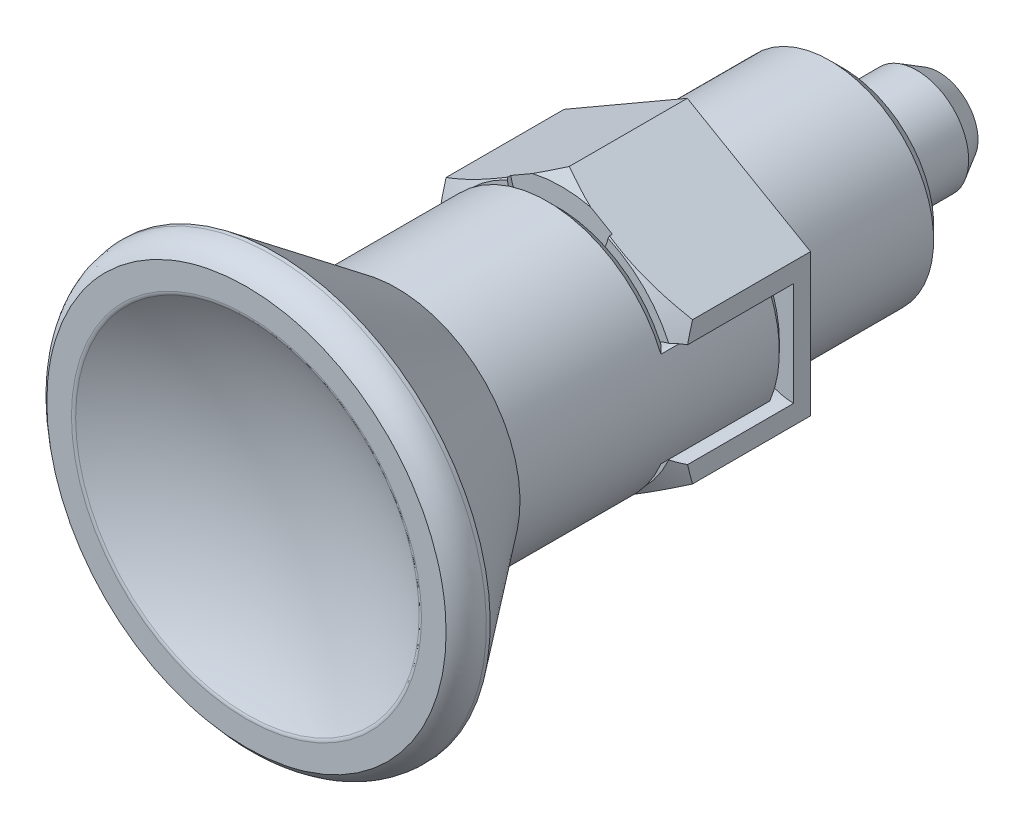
ISO-10303-21;
HEADER;
FILE_DESCRIPTION(('STEP AP214'),'2;1');
FILE_NAME('part.step','',(''),(''),'','','');
FILE_SCHEMA(('AUTOMOTIVE_DESIGN { 1 0 10303 214 1 1 1 1 }'));
ENDSEC;
DATA;
#1=APPLICATION_CONTEXT('core data for automotive mechanical design processes');
#2=APPLICATION_PROTOCOL_DEFINITION('international standard','automotive_design',2000,#1);
#3=PRODUCT_CONTEXT('',#1,'mechanical');
#4=PRODUCT('Part','Part','',(#3));
#5=PRODUCT_RELATED_PRODUCT_CATEGORY('part','',(#4));
#6=PRODUCT_DEFINITION_FORMATION('','',#4);
#7=PRODUCT_DEFINITION_CONTEXT('part definition',#1,'design');
#8=PRODUCT_DEFINITION('design','',#6,#7);
#9=PRODUCT_DEFINITION_SHAPE('','',#8);
#10=(LENGTH_UNIT() NAMED_UNIT(*) SI_UNIT(.MILLI.,.METRE.));
#11=(NAMED_UNIT(*) PLANE_ANGLE_UNIT() SI_UNIT($,.RADIAN.));
#12=(NAMED_UNIT(*) SI_UNIT($,.STERADIAN.) SOLID_ANGLE_UNIT());
#13=UNCERTAINTY_MEASURE_WITH_UNIT(LENGTH_MEASURE(1.E-05),#10,'distance_accuracy_value','');
#14=(GEOMETRIC_REPRESENTATION_CONTEXT(3) GLOBAL_UNCERTAINTY_ASSIGNED_CONTEXT((#13)) GLOBAL_UNIT_ASSIGNED_CONTEXT((#10,
#11,#12)) REPRESENTATION_CONTEXT('',''));
#15=CARTESIAN_POINT('',(0.,0.,0.));
#16=DIRECTION('',(0.,0.,1.));
#17=DIRECTION('',(1.,0.,0.));
#18=AXIS2_PLACEMENT_3D('',#15,#16,#17);
#19=CARTESIAN_POINT('',(3.16809484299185,7.65702656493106,-12.));
#20=DIRECTION('',(0.,0.,-1.));
#21=DIRECTION('',(0.383049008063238,-0.923728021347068,0.));
#22=AXIS2_PLACEMENT_3D('',#19,#20,#21);
#23=PLANE('',#22);
#24=CARTESIAN_POINT('',(0.,0.,-12.));
#25=DIRECTION('',(0.,0.,-1.));
#26=DIRECTION('',(0.383049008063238,-0.923728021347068,0.));
#27=AXIS2_PLACEMENT_3D('',#24,#25,#26);
#28=CIRCLE('',#27,4.1);
#29=CARTESIAN_POINT('',(1.57050093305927,-3.78728488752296,-12.));
#30=VERTEX_POINT('',#29);
#31=EDGE_CURVE('E9',#30,#30,#28,.T.);
#32=ORIENTED_EDGE('',*,*,#31,.F.);
#33=EDGE_LOOP('',(#32));
#34=FACE_BOUND('',#33,.T.);
#35=CARTESIAN_POINT('',(0.,0.,-12.));
#36=DIRECTION('',(0.,0.,-1.));
#37=DIRECTION('',(-1.,0.,0.));
#38=AXIS2_PLACEMENT_3D('',#35,#36,#37);
#39=CIRCLE('',#38,7.);
#40=CARTESIAN_POINT('',(-7.,0.,-12.));
#41=VERTEX_POINT('',#40);
#42=EDGE_CURVE('E787',#41,#41,#39,.T.);
#43=ORIENTED_EDGE('',*,*,#42,.T.);
#44=EDGE_LOOP('',(#43));
#45=FACE_BOUND('',#44,.T.);
#46=ADVANCED_FACE('F15',(#34,#45),#23,.T.);
#47=CARTESIAN_POINT('',(0.,0.,-11.9999999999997));
#48=DIRECTION('',(0.,0.,-1.));
#49=DIRECTION('',(0.383049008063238,-0.923728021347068,0.));
#50=AXIS2_PLACEMENT_3D('',#47,#48,#49);
#51=SPHERICAL_SURFACE('',#50,8.0000000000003);
#52=CARTESIAN_POINT('',(0.,0.,-19.4113534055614));
#53=DIRECTION('',(0.,0.,-1.));
#54=DIRECTION('',(0.383049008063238,-0.923728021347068,0.));
#55=AXIS2_PLACEMENT_3D('',#52,#53,#54);
#56=CIRCLE('',#55,3.01194965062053);
#57=CARTESIAN_POINT('',(1.15372432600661,-2.78222229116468,-19.4113534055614));
#58=VERTEX_POINT('',#57);
#59=EDGE_CURVE('E916',#58,#58,#56,.T.);
#60=ORIENTED_EDGE('',*,*,#59,.T.);
#61=EDGE_LOOP('',(#60));
#62=FACE_BOUND('',#61,.T.);
#63=ADVANCED_FACE('F17',(#62),#51,.T.);
#64=CARTESIAN_POINT('',(0.,0.,-19.4113534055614));
#65=DIRECTION('',(0.,0.,1.));
#66=DIRECTION('',(0.383049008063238,-0.923728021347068,0.));
#67=AXIS2_PLACEMENT_3D('',#64,#65,#66);
#68=CONICAL_SURFACE('',#67,3.01194965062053,0.523598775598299);
#69=CARTESIAN_POINT('',(0.,0.,-17.7));
#70=DIRECTION('',(0.,0.,-1.));
#71=DIRECTION('',(0.383049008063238,-0.923728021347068,0.));
#72=AXIS2_PLACEMENT_3D('',#69,#70,#71);
#73=CIRCLE('',#72,4.);
#74=CARTESIAN_POINT('',(1.53219603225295,-3.69491208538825,-17.7));
#75=VERTEX_POINT('',#74);
#76=EDGE_CURVE('E919',#75,#75,#73,.T.);
#77=ORIENTED_EDGE('',*,*,#76,.T.);
#78=EDGE_LOOP('',(#77));
#79=FACE_BOUND('',#78,.T.);
#80=ORIENTED_EDGE('',*,*,#59,.F.);
#81=EDGE_LOOP('',(#80));
#82=FACE_BOUND('',#81,.T.);
#83=ADVANCED_FACE('F906',(#79,#82),#68,.T.);
#84=CARTESIAN_POINT('',(0.,0.,-12.5));
#85=DIRECTION('',(0.,0.,-1.));
#86=DIRECTION('',(0.383049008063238,-0.923728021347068,0.));
#87=AXIS2_PLACEMENT_3D('',#84,#85,#86);
#88=CYLINDRICAL_SURFACE('',#87,4.);
#89=CARTESIAN_POINT('',(0.,0.,-12.5));
#90=DIRECTION('',(0.,0.,-1.));
#91=DIRECTION('',(0.383049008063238,-0.923728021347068,0.));
#92=AXIS2_PLACEMENT_3D('',#89,#90,#91);
#93=CIRCLE('',#92,4.);
#94=CARTESIAN_POINT('',(1.53219603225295,-3.69491208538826,-12.5));
#95=VERTEX_POINT('',#94);
#96=EDGE_CURVE('E925',#95,#95,#93,.T.);
#97=ORIENTED_EDGE('',*,*,#96,.T.);
#98=EDGE_LOOP('',(#97));
#99=FACE_BOUND('',#98,.T.);
#100=ORIENTED_EDGE('',*,*,#76,.F.);
#101=EDGE_LOOP('',(#100));
#102=FACE_BOUND('',#101,.T.);
#103=ADVANCED_FACE('F912',(#99,#102),#88,.T.);
#104=CARTESIAN_POINT('',(0.,0.,-12.3732050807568));
#105=DIRECTION('',(0.,0.,-1.));
#106=DIRECTION('',(0.383049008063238,-0.923728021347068,0.));
#107=AXIS2_PLACEMENT_3D('',#104,#105,#106);
#108=CONICAL_SURFACE('',#107,3.92679491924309,0.523598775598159);
#109=CARTESIAN_POINT('',(0.,0.,-12.3732050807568));
#110=DIRECTION('',(0.,0.,-1.));
#111=DIRECTION('',(0.383049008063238,-0.923728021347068,0.));
#112=AXIS2_PLACEMENT_3D('',#109,#110,#111);
#113=CIRCLE('',#112,3.9267949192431);
#114=CARTESIAN_POINT('',(1.50415489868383,-3.62729050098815,-12.3732050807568));
#115=VERTEX_POINT('',#114);
#116=EDGE_CURVE('E2356',#115,#115,#113,.T.);
#117=ORIENTED_EDGE('',*,*,#116,.T.);
#118=EDGE_LOOP('',(#117));
#119=FACE_BOUND('',#118,.T.);
#120=ORIENTED_EDGE('',*,*,#96,.F.);
#121=EDGE_LOOP('',(#120));
#122=FACE_BOUND('',#121,.T.);
#123=ADVANCED_FACE('F1064',(#119,#122),#108,.T.);
#124=CARTESIAN_POINT('',(1.49389113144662,-3.60253928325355,-12.2732050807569));
#125=CARTESIAN_POINT('',(1.49389113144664,-3.60253928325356,-12.3267949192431));
#126=CARTESIAN_POINT('',(1.50415489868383,-3.62729050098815,-12.3732050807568));
#127=CARTESIAN_POINT('',(-4.74588994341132,-6.19003462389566,-12.2732050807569));
#128=CARTESIAN_POINT('',(-4.74588994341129,-6.19003462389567,-12.3267949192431));
#129=CARTESIAN_POINT('',(-4.77849654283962,-6.23256320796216,-12.3732050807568));
#130=CARTESIAN_POINT('',(-3.8668361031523,0.50752197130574,-12.2732050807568));
#131=CARTESIAN_POINT('',(-3.86683610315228,0.507521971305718,-12.3267949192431));
#132=CARTESIAN_POINT('',(-3.89340317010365,0.511008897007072,-12.3732050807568));
#133=CARTESIAN_POINT('',(-2.98778226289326,7.20507856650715,-12.2732050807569));
#134=CARTESIAN_POINT('',(-2.98778226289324,7.20507856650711,-12.3267949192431));
#135=CARTESIAN_POINT('',(-3.00830979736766,7.2545810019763,-12.3732050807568));
#136=CARTESIAN_POINT('',(2.37294497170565,3.09501731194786,-12.2732050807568));
#137=CARTESIAN_POINT('',(2.37294497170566,3.09501731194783,-12.3267949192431));
#138=CARTESIAN_POINT('',(2.38924827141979,3.11628160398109,-12.3732050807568));
#139=CARTESIAN_POINT('',(7.73367220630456,-1.01504394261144,-12.2732050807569));
#140=CARTESIAN_POINT('',(7.73367220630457,-1.01504394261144,-12.3267949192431));
#141=CARTESIAN_POINT('',(7.78680634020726,-1.02201779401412,-12.3732050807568));
#142=CARTESIAN_POINT('',(1.49389113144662,-3.60253928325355,-12.2732050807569));
#143=CARTESIAN_POINT('',(1.49389113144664,-3.60253928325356,-12.3267949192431));
#144=CARTESIAN_POINT('',(1.50415489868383,-3.62729050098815,-12.3732050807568));
#145=(BOUNDED_SURFACE() B_SPLINE_SURFACE(2,2,((#124,#125,#126),(#127,#128,#129),(#130,#131,
#132),(#133,#134,#135),(#136,#137,#138),(#139,#140,#141),(#142,#143,#144)),.UNSPECIFIED.,.T.,
.F.,.F.) B_SPLINE_SURFACE_WITH_KNOTS((3,2,2,3),(3,3),(0.,126.270240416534,252.540480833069,
378.810721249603),(0.,1.),
.UNSPECIFIED.) GEOMETRIC_REPRESENTATION_ITEM() RATIONAL_B_SPLINE_SURFACE(((1.,0.965925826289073,
1.),(0.5,0.482962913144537,0.5),(1.,0.965925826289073,1.),(0.5,0.482962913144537,0.5),(1.,
0.965925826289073,1.),(0.5,0.482962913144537,0.5),(1.,0.965925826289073,1.))) REPRESENTATION_ITEM('') SURFACE());
#146=CARTESIAN_POINT('',(0.,0.,-12.2732050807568));
#147=DIRECTION('',(0.,0.,-1.));
#148=DIRECTION('',(0.383049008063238,-0.923728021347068,0.));
#149=AXIS2_PLACEMENT_3D('',#146,#147,#148);
#150=CIRCLE('',#149,3.9);
#151=CARTESIAN_POINT('',(1.49389113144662,-3.60253928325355,-12.2732050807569));
#152=VERTEX_POINT('',#151);
#153=EDGE_CURVE('E2352',#152,#152,#150,.T.);
#154=CARTESIAN_POINT('',(1.49389113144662,-3.60253928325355,-12.2732050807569));
#155=CARTESIAN_POINT('',(1.49389113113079,-3.60253928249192,-12.2742846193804));
#156=CARTESIAN_POINT('',(1.49389447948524,-3.60254735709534,-12.2753641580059));
#157=CARTESIAN_POINT('',(1.4939078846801,-3.60257968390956,-12.2775251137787));
#158=CARTESIAN_POINT('',(1.49391795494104,-3.60260396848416,-12.2786065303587));
#159=CARTESIAN_POINT('',(1.49394484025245,-3.60266880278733,-12.2807708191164));
#160=CARTESIAN_POINT('',(1.49396166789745,-3.60270938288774,-12.2818536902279));
#161=CARTESIAN_POINT('',(1.49400209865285,-3.60280688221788,-12.2840204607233));
#162=CARTESIAN_POINT('',(1.49402571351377,-3.60286382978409,-12.285104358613));
#163=CARTESIAN_POINT('',(1.49407974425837,-3.60299412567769,-12.2872727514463));
#164=CARTESIAN_POINT('',(1.49411017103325,-3.60306750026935,-12.2883572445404));
#165=CARTESIAN_POINT('',(1.49417784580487,-3.60323069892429,-12.290526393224));
#166=CARTESIAN_POINT('',(1.49421510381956,-3.60332054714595,-12.2916110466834));
#167=CARTESIAN_POINT('',(1.49429645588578,-3.60351672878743,-12.2937800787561));
#168=CARTESIAN_POINT('',(1.49434055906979,-3.60362308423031,-12.294864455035));
#169=CARTESIAN_POINT('',(1.49443561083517,-3.60385230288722,-12.297032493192));
#170=CARTESIAN_POINT('',(1.49448656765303,-3.60397518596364,-12.2981161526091));
#171=CARTESIAN_POINT('',(1.49459533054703,-3.60423746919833,-12.300282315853));
#172=CARTESIAN_POINT('',(1.49465314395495,-3.60437688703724,-12.301364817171));
#173=CARTESIAN_POINT('',(1.49477561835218,-3.60467223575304,-12.3035282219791));
#174=CARTESIAN_POINT('',(1.49484028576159,-3.60482818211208,-12.3046091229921));
#175=CARTESIAN_POINT('',(1.49497646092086,-3.60515657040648,-12.3067688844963));
#176=CARTESIAN_POINT('',(1.49504797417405,-3.60532902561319,-12.3078477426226));
#177=CARTESIAN_POINT('',(1.4951978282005,-3.60569040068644,-12.3100029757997));
#178=CARTESIAN_POINT('',(1.49527617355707,-3.60587933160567,-12.3110793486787));
#179=CARTESIAN_POINT('',(1.49543967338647,-3.6062736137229,-12.3132291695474));
#180=CARTESIAN_POINT('',(1.49552483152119,-3.60647897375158,-12.3143026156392));
#181=CARTESIAN_POINT('',(1.49570193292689,-3.60690605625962,-12.3164461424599));
#182=CARTESIAN_POINT('',(1.49579387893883,-3.60712778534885,-12.3175162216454));
#183=CARTESIAN_POINT('',(1.49598452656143,-3.60758753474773,-12.3196525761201));
#184=CARTESIAN_POINT('',(1.49608322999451,-3.60782555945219,-12.3207188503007));
#185=CARTESIAN_POINT('',(1.49628735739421,-3.60831781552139,-12.322847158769));
#186=CARTESIAN_POINT('',(1.49639278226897,-3.60857204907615,-12.323909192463));
#187=CARTESIAN_POINT('',(1.4966103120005,-3.60909662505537,-12.3260285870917));
#188=CARTESIAN_POINT('',(1.49672241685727,-3.60936696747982,-12.3270859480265));
#189=CARTESIAN_POINT('',(1.49695326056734,-3.60992365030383,-12.3291955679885));
#190=CARTESIAN_POINT('',(1.49707199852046,-3.61020998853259,-12.330247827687));
#191=CARTESIAN_POINT('',(1.49731605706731,-3.61079853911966,-12.3323468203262));
#192=CARTESIAN_POINT('',(1.49744137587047,-3.61110074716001,-12.3333935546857));
#193=CARTESIAN_POINT('',(1.49769853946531,-3.61172090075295,-12.3354810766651));
#194=CARTESIAN_POINT('',(1.49783038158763,-3.61203883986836,-12.3365218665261));
#195=CARTESIAN_POINT('',(1.4981005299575,-3.61269030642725,-12.3385970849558));
#196=CARTESIAN_POINT('',(1.49823883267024,-3.6130238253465,-12.3396315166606));
#197=CARTESIAN_POINT('',(1.4985218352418,-3.6137062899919,-12.3416936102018));
#198=CARTESIAN_POINT('',(1.49866653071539,-3.61405522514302,-12.34272127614));
#199=CARTESIAN_POINT('',(1.498962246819,-3.61476834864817,-12.3447694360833));
#200=CARTESIAN_POINT('',(1.49911326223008,-3.61513252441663,-12.3457899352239));
#201=CARTESIAN_POINT('',(1.49942154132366,-3.61587594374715,-12.347823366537));
#202=CARTESIAN_POINT('',(1.49957879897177,-3.6162551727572,-12.3488363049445));
#203=CARTESIAN_POINT('',(1.49989948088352,-3.6170285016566,-12.3508542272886));
#204=CARTESIAN_POINT('',(1.50006289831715,-3.61742258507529,-12.3518592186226));
#205=CARTESIAN_POINT('',(1.50039581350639,-3.61822541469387,-12.3538608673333));
#206=CARTESIAN_POINT('',(1.50056530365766,-3.61863414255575,-12.35485753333));
#207=CARTESIAN_POINT('',(1.50091027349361,-3.61946604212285,-12.3568421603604));
#208=CARTESIAN_POINT('',(1.50108574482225,-3.61988919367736,-12.3578301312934));
#209=CARTESIAN_POINT('',(1.50144258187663,-3.62074971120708,-12.3597970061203));
#210=CARTESIAN_POINT('',(1.5016239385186,-3.62118705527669,-12.3607759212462));
#211=CARTESIAN_POINT('',(1.50199244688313,-3.62207571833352,-12.3627243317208));
#212=CARTESIAN_POINT('',(1.50217958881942,-3.622527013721,-12.3636938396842));
#213=CARTESIAN_POINT('',(1.50255956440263,-3.62344333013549,-12.3656230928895));
#214=CARTESIAN_POINT('',(1.50275238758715,-3.62390832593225,-12.3665828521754));
#215=CARTESIAN_POINT('',(1.50314361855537,-3.62485178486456,-12.3684922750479));
#216=CARTESIAN_POINT('',(1.50334201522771,-3.62533022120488,-12.369441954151));
#217=CARTESIAN_POINT('',(1.50374428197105,-3.62630029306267,-12.3713308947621));
#218=CARTESIAN_POINT('',(1.50394814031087,-3.62679190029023,-12.3722701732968));
#219=CARTESIAN_POINT('',(1.50415489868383,-3.62729050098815,-12.3732050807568));
#220=B_SPLINE_CURVE_WITH_KNOTS('',3,(#154,#155,#156,#157,#158,#159,#160,#161,#162,#163,#164,
#165,#166,#167,#168,#169,#170,#171,#172,#173,#174,#175,#176,#177,#178,#179,#180,#181,#182,#183,
#184,#185,#186,#187,#188,#189,#190,#191,#192,#193,#194,#195,#196,#197,#198,#199,#200,#201,#202,
#203,#204,#205,#206,#207,#208,#209,#210,#211,#212,#213,#214,#215,#216,#217,#218,#219),
.UNSPECIFIED.,.F.,.F.,(4,2,2,2,2,2,2,2,2,2,2,2,2,2,2,2,2,2,2,2,2,2,2,2,2,2,2,2,2,2,2,2,4),(0.,
0.00323858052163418,0.00648364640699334,0.00973478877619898,0.0129915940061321,
0.0162536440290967,0.0195205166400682,0.0227917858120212,0.0260670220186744,0.0293457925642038,
0.0326276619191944,0.035912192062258,0.0391989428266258,0.0424874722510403,0.0457773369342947,
0.0490680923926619,0.0523592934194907,0.0556504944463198,0.0589412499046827,0.0622311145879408,
0.0655196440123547,0.0688063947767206,0.0720909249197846,0.075372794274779,0.0786515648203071,
0.0819268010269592,0.0851980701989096,0.088464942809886,0.0917269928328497,0.0949837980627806,
0.0982349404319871,0.101480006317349,0.104718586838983),.UNSPECIFIED.);
#221=EDGE_CURVE('BSEAM1076',#152,#115,#220,.T.);
#222=ORIENTED_EDGE('',*,*,#153,.T.);
#223=ORIENTED_EDGE('',*,*,#116,.F.);
#224=ORIENTED_EDGE('',*,*,#221,.T.);
#225=ORIENTED_EDGE('',*,*,#221,.F.);
#226=EDGE_LOOP('',(#222,#224,#223,#225));
#227=FACE_BOUND('',#226,.T.);
#228=ADVANCED_FACE('F1076',(#227),#145,.T.);
#229=CARTESIAN_POINT('',(0.,0.,-12.2));
#230=DIRECTION('',(0.,0.,-1.));
#231=DIRECTION('',(0.383049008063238,-0.923728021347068,0.));
#232=AXIS2_PLACEMENT_3D('',#229,#230,#231);
#233=CYLINDRICAL_SURFACE('',#232,3.9);
#234=CARTESIAN_POINT('',(0.,0.,-12.2));
#235=DIRECTION('',(0.,0.,-1.));
#236=DIRECTION('',(0.383049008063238,-0.923728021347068,0.));
#237=AXIS2_PLACEMENT_3D('',#234,#235,#236);
#238=CIRCLE('',#237,3.9);
#239=CARTESIAN_POINT('',(1.49389113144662,-3.60253928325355,-12.2));
#240=VERTEX_POINT('',#239);
#241=EDGE_CURVE('E27',#240,#240,#238,.T.);
#242=ORIENTED_EDGE('',*,*,#241,.T.);
#243=EDGE_LOOP('',(#242));
#244=FACE_BOUND('',#243,.T.);
#245=ORIENTED_EDGE('',*,*,#153,.F.);
#246=EDGE_LOOP('',(#245));
#247=FACE_BOUND('',#246,.T.);
#248=ADVANCED_FACE('F1088',(#244,#247),#233,.T.);
#249=CARTESIAN_POINT('',(1.57050093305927,-3.78728488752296,-12.));
#250=CARTESIAN_POINT('',(1.49389113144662,-3.60253928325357,-12.));
#251=CARTESIAN_POINT('',(1.49389113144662,-3.60253928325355,-12.2));
#252=CARTESIAN_POINT('',(-4.98926891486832,-6.50747229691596,-12.));
#253=CARTESIAN_POINT('',(-4.74588994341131,-6.19003462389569,-12.));
#254=CARTESIAN_POINT('',(-4.74588994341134,-6.19003462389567,-12.2));
#255=CARTESIAN_POINT('',(-4.06513539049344,0.53354873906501,-12.));
#256=CARTESIAN_POINT('',(-3.86683610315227,0.507521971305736,-12.));
#257=CARTESIAN_POINT('',(-3.8668361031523,0.50752197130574,-12.2));
#258=CARTESIAN_POINT('',(-3.14100186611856,7.57456977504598,-12.));
#259=CARTESIAN_POINT('',(-2.98778226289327,7.20507856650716,-12.));
#260=CARTESIAN_POINT('',(-2.98778226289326,7.20507856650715,-12.2));
#261=CARTESIAN_POINT('',(2.49463445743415,3.253736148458,-12.));
#262=CARTESIAN_POINT('',(2.37294497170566,3.09501731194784,-12.));
#263=CARTESIAN_POINT('',(2.37294497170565,3.09501731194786,-12.2));
#264=CARTESIAN_POINT('',(8.13027078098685,-1.06709747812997,-12.));
#265=CARTESIAN_POINT('',(7.73367220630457,-1.01504394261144,-12.));
#266=CARTESIAN_POINT('',(7.73367220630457,-1.01504394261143,-12.2));
#267=CARTESIAN_POINT('',(1.57050093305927,-3.78728488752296,-12.));
#268=CARTESIAN_POINT('',(1.49389113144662,-3.60253928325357,-12.));
#269=CARTESIAN_POINT('',(1.49389113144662,-3.60253928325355,-12.2));
#270=(BOUNDED_SURFACE() B_SPLINE_SURFACE(2,2,((#249,#250,#251),(#252,#253,#254),(#255,#256,
#257),(#258,#259,#260),(#261,#262,#263),(#264,#265,#266),(#267,#268,#269)),.UNSPECIFIED.,.T.,
.F.,.F.) B_SPLINE_SURFACE_WITH_KNOTS((3,2,2,3),(3,3),(0.,34.2822966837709,68.5645933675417,
102.846890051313),(0.,1.),
.UNSPECIFIED.) GEOMETRIC_REPRESENTATION_ITEM() RATIONAL_B_SPLINE_SURFACE(((1.,0.707106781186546,
1.),(0.5,0.353553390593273,0.5),(1.,0.707106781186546,1.),(0.5,0.353553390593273,0.5),(1.,
0.707106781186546,1.),(0.5,0.353553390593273,0.5),(1.,0.707106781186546,1.))) REPRESENTATION_ITEM('') SURFACE());
#271=CARTESIAN_POINT('',(1.57050093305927,-3.78728488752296,-12.));
#272=CARTESIAN_POINT('',(1.56993407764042,-3.78591790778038,-11.9999999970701));
#273=CARTESIAN_POINT('',(1.56936722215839,-3.78455092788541,-12.000016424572));
#274=CARTESIAN_POINT('',(1.56822869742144,-3.78180535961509,-12.0000824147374));
#275=CARTESIAN_POINT('',(1.56765703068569,-3.78042677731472,-12.0001322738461));
#276=CARTESIAN_POINT('',(1.56650925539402,-3.77765890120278,-12.0002659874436));
#277=CARTESIAN_POINT('',(1.56593315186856,-3.77626961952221,-12.0003501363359));
#278=CARTESIAN_POINT('',(1.56477689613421,-3.77348129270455,-12.0005532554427));
#279=CARTESIAN_POINT('',(1.56419675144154,-3.77208226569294,-12.0006725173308));
#280=CARTESIAN_POINT('',(1.56303282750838,-3.76927544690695,-12.0009466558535));
#281=CARTESIAN_POINT('',(1.56244905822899,-3.76786767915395,-12.0011018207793));
#282=CARTESIAN_POINT('',(1.56127831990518,-3.76504442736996,-12.0014485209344));
#283=CARTESIAN_POINT('',(1.56069136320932,-3.76362897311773,-12.0016403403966));
#284=CARTESIAN_POINT('',(1.55951470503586,-3.7607914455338,-12.0020610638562));
#285=CARTESIAN_POINT('',(1.55892501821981,-3.75936940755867,-12.0022902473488));
#286=CARTESIAN_POINT('',(1.55774337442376,-3.75651985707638,-12.0027863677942));
#287=CARTESIAN_POINT('',(1.55715143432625,-3.75509238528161,-12.0030535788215));
#288=CARTESIAN_POINT('',(1.55596577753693,-3.75223315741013,-12.0036263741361));
#289=CARTESIAN_POINT('',(1.55537207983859,-3.75080144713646,-12.003932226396));
#290=CARTESIAN_POINT('',(1.55418341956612,-3.74793497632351,-12.0045828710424));
#291=CARTESIAN_POINT('',(1.55358847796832,-3.74650026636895,-12.004927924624));
#292=CARTESIAN_POINT('',(1.55239785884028,-3.74362907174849,-12.0056574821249));
#293=CARTESIAN_POINT('',(1.55180220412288,-3.74219264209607,-12.006042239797));
#294=CARTESIAN_POINT('',(1.55061070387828,-3.73931932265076,-12.0068516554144));
#295=CARTESIAN_POINT('',(1.55001488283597,-3.7378824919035,-12.0072765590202));
#296=CARTESIAN_POINT('',(1.5488236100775,-3.73500972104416,-12.0081666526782));
#297=CARTESIAN_POINT('',(1.54822818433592,-3.73357384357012,-12.0086320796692));
#298=CARTESIAN_POINT('',(1.54703827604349,-3.73070436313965,-12.0096035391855));
#299=CARTESIAN_POINT('',(1.54644382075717,-3.72927082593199,-12.0101097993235));
#300=CARTESIAN_POINT('',(1.54525643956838,-3.72640743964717,-12.011163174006));
#301=CARTESIAN_POINT('',(1.54466354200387,-3.72497765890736,-12.0117105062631));
#302=CARTESIAN_POINT('',(1.54347987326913,-3.72212322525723,-12.0128462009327));
#303=CARTESIAN_POINT('',(1.54288913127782,-3.72069864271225,-12.0134347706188));
#304=CARTESIAN_POINT('',(1.54171037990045,-3.71785606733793,-12.0146530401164));
#305=CARTESIAN_POINT('',(1.54112240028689,-3.71643814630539,-12.0152829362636));
#306=CARTESIAN_POINT('',(1.53994978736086,-3.71361037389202,-12.0165838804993));
#307=CARTESIAN_POINT('',(1.53936518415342,-3.71220059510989,-12.017255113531));
#308=CARTESIAN_POINT('',(1.53819994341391,-3.70939060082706,-12.0186386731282));
#309=CARTESIAN_POINT('',(1.53761933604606,-3.70799045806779,-12.0193511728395));
#310=CARTESIAN_POINT('',(1.53646271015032,-3.70520123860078,-12.0208171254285));
#311=CARTESIAN_POINT('',(1.53588672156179,-3.70381223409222,-12.0215707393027));
#312=CARTESIAN_POINT('',(1.53473995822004,-3.70104679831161,-12.0231186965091));
#313=CARTESIAN_POINT('',(1.53416921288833,-3.69967043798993,-12.0239131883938));
#314=CARTESIAN_POINT('',(1.53303356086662,-3.69693179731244,-12.0255425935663));
#315=CARTESIAN_POINT('',(1.53246868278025,-3.69556958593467,-12.0263776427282));
#316=CARTESIAN_POINT('',(1.5313453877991,-3.69286074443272,-12.0280877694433));
#317=CARTESIAN_POINT('',(1.53078699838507,-3.69151418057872,-12.0289629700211));
#318=CARTESIAN_POINT('',(1.52967729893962,-3.68883812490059,-12.0307529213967));
#319=CARTESIAN_POINT('',(1.52912601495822,-3.68750869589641,-12.0316677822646));
#320=CARTESIAN_POINT('',(1.52803113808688,-3.68486838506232,-12.0335364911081));
#321=CARTESIAN_POINT('',(1.5274875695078,-3.68355756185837,-12.0344904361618));
#322=CARTESIAN_POINT('',(1.52640872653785,-3.68095591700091,-12.0364366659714));
#323=CARTESIAN_POINT('',(1.525873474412,-3.67966514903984,-12.0374290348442));
#324=CARTESIAN_POINT('',(1.5248118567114,-3.67710504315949,-12.039451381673));
#325=CARTESIAN_POINT('',(1.52428551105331,-3.67583575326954,-12.0404814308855));
#326=CARTESIAN_POINT('',(1.52324228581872,-3.67332000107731,-12.0425783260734));
#327=CARTESIAN_POINT('',(1.52272542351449,-3.67207358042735,-12.0436452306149));
#328=CARTESIAN_POINT('',(1.52170172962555,-3.66960492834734,-12.045814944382));
#329=CARTESIAN_POINT('',(1.52119491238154,-3.66838273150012,-12.0469177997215));
#330=CARTESIAN_POINT('',(1.52019185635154,-3.66596384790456,-12.04915844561));
#331=CARTESIAN_POINT('',(1.51969562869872,-3.66476718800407,-12.0502962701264));
#332=CARTESIAN_POINT('',(1.51871428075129,-3.66240065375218,-12.05260581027));
#333=CARTESIAN_POINT('',(1.51822916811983,-3.66123079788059,-12.0537775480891));
#334=CARTESIAN_POINT('',(1.51727055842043,-3.65891909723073,-12.0561537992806));
#335=CARTESIAN_POINT('',(1.51679706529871,-3.65777726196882,-12.0573583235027));
#336=CARTESIAN_POINT('',(1.51586218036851,-3.65552277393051,-12.0597989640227));
#337=CARTESIAN_POINT('',(1.51540078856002,-3.65441012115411,-12.0610350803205));
#338=CARTESIAN_POINT('',(1.51449056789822,-3.65221511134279,-12.0635376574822));
#339=CARTESIAN_POINT('',(1.5140417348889,-3.65113274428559,-12.064804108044));
#340=CARTESIAN_POINT('',(1.51315706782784,-3.6489993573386,-12.0673660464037));
#341=CARTESIAN_POINT('',(1.51272122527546,-3.64794831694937,-12.068661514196));
#342=CARTESIAN_POINT('',(1.51186294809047,-3.6458785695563,-12.071280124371));
#343=CARTESIAN_POINT('',(1.51144050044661,-3.64485983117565,-12.0726032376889));
#344=CARTESIAN_POINT('',(1.51060939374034,-3.64285560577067,-12.0752757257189));
#345=CARTESIAN_POINT('',(1.51020071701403,-3.64187007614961,-12.0766250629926));
#346=CARTESIAN_POINT('',(1.50939750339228,-3.63993311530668,-12.0793485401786));
#347=CARTESIAN_POINT('',(1.5090029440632,-3.63898162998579,-12.0807226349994));
#348=CARTESIAN_POINT('',(1.50822828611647,-3.63711353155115,-12.0834941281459));
#349=CARTESIAN_POINT('',(1.50784816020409,-3.63619685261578,-12.0848914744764));
#350=CARTESIAN_POINT('',(1.50710265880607,-3.6343990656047,-12.0877079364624));
#351=CARTESIAN_POINT('',(1.50673725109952,-3.63351787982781,-12.0891269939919));
#352=CARTESIAN_POINT('',(1.50602144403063,-3.63179170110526,-12.0919853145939));
#353=CARTESIAN_POINT('',(1.50567100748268,-3.63094661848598,-12.0934245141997));
#354=CARTESIAN_POINT('',(1.50498536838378,-3.6292931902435,-12.0963215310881));
#355=CARTESIAN_POINT('',(1.50465012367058,-3.62848474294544,-12.0977792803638));
#356=CARTESIAN_POINT('',(1.5039950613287,-3.62690505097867,-12.1007117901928));
#357=CARTESIAN_POINT('',(1.50367519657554,-3.62613369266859,-12.1021864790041));
#358=CARTESIAN_POINT('',(1.50305105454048,-3.62462856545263,-12.1051512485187));
#359=CARTESIAN_POINT('',(1.50274672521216,-3.62389467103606,-12.1066412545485));
#360=CARTESIAN_POINT('',(1.50215378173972,-3.62246477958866,-12.1096350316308));
#361=CARTESIAN_POINT('',(1.50186511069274,-3.62176864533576,-12.1111387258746));
#362=CARTESIAN_POINT('',(1.50130357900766,-3.62041450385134,-12.1141582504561));
#363=CARTESIAN_POINT('',(1.5010306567,-3.61975634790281,-12.115674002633));
#364=CARTESIAN_POINT('',(1.5005006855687,-3.61847831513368,-12.1187160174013));
#365=CARTESIAN_POINT('',(1.50024357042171,-3.61785827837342,-12.120242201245));
#366=CARTESIAN_POINT('',(1.4997452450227,-3.61665655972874,-12.1233034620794));
#367=CARTESIAN_POINT('',(1.49950396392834,-3.61607470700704,-12.1248384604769));
#368=CARTESIAN_POINT('',(1.49903730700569,-3.61494935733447,-12.1279157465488));
#369=CARTESIAN_POINT('',(1.49881185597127,-3.61440567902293,-12.1294579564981));
#370=CARTESIAN_POINT('',(1.49837682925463,-3.61335660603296,-12.1325480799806));
#371=CARTESIAN_POINT('',(1.49816717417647,-3.6128510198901,-12.1340959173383));
#372=CARTESIAN_POINT('',(1.49776368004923,-3.61187798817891,-12.1371957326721));
#373=CARTESIAN_POINT('',(1.49756975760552,-3.61141034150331,-12.1387476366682));
#374=CARTESIAN_POINT('',(1.49719764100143,-3.6105129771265,-12.1418540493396));
#375=CARTESIAN_POINT('',(1.4970193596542,-3.610083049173,-12.1434084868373));
#376=CARTESIAN_POINT('',(1.49667841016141,-3.60926084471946,-12.1465184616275));
#377=CARTESIAN_POINT('',(1.49651565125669,-3.60886834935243,-12.1480739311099));
#378=CARTESIAN_POINT('',(1.49620560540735,-3.60812066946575,-12.1511844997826));
#379=CARTESIAN_POINT('',(1.49605822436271,-3.60776525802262,-12.1527395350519));
#380=CARTESIAN_POINT('',(1.49577876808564,-3.60709134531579,-12.1558478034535));
#381=CARTESIAN_POINT('',(1.49564659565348,-3.60677260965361,-12.1574009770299));
#382=CARTESIAN_POINT('',(1.4953973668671,-3.60617159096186,-12.1605041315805));
#383=CARTESIAN_POINT('',(1.49528021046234,-3.60588906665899,-12.1620540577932));
#384=CARTESIAN_POINT('',(1.49506080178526,-3.6053599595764,-12.1651493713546));
#385=CARTESIAN_POINT('',(1.4949584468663,-3.60511312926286,-12.1666947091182));
#386=CARTESIAN_POINT('',(1.49476840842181,-3.60465484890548,-12.1697795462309));
#387=CARTESIAN_POINT('',(1.49468061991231,-3.60444314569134,-12.1713190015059));
#388=CARTESIAN_POINT('',(1.49451946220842,-3.60405451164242,-12.1743908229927));
#389=CARTESIAN_POINT('',(1.49444598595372,-3.60387732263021,-12.1759231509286));
#390=CARTESIAN_POINT('',(1.49431318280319,-3.60355706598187,-12.1789795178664));
#391=CARTESIAN_POINT('',(1.4942537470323,-3.60341373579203,-12.1805035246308));
#392=CARTESIAN_POINT('',(1.49414873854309,-3.60316050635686,-12.1835421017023));
#393=CARTESIAN_POINT('',(1.49410305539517,-3.60305034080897,-12.1850566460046));
#394=CARTESIAN_POINT('',(1.49402525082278,-3.60286271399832,-12.1880752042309));
#395=CARTESIAN_POINT('',(1.49399301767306,-3.60278498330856,-12.1895791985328));
#396=CARTESIAN_POINT('',(1.49394179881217,-3.6026614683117,-12.1925756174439));
#397=CARTESIAN_POINT('',(1.49392270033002,-3.60261541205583,-12.1940680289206));
#398=CARTESIAN_POINT('',(1.49389742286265,-3.60255445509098,-12.1970402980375));
#399=CARTESIAN_POINT('',(1.49389113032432,-3.60253928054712,-12.1985201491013));
#400=CARTESIAN_POINT('',(1.49389113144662,-3.60253928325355,-12.2));
#401=B_SPLINE_CURVE_WITH_KNOTS('',3,(#271,#272,#273,#274,#275,#276,#277,#278,#279,#280,#281,
#282,#283,#284,#285,#286,#287,#288,#289,#290,#291,#292,#293,#294,#295,#296,#297,#298,#299,#300,
#301,#302,#303,#304,#305,#306,#307,#308,#309,#310,#311,#312,#313,#314,#315,#316,#317,#318,#319,
#320,#321,#322,#323,#324,#325,#326,#327,#328,#329,#330,#331,#332,#333,#334,#335,#336,#337,#338,
#339,#340,#341,#342,#343,#344,#345,#346,#347,#348,#349,#350,#351,#352,#353,#354,#355,#356,#357,
#358,#359,#360,#361,#362,#363,#364,#365,#366,#367,#368,#369,#370,#371,#372,#373,#374,#375,#376,
#377,#378,#379,#380,#381,#382,#383,#384,#385,#386,#387,#388,#389,#390,#391,#392,#393,#394,#395,
#396,#397,#398,#399,#400),.UNSPECIFIED.,.F.,.F.,(4,2,2,2,2,2,2,2,2,2,2,2,2,2,2,2,2,2,2,2,2,2,2,
2,2,2,2,2,2,2,2,2,2,2,2,2,2,2,2,2,2,2,2,2,2,2,2,2,2,2,2,2,2,2,2,2,2,2,2,2,2,2,2,2,4),(0.,
0.00443946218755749,0.00891881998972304,0.0134374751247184,0.0179947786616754,
0.0225900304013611,0.027222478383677,0.0318913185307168,0.036595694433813,0.0413346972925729,
0.0461073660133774,0.050912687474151,0.0557495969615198,0.0606169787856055,0.065513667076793,
0.0704384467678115,0.0753900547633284,0.0803671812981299,0.0853684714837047,0.0903925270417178,
0.0954379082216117,0.100503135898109,0.105586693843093,0.11068703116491,0.115802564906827,
0.120931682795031,0.126072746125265,0.131224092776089,0.136384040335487,0.141550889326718,
0.146722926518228,0.151898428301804,0.157075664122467,0.162252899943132,0.167428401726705,
0.172600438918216,0.177767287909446,0.182927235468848,0.188078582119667,0.193219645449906,
0.198348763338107,0.203464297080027,0.208564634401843,0.213648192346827,0.218713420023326,
0.223758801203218,0.228782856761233,0.233784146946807,0.238761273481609,0.243712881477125,
0.248637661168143,0.253534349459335,0.258401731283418,0.26323864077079,0.268043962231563,
0.272816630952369,0.277555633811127,0.282260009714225,0.286928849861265,0.291561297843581,
0.296156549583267,0.300713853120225,0.305232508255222,0.309711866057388,0.314151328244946),.UNSPECIFIED.);
#402=EDGE_CURVE('BSEAM904',#30,#240,#401,.T.);
#403=ORIENTED_EDGE('',*,*,#31,.T.);
#404=ORIENTED_EDGE('',*,*,#241,.F.);
#405=ORIENTED_EDGE('',*,*,#402,.T.);
#406=ORIENTED_EDGE('',*,*,#402,.F.);
#407=EDGE_LOOP('',(#403,#405,#404,#406));
#408=FACE_BOUND('',#407,.T.);
#409=ADVANCED_FACE('F904',(#408),#270,.T.);
#410=CARTESIAN_POINT('',(0.,7.25114412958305E-13,56.303508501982));
#411=DIRECTION('',(0.,0.,-1.));
#412=DIRECTION('',(0.,-1.,0.));
#413=AXIS2_PLACEMENT_3D('',#410,#411,#412);
#414=SPHERICAL_SURFACE('',#413,25.9999999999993);
#415=CARTESIAN_POINT('',(0.,0.,33.9302548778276));
#416=DIRECTION('',(0.,0.,1.));
#417=DIRECTION('',(0.,-1.,0.));
#418=AXIS2_PLACEMENT_3D('',#415,#416,#417);
#419=CIRCLE('',#418,13.2452830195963);
#420=CARTESIAN_POINT('',(0.,-13.2452830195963,33.9302548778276));
#421=VERTEX_POINT('',#420);
#422=EDGE_CURVE('E325',#421,#421,#419,.T.);
#423=ORIENTED_EDGE('',*,*,#422,.T.);
#424=EDGE_LOOP('',(#423));
#425=FACE_BOUND('',#424,.T.);
#426=ADVANCED_FACE('F1110',(#425),#414,.F.);
#427=CARTESIAN_POINT('',(0.,-13.2452830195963,33.9302548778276));
#428=CARTESIAN_POINT('',(0.,-13.3630929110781,34.0000000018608));
#429=CARTESIAN_POINT('',(0.,-13.5000000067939,34.));
#430=CARTESIAN_POINT('',(-22.9415031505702,-13.2452830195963,33.9302548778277));
#431=CARTESIAN_POINT('',(-23.1455558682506,-13.3630929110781,34.0000000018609));
#432=CARTESIAN_POINT('',(-23.3826859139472,-13.5000000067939,34.));
#433=CARTESIAN_POINT('',(-11.4707515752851,6.62264150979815,33.9302548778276));
#434=CARTESIAN_POINT('',(-11.5727779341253,6.68154645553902,34.0000000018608));
#435=CARTESIAN_POINT('',(-11.6913429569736,6.7500000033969,34.));
#436=CARTESIAN_POINT('',(0.,26.4905660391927,33.9302548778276));
#437=CARTESIAN_POINT('',(0.,26.7261858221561,34.0000000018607));
#438=CARTESIAN_POINT('',(0.,27.0000000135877,34.));
#439=CARTESIAN_POINT('',(11.4707515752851,6.62264150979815,33.9302548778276));
#440=CARTESIAN_POINT('',(11.5727779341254,6.68154645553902,34.0000000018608));
#441=CARTESIAN_POINT('',(11.6913429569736,6.75000000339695,34.));
#442=CARTESIAN_POINT('',(22.9415031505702,-13.2452830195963,33.9302548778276));
#443=CARTESIAN_POINT('',(23.1455558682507,-13.3630929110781,34.0000000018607));
#444=CARTESIAN_POINT('',(23.3826859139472,-13.5000000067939,34.));
#445=CARTESIAN_POINT('',(0.,-13.2452830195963,33.9302548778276));
#446=CARTESIAN_POINT('',(0.,-13.3630929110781,34.0000000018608));
#447=CARTESIAN_POINT('',(0.,-13.5000000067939,34.));
#448=(BOUNDED_SURFACE() B_SPLINE_SURFACE(2,2,((#427,#428,#429),(#430,#431,#432),(#433,#434,
#435),(#436,#437,#438),(#439,#440,#441),(#442,#443,#444),(#445,#446,#447)),.UNSPECIFIED.,.T.,
.F.,.F.) B_SPLINE_SURFACE_WITH_KNOTS((3,2,2,3),(3,3),(0.,169.121801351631,338.243602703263,
507.365404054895),(0.,1.),
.UNSPECIFIED.) GEOMETRIC_REPRESENTATION_ITEM() RATIONAL_B_SPLINE_SURFACE(((1.,0.964497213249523,
1.),(0.5,0.482248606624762,0.5),(1.,0.964497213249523,1.),(0.5,0.482248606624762,0.5),(1.,
0.964497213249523,1.),(0.5,0.482248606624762,0.5),(1.,0.964497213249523,1.))) REPRESENTATION_ITEM('') SURFACE());
#449=CARTESIAN_POINT('',(0.,0.,34.));
#450=DIRECTION('',(0.,0.,1.));
#451=DIRECTION('',(0.,-1.,0.));
#452=AXIS2_PLACEMENT_3D('',#449,#450,#451);
#453=CIRCLE('',#452,13.5000000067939);
#454=CARTESIAN_POINT('',(0.,-13.5000000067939,34.));
#455=VERTEX_POINT('',#454);
#456=EDGE_CURVE('E505',#455,#455,#453,.T.);
#457=CARTESIAN_POINT('',(0.,-13.2452830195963,33.9302548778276));
#458=CARTESIAN_POINT('',(0.,-13.2476528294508,33.9316578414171));
#459=CARTESIAN_POINT('',(0.,-13.2500342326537,33.9330412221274));
#460=CARTESIAN_POINT('',(0.,-13.2548245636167,33.9357712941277));
#461=CARTESIAN_POINT('',(0.,-13.257233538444,33.937117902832));
#462=CARTESIAN_POINT('',(0.,-13.2620781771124,33.9397736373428));
#463=CARTESIAN_POINT('',(0.,-13.2645138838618,33.9410826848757));
#464=CARTESIAN_POINT('',(0.,-13.2694111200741,33.9436625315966));
#465=CARTESIAN_POINT('',(0.,-13.2718726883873,33.944933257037));
#466=CARTESIAN_POINT('',(0.,-13.2768207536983,33.9474357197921));
#467=CARTESIAN_POINT('',(0.,-13.279307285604,33.9486673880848));
#468=CARTESIAN_POINT('',(0.,-13.2843043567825,33.9510910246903));
#469=CARTESIAN_POINT('',(0.,-13.286814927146,33.9522829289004));
#470=CARTESIAN_POINT('',(0.,-13.2918591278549,33.9546263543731));
#471=CARTESIAN_POINT('',(0.,-13.2943927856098,33.9557778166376));
#472=CARTESIAN_POINT('',(0.,-13.2994821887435,33.9580397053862));
#473=CARTESIAN_POINT('',(0.,-13.3020379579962,33.9591500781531));
#474=CARTESIAN_POINT('',(0.,-13.3071705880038,33.9613291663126));
#475=CARTESIAN_POINT('',(0.,-13.3097474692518,33.9623978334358));
#476=CARTESIAN_POINT('',(0.,-13.3149213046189,33.9644929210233));
#477=CARTESIAN_POINT('',(0.,-13.3175182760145,33.965519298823));
#478=CARTESIAN_POINT('',(0.,-13.3227312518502,33.9675292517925));
#479=CARTESIAN_POINT('',(0.,-13.3253472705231,33.9685127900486));
#480=CARTESIAN_POINT('',(0.,-13.3305972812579,33.970436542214));
#481=CARTESIAN_POINT('',(0.,-13.3332312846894,33.9713767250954));
#482=CARTESIAN_POINT('',(0.,-13.338516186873,33.9732132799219));
#483=CARTESIAN_POINT('',(0.,-13.3411670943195,33.974109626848));
#484=CARTESIAN_POINT('',(0.,-13.3464847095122,33.9758580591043));
#485=CARTESIAN_POINT('',(0.,-13.3491514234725,33.9767101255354));
#486=CARTESIAN_POINT('',(0.,-13.3544995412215,33.9783695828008));
#487=CARTESIAN_POINT('',(0.,-13.357180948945,33.9791769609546));
#488=CARTESIAN_POINT('',(0.,-13.3625573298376,33.9807466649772));
#489=CARTESIAN_POINT('',(0.,-13.3652523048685,33.9815089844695));
#490=CARTESIAN_POINT('',(0.,-13.3706546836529,33.9829882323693));
#491=CARTESIAN_POINT('',(0.,-13.3733620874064,33.9837051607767));
#492=CARTESIAN_POINT('',(0.,-13.378788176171,33.9850933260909));
#493=CARTESIAN_POINT('',(0.,-13.3815068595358,33.9857645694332));
#494=CARTESIAN_POINT('',(0.,-13.3869543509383,33.9870611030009));
#495=CARTESIAN_POINT('',(0.,-13.389683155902,33.9876864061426));
#496=CARTESIAN_POINT('',(0.,-13.3951497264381,33.9888908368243));
#497=CARTESIAN_POINT('',(0.,-13.3978874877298,33.9894699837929));
#498=CARTESIAN_POINT('',(0.,-13.4033708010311,33.9905819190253));
#499=CARTESIAN_POINT('',(0.,-13.4061163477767,33.9911147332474));
#500=CARTESIAN_POINT('',(0.,-13.4116140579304,33.9921338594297));
#501=CARTESIAN_POINT('',(0.,-13.4143662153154,33.992620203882));
#502=CARTESIAN_POINT('',(0.,-13.4198759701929,33.993546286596));
#503=CARTESIAN_POINT('',(0.,-13.4226335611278,33.993986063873));
#504=CARTESIAN_POINT('',(0.,-13.4281530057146,33.9948189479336));
#505=CARTESIAN_POINT('',(0.,-13.4309148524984,33.9952121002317));
#506=CARTESIAN_POINT('',(0.,-13.4364416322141,33.9959517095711));
#507=CARTESIAN_POINT('',(0.,-13.4392065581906,33.9962982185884));
#508=CARTESIAN_POINT('',(0.,-13.4447383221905,33.9969445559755));
#509=CARTESIAN_POINT('',(0.,-13.4475051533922,33.9972444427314));
#510=CARTESIAN_POINT('',(0.,-13.4530395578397,33.9977975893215));
#511=CARTESIAN_POINT('',(0.,-13.4558071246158,33.9980509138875));
#512=CARTESIAN_POINT('',(0.,-13.4613418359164,33.9985110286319));
#513=CARTESIAN_POINT('',(0.,-13.4641089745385,33.9987178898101));
#514=CARTESIAN_POINT('',(0.,-13.4696416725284,33.9990852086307));
#515=CARTESIAN_POINT('',(0.,-13.4724072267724,33.9992457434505));
#516=CARTESIAN_POINT('',(0.,-13.4779356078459,33.9995205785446));
#517=CARTESIAN_POINT('',(0.,-13.4806984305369,33.9996349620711));
#518=CARTESIAN_POINT('',(0.,-13.4862202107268,33.9998177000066));
#519=CARTESIAN_POINT('',(0.,-13.4889791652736,33.9998861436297));
#520=CARTESIAN_POINT('',(0.,-13.4944920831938,33.9999772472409));
#521=CARTESIAN_POINT('',(0.,-13.4972460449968,34.0000000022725));
#522=CARTESIAN_POINT('',(0.,-13.5000000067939,34.));
#523=B_SPLINE_CURVE_WITH_KNOTS('',3,(#457,#458,#459,#460,#461,#462,#463,#464,#465,#466,#467,
#468,#469,#470,#471,#472,#473,#474,#475,#476,#477,#478,#479,#480,#481,#482,#483,#484,#485,#486,
#487,#488,#489,#490,#491,#492,#493,#494,#495,#496,#497,#498,#499,#500,#501,#502,#503,#504,#505,
#506,#507,#508,#509,#510,#511,#512,#513,#514,#515,#516,#517,#518,#519,#520,#521,#522),
.UNSPECIFIED.,.F.,.F.,(4,2,2,2,2,2,2,2,2,2,2,2,2,2,2,2,2,2,2,2,2,2,2,2,2,2,2,2,2,2,2,2,4),(0.,
0.00826179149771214,0.0165408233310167,0.0248360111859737,0.0331462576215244,0.0414704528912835,
0.0498074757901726,0.0581561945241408,0.0665154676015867,0.0748841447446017,0.0832610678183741,
0.091645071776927,0.100034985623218,0.108429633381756,0.116827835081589,0.125228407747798,
0.13363016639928,0.142031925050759,0.150432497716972,0.158830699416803,0.167225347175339,
0.175615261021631,0.183999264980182,0.192376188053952,0.200744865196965,0.209104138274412,
0.217452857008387,0.22578987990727,0.23411407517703,0.242424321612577,0.250719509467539,
0.258998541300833,0.267260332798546),.UNSPECIFIED.);
#524=EDGE_CURVE('BSEAM1122',#421,#455,#523,.T.);
#525=ORIENTED_EDGE('',*,*,#422,.F.);
#526=ORIENTED_EDGE('',*,*,#456,.T.);
#527=ORIENTED_EDGE('',*,*,#524,.T.);
#528=ORIENTED_EDGE('',*,*,#524,.F.);
#529=EDGE_LOOP('',(#525,#527,#526,#528));
#530=FACE_BOUND('',#529,.T.);
#531=ADVANCED_FACE('F1122',(#530),#448,.T.);
#532=CARTESIAN_POINT('',(-16.9399999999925,16.9399999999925,34.));
#533=DIRECTION('',(0.,0.,1.));
#534=DIRECTION('',(0.,-1.,0.));
#535=AXIS2_PLACEMENT_3D('',#532,#533,#534);
#536=PLANE('',#535);
#537=CARTESIAN_POINT('',(0.,0.,34.0000000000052));
#538=DIRECTION('',(0.,0.,1.));
#539=DIRECTION('',(0.,-1.,0.));
#540=AXIS2_PLACEMENT_3D('',#537,#538,#539);
#541=CIRCLE('',#540,15.3999999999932);
#542=CARTESIAN_POINT('',(0.,-15.3999999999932,34.0000000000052));
#543=VERTEX_POINT('',#542);
#544=EDGE_CURVE('E501',#543,#543,#541,.T.);
#545=ORIENTED_EDGE('',*,*,#544,.T.);
#546=EDGE_LOOP('',(#545));
#547=FACE_BOUND('',#546,.T.);
#548=ORIENTED_EDGE('',*,*,#456,.F.);
#549=EDGE_LOOP('',(#548));
#550=FACE_BOUND('',#549,.T.);
#551=ADVANCED_FACE('F1133',(#547,#550),#536,.T.);
#552=CARTESIAN_POINT('',(0.,-15.3999999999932,34.0000000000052));
#553=CARTESIAN_POINT('',(0.,-16.4630928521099,33.2822010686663));
#554=CARTESIAN_POINT('',(0.,-16.5,32.));
#555=CARTESIAN_POINT('',(-26.673582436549,-15.3999999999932,34.0000000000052));
#556=CARTESIAN_POINT('',(-28.5149132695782,-16.4630928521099,33.2822010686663));
#557=CARTESIAN_POINT('',(-28.5788383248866,-16.5,32.));
#558=CARTESIAN_POINT('',(-13.3367912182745,7.6999999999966,34.0000000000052));
#559=CARTESIAN_POINT('',(-14.2574566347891,8.23154642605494,33.2822010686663));
#560=CARTESIAN_POINT('',(-14.2894191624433,8.25,32.));
#561=CARTESIAN_POINT('',(0.,30.7999999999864,34.0000000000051));
#562=CARTESIAN_POINT('',(0.,32.9261857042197,33.2822010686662));
#563=CARTESIAN_POINT('',(0.,33.,32.));
#564=CARTESIAN_POINT('',(13.3367912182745,7.6999999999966,34.0000000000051));
#565=CARTESIAN_POINT('',(14.2574566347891,8.23154642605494,33.2822010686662));
#566=CARTESIAN_POINT('',(14.2894191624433,8.25,32.));
#567=CARTESIAN_POINT('',(26.673582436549,-15.3999999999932,34.0000000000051));
#568=CARTESIAN_POINT('',(28.5149132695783,-16.4630928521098,33.2822010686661));
#569=CARTESIAN_POINT('',(28.5788383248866,-16.5,32.));
#570=CARTESIAN_POINT('',(0.,-15.3999999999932,34.0000000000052));
#571=CARTESIAN_POINT('',(0.,-16.4630928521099,33.2822010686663));
#572=CARTESIAN_POINT('',(0.,-16.5,32.));
#573=(BOUNDED_SURFACE() B_SPLINE_SURFACE(2,2,((#552,#553,#554),(#555,#556,#557),(#558,#559,
#560),(#561,#562,#563),(#564,#565,#566),(#567,#568,#569),(#570,#571,#572)),.UNSPECIFIED.,.T.,
.F.,.F.) B_SPLINE_SURFACE_WITH_KNOTS((3,2,2,3),(3,3),(0.,21.8632008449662,43.7264016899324,
65.5896025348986),(0.,1.),
.UNSPECIFIED.) GEOMETRIC_REPRESENTATION_ITEM() RATIONAL_B_SPLINE_SURFACE(((1.,0.889719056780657,
1.),(0.5,0.444859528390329,0.5),(1.,0.889719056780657,1.),(0.5,0.444859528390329,0.5),(1.,
0.889719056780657,1.),(0.5,0.444859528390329,0.5),(1.,0.889719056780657,1.))) REPRESENTATION_ITEM('') SURFACE());
#574=CARTESIAN_POINT('',(0.,0.,32.));
#575=DIRECTION('',(0.,0.,-1.));
#576=DIRECTION('',(0.,-1.,0.));
#577=AXIS2_PLACEMENT_3D('',#574,#575,#576);
#578=CIRCLE('',#577,16.5);
#579=CARTESIAN_POINT('',(0.,-16.5,32.));
#580=VERTEX_POINT('',#579);
#581=EDGE_CURVE('E489',#580,#580,#578,.T.);
#582=CARTESIAN_POINT('',(0.,-15.3999999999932,34.0000000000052));
#583=CARTESIAN_POINT('',(0.,-15.4049305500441,33.9966708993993));
#584=CARTESIAN_POINT('',(0.,-15.4098492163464,33.9933241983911));
#585=CARTESIAN_POINT('',(0.,-15.4196708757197,33.9865900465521));
#586=CARTESIAN_POINT('',(0.,-15.4245738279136,33.9832025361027));
#587=CARTESIAN_POINT('',(0.,-15.4343635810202,33.9763868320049));
#588=CARTESIAN_POINT('',(0.,-15.4392503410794,33.9729585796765));
#589=CARTESIAN_POINT('',(0.,-15.4490072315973,33.9660614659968));
#590=CARTESIAN_POINT('',(0.,-15.4538773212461,33.9625925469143));
#591=CARTESIAN_POINT('',(0.,-15.463600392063,33.9556141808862));
#592=CARTESIAN_POINT('',(0.,-15.4684533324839,33.9521046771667));
#593=CARTESIAN_POINT('',(0.,-15.4781416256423,33.9450452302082));
#594=CARTESIAN_POINT('',(0.,-15.4829769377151,33.9414952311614));
#595=CARTESIAN_POINT('',(0.,-15.4926294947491,33.9343548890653));
#596=CARTESIAN_POINT('',(0.,-15.4974466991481,33.9307644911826));
#597=CARTESIAN_POINT('',(0.,-15.5070625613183,33.923543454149));
#598=CARTESIAN_POINT('',(0.,-15.5118611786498,33.9199127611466));
#599=CARTESIAN_POINT('',(0.,-15.5214393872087,33.9126112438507));
#600=CARTESIAN_POINT('',(0.,-15.5262189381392,33.9089403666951));
#601=CARTESIAN_POINT('',(0.,-15.5357585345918,33.9015585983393));
#602=CARTESIAN_POINT('',(0.,-15.5405185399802,33.8978476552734));
#603=CARTESIAN_POINT('',(0.,-15.5500185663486,33.8903858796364));
#604=CARTESIAN_POINT('',(0.,-15.5547585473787,33.8866349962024));
#605=CARTESIAN_POINT('',(0.,-15.5642180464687,33.8790934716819));
#606=CARTESIAN_POINT('',(0.,-15.5689375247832,33.8753027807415));
#607=CARTESIAN_POINT('',(0.,-15.5783555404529,33.8676817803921));
#608=CARTESIAN_POINT('',(0.,-15.583054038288,33.8638514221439));
#609=CARTESIAN_POINT('',(0.,-15.5924296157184,33.8561512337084));
#610=CARTESIAN_POINT('',(0.,-15.5971066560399,33.852281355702));
#611=CARTESIAN_POINT('',(0.,-15.6064388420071,33.8445022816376));
#612=CARTESIAN_POINT('',(0.,-15.6110939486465,33.8405930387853));
#613=CARTESIAN_POINT('',(0.,-15.6203817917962,33.8327353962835));
#614=CARTESIAN_POINT('',(0.,-15.6250144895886,33.8287869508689));
#615=CARTESIAN_POINT('',(0.,-15.6342570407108,33.8208510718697));
#616=CARTESIAN_POINT('',(0.,-15.6388668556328,33.8168635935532));
#617=CARTESIAN_POINT('',(0.,-15.6480631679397,33.8088498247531));
#618=CARTESIAN_POINT('',(0.,-15.6526496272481,33.8048234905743));
#619=CARTESIAN_POINT('',(0.,-15.6617987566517,33.7967321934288));
#620=CARTESIAN_POINT('',(0.,-15.666361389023,33.7926671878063));
#621=CARTESIAN_POINT('',(0.,-15.6754623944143,33.7844987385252));
#622=CARTESIAN_POINT('',(0.,-15.6800007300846,33.7803952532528));
#623=CARTESIAN_POINT('',(0.,-15.6890526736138,33.7721500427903));
#624=CARTESIAN_POINT('',(0.,-15.6935662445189,33.7680082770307));
#625=CARTESIAN_POINT('',(0.,-15.7025681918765,33.7596867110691));
#626=CARTESIAN_POINT('',(0.,-15.7070565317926,33.7555068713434));
#627=CARTESIAN_POINT('',(0.,-15.7160075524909,33.7471093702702));
#628=CARTESIAN_POINT('',(0.,-15.7204701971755,33.7428916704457));
#629=CARTESIAN_POINT('',(0.,-15.7293693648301,33.7344186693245));
#630=CARTESIAN_POINT('',(0.,-15.7338058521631,33.7301633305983));
#631=CARTESIAN_POINT('',(0.,-15.742652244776,33.7216152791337));
#632=CARTESIAN_POINT('',(0.,-15.7470621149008,33.7173225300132));
#633=CARTESIAN_POINT('',(0.,-15.7558548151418,33.7086998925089));
#634=CARTESIAN_POINT('',(0.,-15.7602376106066,33.7043699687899));
#635=CARTESIAN_POINT('',(0.,-15.7689757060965,33.6956732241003));
#636=CARTESIAN_POINT('',(0.,-15.7733309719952,33.691306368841));
#637=CARTESIAN_POINT('',(0.,-15.7820135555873,33.6825360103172));
#638=CARTESIAN_POINT('',(0.,-15.7863408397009,33.6781324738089));
#639=CARTESIAN_POINT('',(0.,-15.7949670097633,33.6692890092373));
#640=CARTESIAN_POINT('',(0.,-15.7992658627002,33.6648490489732));
#641=CARTESIAN_POINT('',(0.,-15.8078347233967,33.6559330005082));
#642=CARTESIAN_POINT('',(0.,-15.8121046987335,33.6514568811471));
#643=CARTESIAN_POINT('',(0.,-15.820615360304,33.6424687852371));
#644=CARTESIAN_POINT('',(0.,-15.8248560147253,33.6379567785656));
#645=CARTESIAN_POINT('',(0.,-15.8333075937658,33.6288971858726));
#646=CARTESIAN_POINT('',(0.,-15.837518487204,33.6243495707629));
#647=CARTESIAN_POINT('',(0.,-15.8459101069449,33.6152190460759));
#648=CARTESIAN_POINT('',(0.,-15.8500908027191,33.6106361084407));
#649=CARTESIAN_POINT('',(0.,-15.8584215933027,33.6014352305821));
#650=CARTESIAN_POINT('',(0.,-15.8625716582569,33.5968172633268));
#651=CARTESIAN_POINT('',(0.,-15.8708407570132,33.5875466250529));
#652=CARTESIAN_POINT('',(0.,-15.8749597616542,33.5828939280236));
#653=CARTESIAN_POINT('',(0.,-15.8831663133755,33.5735541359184));
#654=CARTESIAN_POINT('',(0.,-15.8872538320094,33.5688670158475));
#655=CARTESIAN_POINT('',(0.,-15.8953969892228,33.5594586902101));
#656=CARTESIAN_POINT('',(0.,-15.8994526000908,33.5547374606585));
#657=CARTESIAN_POINT('',(0.,-15.907531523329,33.5452612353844));
#658=CARTESIAN_POINT('',(0.,-15.9115548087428,33.5405062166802));
#659=CARTESIAN_POINT('',(0.,-15.9195686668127,33.5309627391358));
#660=CARTESIAN_POINT('',(0.,-15.9235592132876,33.5261742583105));
#661=CARTESIAN_POINT('',(0.,-15.9315071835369,33.5165641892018));
#662=CARTESIAN_POINT('',(0.,-15.9354645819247,33.5117425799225));
#663=CARTESIAN_POINT('',(0.,-15.9433458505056,33.5020665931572));
#664=CARTESIAN_POINT('',(0.,-15.9472696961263,33.4972121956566));
#665=CARTESIAN_POINT('',(0.,-15.9550834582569,33.4874709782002));
#666=CARTESIAN_POINT('',(0.,-15.9589733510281,33.4825841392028));
#667=CARTESIAN_POINT('',(0.,-15.9667188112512,33.4727783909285));
#668=CARTESIAN_POINT('',(0.,-15.9705743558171,33.4678594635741));
#669=CARTESIAN_POINT('',(0.,-15.978250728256,33.4579898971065));
#670=CARTESIAN_POINT('',(0.,-15.9820715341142,33.4530392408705));
#671=CARTESIAN_POINT('',(0.,-15.989678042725,33.4431065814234));
#672=CARTESIAN_POINT('',(0.,-15.9934637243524,33.4381245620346));
#673=CARTESIAN_POINT('',(0.,-16.0009996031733,33.428129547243));
#674=CARTESIAN_POINT('',(0.,-16.0047497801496,33.4231165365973));
#675=CARTESIAN_POINT('',(0.,-16.0122142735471,33.4130599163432));
#676=CARTESIAN_POINT('',(0.,-16.015928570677,33.4080162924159));
#677=CARTESIAN_POINT('',(0.,-16.0233209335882,33.3978988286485));
#678=CARTESIAN_POINT('',(0.,-16.0269989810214,33.3928249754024));
#679=CARTESIAN_POINT('',(0.,-16.0343184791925,33.3826474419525));
#680=CARTESIAN_POINT('',(0.,-16.0379599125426,33.377543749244));
#681=CARTESIAN_POINT('',(0.,-16.0452058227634,33.3673069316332));
#682=CARTESIAN_POINT('',(0.,-16.0488102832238,33.3621737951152));
#683=CARTESIAN_POINT('',(0.,-16.0559818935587,33.3518784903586));
#684=CARTESIAN_POINT('',(0.,-16.0595490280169,33.346716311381));
#685=CARTESIAN_POINT('',(0.,-16.0666456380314,33.3363633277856));
#686=CARTESIAN_POINT('',(0.,-16.0701750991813,33.3311725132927));
#687=CARTESIAN_POINT('',(0.,-16.0771960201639,33.3207626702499));
#688=CARTESIAN_POINT('',(0.,-16.0806874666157,33.3155436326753));
#689=CARTESIAN_POINT('',(0.,-16.0876320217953,33.3050777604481));
#690=CARTESIAN_POINT('',(0.,-16.0910851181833,33.2998309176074));
#691=CARTESIAN_POINT('',(0.,-16.0979526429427,33.2893098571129));
#692=CARTESIAN_POINT('',(0.,-16.1013670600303,33.2840356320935));
#693=CARTESIAN_POINT('',(0.,-16.1081569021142,33.2734602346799));
#694=CARTESIAN_POINT('',(0.,-16.111532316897,33.2681590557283));
#695=CARTESIAN_POINT('',(0.,-16.1182438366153,33.2575301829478));
#696=CARTESIAN_POINT('',(0.,-16.1215799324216,33.2522024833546));
#697=CARTESIAN_POINT('',(0.,-16.1282125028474,33.2415210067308));
#698=CARTESIAN_POINT('',(0.,-16.1315089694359,33.2361672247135));
#699=CARTESIAN_POINT('',(0.,-16.1380619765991,33.2254340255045));
#700=CARTESIAN_POINT('',(0.,-16.1413185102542,33.2200546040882));
#701=CARTESIAN_POINT('',(0.,-16.147791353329,33.2092705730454));
#702=CARTESIAN_POINT('',(0.,-16.1510076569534,33.2038659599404));
#703=CARTESIAN_POINT('',(0.,-16.1573997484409,33.1930319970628));
#704=CARTESIAN_POINT('',(0.,-16.1605755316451,33.1876026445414));
#705=CARTESIAN_POINT('',(0.,-16.16688629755,33.1767196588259));
#706=CARTESIAN_POINT('',(0.,-16.17002127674,33.1712660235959));
#707=CARTESIAN_POINT('',(0.,-16.176250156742,33.160334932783));
#708=CARTESIAN_POINT('',(0.,-16.1793440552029,33.1548574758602));
#709=CARTESIAN_POINT('',(0.,-16.1854905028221,33.1438792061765));
#710=CARTESIAN_POINT('',(0.,-16.1885430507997,33.1383783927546));
#711=CARTESIAN_POINT('',(0.,-16.1946065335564,33.1273538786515));
#712=CARTESIAN_POINT('',(0.,-16.1976174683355,33.1218301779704));
#713=CARTESIAN_POINT('',(0.,-16.2035974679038,33.1107603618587));
#714=CARTESIAN_POINT('',(0.,-16.2065665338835,33.1052142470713));
#715=CARTESIAN_POINT('',(0.,-16.2124625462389,33.0941000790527));
#716=CARTESIAN_POINT('',(0.,-16.2153894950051,33.0885320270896));
#717=CARTESIAN_POINT('',(0.,-16.2212010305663,33.077374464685));
#718=CARTESIAN_POINT('',(0.,-16.2240856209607,33.0717849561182));
#719=CARTESIAN_POINT('',(0.,-16.2298122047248,33.0605849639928));
#720=CARTESIAN_POINT('',(0.,-16.232654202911,33.0549744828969));
#721=CARTESIAN_POINT('',(0.,-16.2382953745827,33.0437330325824));
#722=CARTESIAN_POINT('',(0.,-16.2410945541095,33.0381020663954));
#723=CARTESIAN_POINT('',(0.,-16.2466498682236,33.0268201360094));
#724=CARTESIAN_POINT('',(0.,-16.2494060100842,33.0211691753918));
#725=CARTESIAN_POINT('',(0.,-16.254875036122,33.0098477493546));
#726=CARTESIAN_POINT('',(0.,-16.2575879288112,33.0041772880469));
#727=CARTESIAN_POINT('',(0.,-16.2629702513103,32.992817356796));
#728=CARTESIAN_POINT('',(0.,-16.2656396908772,32.9871278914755));
#729=CARTESIAN_POINT('',(0.,-16.2709349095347,32.9757304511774));
#730=CARTESIAN_POINT('',(0.,-16.2735606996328,32.9700224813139));
#731=CARTESIAN_POINT('',(0.,-16.278768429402,32.9585885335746));
#732=CARTESIAN_POINT('',(0.,-16.281350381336,32.9528625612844));
#733=CARTESIAN_POINT('',(0.,-16.2864702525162,32.9413931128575));
#734=CARTESIAN_POINT('',(0.,-16.2890081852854,32.9356496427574));
#735=CARTESIAN_POINT('',(0.,-16.2940398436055,32.9241457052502));
#736=CARTESIAN_POINT('',(0.,-16.2965335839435,32.9183852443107));
#737=CARTESIAN_POINT('',(0.,-16.3014766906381,32.9068478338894));
#738=CARTESIAN_POINT('',(0.,-16.3039260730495,32.9010708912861));
#739=CARTESIAN_POINT('',(0.,-16.3087803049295,32.8895010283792));
#740=CARTESIAN_POINT('',(0.,-16.3111851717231,32.8837081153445));
#741=CARTESIAN_POINT('',(0.,-16.3159502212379,32.8721068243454));
#742=CARTESIAN_POINT('',(0.,-16.3183104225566,32.8662984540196));
#743=CARTESIAN_POINT('',(0.,-16.3229859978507,32.8546667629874));
#744=CARTESIAN_POINT('',(0.,-16.325301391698,32.848843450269));
#745=CARTESIAN_POINT('',(0.,-16.3298872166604,32.8371823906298));
#746=CARTESIAN_POINT('',(0.,-16.332157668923,32.8313446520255));
#747=CARTESIAN_POINT('',(0.,-16.33665348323,32.8196552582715));
#748=CARTESIAN_POINT('',(0.,-16.3388788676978,32.8138036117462));
#749=CARTESIAN_POINT('',(0.,-16.343284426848,32.8020869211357));
#750=CARTESIAN_POINT('',(0.,-16.3454646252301,32.7962218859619));
#751=CARTESIAN_POINT('',(0.,-16.3497797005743,32.7844789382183));
#752=CARTESIAN_POINT('',(0.,-16.3519146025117,32.7786010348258));
#753=CARTESIAN_POINT('',(0.,-16.3561389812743,32.7668328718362));
#754=CARTESIAN_POINT('',(0.,-16.3582284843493,32.7609426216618));
#755=CARTESIAN_POINT('',(0.,-16.3623619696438,32.7491502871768));
#756=CARTESIAN_POINT('',(0.,-16.3644059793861,32.7432482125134));
#757=CARTESIAN_POINT('',(0.,-16.3684483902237,32.7314327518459));
#758=CARTESIAN_POINT('',(0.,-16.3704468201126,32.7255193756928));
#759=CARTESIAN_POINT('',(0.,-16.3743979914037,32.7136818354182));
#760=CARTESIAN_POINT('',(0.,-16.3763507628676,32.7077576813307));
#761=CARTESIAN_POINT('',(0.,-16.3802105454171,32.6958991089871));
#762=CARTESIAN_POINT('',(0.,-16.3821175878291,32.6899647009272));
#763=CARTESIAN_POINT('',(0.,-16.3858858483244,32.6780861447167));
#764=CARTESIAN_POINT('',(0.,-16.3877470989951,32.6721420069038));
#765=CARTESIAN_POINT('',(0.,-16.3914237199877,32.6602445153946));
#766=CARTESIAN_POINT('',(0.,-16.3932391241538,32.6542911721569));
#767=CARTESIAN_POINT('',(0.,-16.3968240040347,32.6423757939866));
#768=CARTESIAN_POINT('',(0.,-16.3985935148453,32.636413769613));
#769=CARTESIAN_POINT('',(0.,-16.4020865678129,32.6244815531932));
#770=CARTESIAN_POINT('',(0.,-16.403810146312,32.6185113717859));
#771=CARTESIAN_POINT('',(0.,-16.4072113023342,32.6065633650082));
#772=CARTESIAN_POINT('',(0.,-16.4088889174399,32.6005855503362));
#773=CARTESIAN_POINT('',(0.,-16.4121981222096,32.5886228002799));
#774=CARTESIAN_POINT('',(0.,-16.4138297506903,32.5826378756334));
#775=CARTESIAN_POINT('',(0.,-16.4170469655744,32.5706614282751));
#776=CARTESIAN_POINT('',(0.,-16.4186325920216,32.5646699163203));
#777=CARTESIAN_POINT('',(0.,-16.4217577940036,32.5526808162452));
#778=CARTESIAN_POINT('',(0.,-16.4232974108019,32.546683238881));
#779=CARTESIAN_POINT('',(0.,-16.4263305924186,32.5346825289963));
#780=CARTESIAN_POINT('',(0.,-16.4278241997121,32.5286794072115));
#781=CARTESIAN_POINT('',(0.,-16.4307653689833,32.5166681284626));
#782=CARTESIAN_POINT('',(0.,-16.4322129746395,32.510659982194));
#783=CARTESIAN_POINT('',(0.,-16.4350621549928,32.4986391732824));
#784=CARTESIAN_POINT('',(0.,-16.4364637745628,32.4926265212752));
#785=CARTESIAN_POINT('',(0.,-16.4392210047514,32.4805972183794));
#786=CARTESIAN_POINT('',(0.,-16.4405766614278,32.4745805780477));
#787=CARTESIAN_POINT('',(0.,-16.4432419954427,32.4625438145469));
#788=CARTESIAN_POINT('',(0.,-16.444551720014,32.4565237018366));
#789=CARTESIAN_POINT('',(0.,-16.4471252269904,32.4444805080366));
#790=CARTESIAN_POINT('',(0.,-16.4483890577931,32.438457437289));
#791=CARTESIAN_POINT('',(0.,-16.450870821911,32.4264088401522));
#792=CARTESIAN_POINT('',(0.,-16.4520888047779,32.4203833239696));
#793=CARTESIAN_POINT('',(0.,-16.4544789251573,32.408330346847));
#794=CARTESIAN_POINT('',(0.,-16.4556511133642,32.4023028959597));
#795=CARTESIAN_POINT('',(0.,-16.4579497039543,32.390246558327));
#796=CARTESIAN_POINT('',(0.,-16.459076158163,32.3842176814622));
#797=CARTESIAN_POINT('',(0.,-16.4612833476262,32.3721589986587));
#798=CARTESIAN_POINT('',(0.,-16.4623641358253,32.3661292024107));
#799=CARTESIAN_POINT('',(0.,-16.4644800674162,32.3540691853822));
#800=CARTESIAN_POINT('',(0.,-16.4655152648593,32.3480389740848));
#801=CARTESIAN_POINT('',(0.,-16.467540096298,32.3359786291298));
#802=CARTESIAN_POINT('',(0.,-16.4685297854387,32.3299485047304));
#803=CARTESIAN_POINT('',(0.,-16.4704636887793,32.3178888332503));
#804=CARTESIAN_POINT('',(0.,-16.4714079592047,32.3118592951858));
#805=CARTESIAN_POINT('',(0.,-16.4732511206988,32.2998012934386));
#806=CARTESIAN_POINT('',(0.,-16.4741500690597,32.2937728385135));
#807=CARTESIAN_POINT('',(0.,-16.4759026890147,32.2817174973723));
#808=CARTESIAN_POINT('',(0.,-16.476756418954,32.2756906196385));
#809=CARTESIAN_POINT('',(0.,-16.4784187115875,32.2636389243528));
#810=CARTESIAN_POINT('',(0.,-16.4792273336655,32.2576141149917));
#811=CARTESIAN_POINT('',(0.,-16.4807995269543,32.2455670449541));
#812=CARTESIAN_POINT('',(0.,-16.4815631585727,32.239544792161));
#813=CARTESIAN_POINT('',(0.,-16.4830454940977,32.2275033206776));
#814=CARTESIAN_POINT('',(0.,-16.4837642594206,32.2214841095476));
#815=CARTESIAN_POINT('',(0.,-16.4851569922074,32.2094492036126));
#816=CARTESIAN_POINT('',(0.,-16.4858310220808,32.2034335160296));
#817=CARTESIAN_POINT('',(0.,-16.4871344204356,32.1914061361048));
#818=CARTESIAN_POINT('',(0.,-16.4877638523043,32.185394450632));
#819=CARTESIAN_POINT('',(0.,-16.488978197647,32.1733755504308));
#820=CARTESIAN_POINT('',(0.,-16.4895631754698,32.1673683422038));
#821=CARTESIAN_POINT('',(0.,-16.4906887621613,32.1553588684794));
#822=CARTESIAN_POINT('',(0.,-16.4912294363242,32.1493566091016));
#823=CARTESIAN_POINT('',(0.,-16.4922665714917,32.1373575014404));
#824=CARTESIAN_POINT('',(0.,-16.4927630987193,32.1313606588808));
#825=CARTESIAN_POINT('',(0.,-16.4937121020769,32.1193728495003));
#826=CARTESIAN_POINT('',(0.,-16.494164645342,32.1133818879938));
#827=CARTESIAN_POINT('',(0.,-16.4950258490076,32.1014063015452));
#828=CARTESIAN_POINT('',(0.,-16.4954345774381,32.0954216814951));
#829=CARTESIAN_POINT('',(0.,-16.4962083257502,32.0834592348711));
#830=CARTESIAN_POINT('',(0.,-16.4965734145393,32.0774814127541));
#831=CARTESIAN_POINT('',(0.,-16.4972600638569,32.0655330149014));
#832=CARTESIAN_POINT('',(0.,-16.4975816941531,32.0595624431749));
#833=CARTESIAN_POINT('',(0.,-16.4981816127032,32.0476289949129));
#834=CARTESIAN_POINT('',(0.,-16.4984599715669,32.041666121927));
#835=CARTESIAN_POINT('',(0.,-16.498973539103,32.0297485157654));
#836=CARTESIAN_POINT('',(0.,-16.4992088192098,32.023793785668));
#837=CARTESIAN_POINT('',(0.,-16.4996364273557,32.011892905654));
#838=CARTESIAN_POINT('',(0.,-16.4998288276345,32.0059467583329));
#839=CARTESIAN_POINT('',(0.,-16.5,32.));
#840=B_SPLINE_CURVE_WITH_KNOTS('',3,(#582,#583,#584,#585,#586,#587,#588,#589,#590,#591,#592,
#593,#594,#595,#596,#597,#598,#599,#600,#601,#602,#603,#604,#605,#606,#607,#608,#609,#610,#611,
#612,#613,#614,#615,#616,#617,#618,#619,#620,#621,#622,#623,#624,#625,#626,#627,#628,#629,#630,
#631,#632,#633,#634,#635,#636,#637,#638,#639,#640,#641,#642,#643,#644,#645,#646,#647,#648,#649,
#650,#651,#652,#653,#654,#655,#656,#657,#658,#659,#660,#661,#662,#663,#664,#665,#666,#667,#668,
#669,#670,#671,#672,#673,#674,#675,#676,#677,#678,#679,#680,#681,#682,#683,#684,#685,#686,#687,
#688,#689,#690,#691,#692,#693,#694,#695,#696,#697,#698,#699,#700,#701,#702,#703,#704,#705,#706,
#707,#708,#709,#710,#711,#712,#713,#714,#715,#716,#717,#718,#719,#720,#721,#722,#723,#724,#725,
#726,#727,#728,#729,#730,#731,#732,#733,#734,#735,#736,#737,#738,#739,#740,#741,#742,#743,#744,
#745,#746,#747,#748,#749,#750,#751,#752,#753,#754,#755,#756,#757,#758,#759,#760,#761,#762,#763,
#764,#765,#766,#767,#768,#769,#770,#771,#772,#773,#774,#775,#776,#777,#778,#779,#780,#781,#782,
#783,#784,#785,#786,#787,#788,#789,#790,#791,#792,#793,#794,#795,#796,#797,#798,#799,#800,#801,
#802,#803,#804,#805,#806,#807,#808,#809,#810,#811,#812,#813,#814,#815,#816,#817,#818,#819,#820,
#821,#822,#823,#824,#825,#826,#827,#828,#829,#830,#831,#832,#833,#834,#835,#836,#837,#838,#839),
.UNSPECIFIED.,.F.,.F.,(4,2,2,2,2,2,2,2,2,2,2,2,2,2,2,2,2,2,2,2,2,2,2,2,2,2,2,2,2,2,2,2,2,2,2,2,
2,2,2,2,2,2,2,2,2,2,2,2,2,2,2,2,2,2,2,2,2,2,2,2,2,2,2,2,2,2,2,2,2,2,2,2,2,2,2,2,2,2,2,2,2,2,2,2,
2,2,2,2,2,2,2,2,2,2,2,2,2,2,2,2,2,2,2,2,2,2,2,2,2,2,2,2,2,2,2,2,2,2,2,2,2,2,2,2,2,2,2,2,4),(0.,
0.0178476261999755,0.0357256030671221,0.0536335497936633,0.0715710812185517,0.0895378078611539,
0.107533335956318,0.125557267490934,0.143609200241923,0.161688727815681,0.179795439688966,
0.197928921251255,0.216088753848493,0.234274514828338,0.252485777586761,0.270722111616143,
0.288983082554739,0.307268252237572,0.325577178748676,0.343909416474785,0.362264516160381,
0.380642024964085,0.399041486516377,0.41746244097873,0.43590442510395,0.454366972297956,
0.472849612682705,0.491351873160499,0.509873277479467,0.528413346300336,0.546971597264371,
0.56554754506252,0.58414070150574,0.602750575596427,0.621376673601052,0.640018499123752,
0.658675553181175,0.677347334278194,0.696033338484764,0.714733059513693,0.733445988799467,
0.752171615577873,0.770909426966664,0.789658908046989,0.808419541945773,0.827190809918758,
0.845972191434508,0.864763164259,0.883563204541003,0.902371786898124,0.921188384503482,
0.940012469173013,0.958843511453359,0.977680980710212,0.996524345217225,1.01537307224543,
1.03422662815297,1.05308447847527,1.07194608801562,1.09081092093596,1.10967844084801,
1.12854811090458,1.14741939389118,1.16629175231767,1.18516464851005,1.20403754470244,
1.22290990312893,1.24178118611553,1.2606508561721,1.27951837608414,1.29838320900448,
1.31724481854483,1.33610266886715,1.35495622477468,1.37380495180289,1.39264831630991,
1.41148578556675,1.4303168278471,1.44914091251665,1.467957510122,1.48676609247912,
1.50556613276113,1.52435710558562,1.54313848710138,1.56190975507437,1.58067038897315,
1.59941987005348,1.61815768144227,1.63688330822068,1.65559623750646,1.67429595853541,
1.69298196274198,1.711653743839,1.73031079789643,1.74895262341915,1.76757872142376,
1.78618859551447,1.80478175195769,1.82335769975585,1.84191595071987,1.86045601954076,
1.87897742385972,1.89747968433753,1.91596232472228,1.93442487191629,1.95286685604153,
1.97128781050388,1.98968727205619,2.0080647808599,2.0264198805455,2.04475211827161,
2.06306104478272,2.08134621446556,2.09960718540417,2.11784351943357,2.13605478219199,
2.15424054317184,2.17240037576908,2.19053385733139,2.20864056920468,2.22672009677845,
2.24477202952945,2.26279596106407,2.28079148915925,2.29875821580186,2.31669574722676,
2.3346036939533,2.35248167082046,2.37032929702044),.UNSPECIFIED.);
#841=EDGE_CURVE('BSEAM1145',#543,#580,#840,.T.);
#842=ORIENTED_EDGE('',*,*,#544,.F.);
#843=ORIENTED_EDGE('',*,*,#581,.F.);
#844=ORIENTED_EDGE('',*,*,#841,.T.);
#845=ORIENTED_EDGE('',*,*,#841,.F.);
#846=EDGE_LOOP('',(#842,#844,#843,#845));
#847=FACE_BOUND('',#846,.T.);
#848=ADVANCED_FACE('F1145',(#847),#573,.T.);
#849=CARTESIAN_POINT('',(0.,0.,32.));
#850=DIRECTION('',(0.,0.,-1.));
#851=DIRECTION('',(0.,-1.,0.));
#852=AXIS2_PLACEMENT_3D('',#849,#850,#851);
#853=CYLINDRICAL_SURFACE('',#852,16.5);
#854=ORIENTED_EDGE('',*,*,#581,.T.);
#855=EDGE_LOOP('',(#854));
#856=FACE_BOUND('',#855,.T.);
#857=CARTESIAN_POINT('',(0.,0.,31.7));
#858=DIRECTION('',(0.,0.,1.));
#859=DIRECTION('',(0.,-1.,0.));
#860=AXIS2_PLACEMENT_3D('',#857,#858,#859);
#861=CIRCLE('',#860,16.5);
#862=CARTESIAN_POINT('',(0.,-16.5,31.7));
#863=VERTEX_POINT('',#862);
#864=EDGE_CURVE('E496',#863,#863,#861,.T.);
#865=ORIENTED_EDGE('',*,*,#864,.T.);
#866=EDGE_LOOP('',(#865));
#867=FACE_BOUND('',#866,.T.);
#868=ADVANCED_FACE('F1157',(#856,#867),#853,.T.);
#869=CARTESIAN_POINT('',(-6.21050000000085,4.0274095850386,1.70000000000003));
#870=DIRECTION('',(0.,0.,-1.));
#871=DIRECTION('',(0.,-1.,0.));
#872=AXIS2_PLACEMENT_3D('',#869,#870,#871);
#873=PLANE('',#872);
#874=CARTESIAN_POINT('',(0.,0.,1.7));
#875=DIRECTION('',(0.,0.,-1.));
#876=DIRECTION('',(-0.946542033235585,-0.322580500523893,0.));
#877=AXIS2_PLACEMENT_3D('',#874,#875,#876);
#878=CIRCLE('',#877,8.8);
#879=CARTESIAN_POINT('',(-8.32956989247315,-2.83870840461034,1.70000000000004));
#880=VERTEX_POINT('',#879);
#881=CARTESIAN_POINT('',(-8.32956989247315,2.83870840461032,1.70000000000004));
#882=VERTEX_POINT('',#881);
#883=EDGE_CURVE('E473',#880,#882,#878,.T.);
#884=ORIENTED_EDGE('',*,*,#883,.T.);
#885=CARTESIAN_POINT('',(-9.3,9.92261828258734E-13,1.70000000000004));
#886=DIRECTION('',(0.,0.,-1.));
#887=DIRECTION('',(0.323476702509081,0.946236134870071,0.));
#888=AXIS2_PLACEMENT_3D('',#885,#886,#887);
#889=CIRCLE('',#888,2.99999999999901);
#890=EDGE_CURVE('E481',#882,#880,#889,.T.);
#891=ORIENTED_EDGE('',*,*,#890,.T.);
#892=EDGE_LOOP('',(#884,#891));
#893=FACE_BOUND('',#892,.T.);
#894=ADVANCED_FACE('F1169',(#893),#873,.T.);
#895=CARTESIAN_POINT('',(9.695,4.02740958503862,1.7));
#896=DIRECTION('',(0.,0.,-1.));
#897=DIRECTION('',(0.,-1.,0.));
#898=AXIS2_PLACEMENT_3D('',#895,#896,#897);
#899=PLANE('',#898);
#900=CARTESIAN_POINT('',(9.29999999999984,-7.06032454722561E-13,1.7));
#901=DIRECTION('',(0.,0.,-1.));
#902=DIRECTION('',(-0.323476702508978,-0.946236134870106,0.));
#903=AXIS2_PLACEMENT_3D('',#900,#901,#902);
#904=CIRCLE('',#903,2.9999999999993);
#905=CARTESIAN_POINT('',(8.32956989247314,-2.83870840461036,1.7));
#906=VERTEX_POINT('',#905);
#907=CARTESIAN_POINT('',(8.32956989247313,2.83870840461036,1.7));
#908=VERTEX_POINT('',#907);
#909=EDGE_CURVE('E528',#906,#908,#904,.T.);
#910=ORIENTED_EDGE('',*,*,#909,.T.);
#911=CARTESIAN_POINT('',(0.,0.,1.7));
#912=DIRECTION('',(0.,0.,-1.));
#913=DIRECTION('',(0.946542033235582,0.322580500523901,0.));
#914=AXIS2_PLACEMENT_3D('',#911,#912,#913);
#915=CIRCLE('',#914,8.8);
#916=EDGE_CURVE('E534',#908,#906,#915,.T.);
#917=ORIENTED_EDGE('',*,*,#916,.T.);
#918=EDGE_LOOP('',(#910,#917));
#919=FACE_BOUND('',#918,.T.);
#920=ADVANCED_FACE('F569',(#919),#899,.T.);
#921=CARTESIAN_POINT('',(0.,0.,22.4));
#922=DIRECTION('',(0.,0.,1.));
#923=DIRECTION('',(0.,-1.,0.));
#924=AXIS2_PLACEMENT_3D('',#921,#922,#923);
#925=CONICAL_SURFACE('',#924,9.5,0.645219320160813);
#926=ORIENTED_EDGE('',*,*,#864,.F.);
#927=EDGE_LOOP('',(#926));
#928=FACE_BOUND('',#927,.T.);
#929=CARTESIAN_POINT('',(0.,0.,22.4));
#930=DIRECTION('',(0.,0.,1.));
#931=DIRECTION('',(0.,-1.,0.));
#932=AXIS2_PLACEMENT_3D('',#929,#930,#931);
#933=CIRCLE('',#932,9.5);
#934=CARTESIAN_POINT('',(0.,-9.5,22.4));
#935=VERTEX_POINT('',#934);
#936=EDGE_CURVE('E484',#935,#935,#933,.T.);
#937=ORIENTED_EDGE('',*,*,#936,.T.);
#938=EDGE_LOOP('',(#937));
#939=FACE_BOUND('',#938,.T.);
#940=ADVANCED_FACE('F1172',(#928,#939),#925,.T.);
#941=CARTESIAN_POINT('',(0.,0.,1.7));
#942=DIRECTION('',(0.,0.,1.));
#943=DIRECTION('',(0.922750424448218,0.385398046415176,0.));
#944=AXIS2_PLACEMENT_3D('',#941,#942,#943);
#945=CONICAL_SURFACE('',#944,8.8,0.785398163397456);
#946=CARTESIAN_POINT('',(8.76612903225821,3.66128144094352,2.4000000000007));
#947=CARTESIAN_POINT('',(8.7441150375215,3.62242797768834,2.36473359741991));
#948=CARTESIAN_POINT('',(8.72247571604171,3.58334910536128,2.32948587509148));
#949=CARTESIAN_POINT('',(8.68179773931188,3.50866715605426,2.26262441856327));
#950=CARTESIAN_POINT('',(8.66271342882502,3.47310228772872,2.23099583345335));
#951=CARTESIAN_POINT('',(8.62679712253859,3.40553212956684,2.17135995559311));
#952=CARTESIAN_POINT('',(8.60994449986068,3.37355728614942,2.14333051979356));
#953=CARTESIAN_POINT('',(8.57802273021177,3.31325332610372,2.09094083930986));
#954=CARTESIAN_POINT('',(8.56298048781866,3.28494403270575,2.06654154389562));
#955=CARTESIAN_POINT('',(8.53010804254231,3.22357046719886,2.01414199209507));
#956=CARTESIAN_POINT('',(8.5122230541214,3.19048327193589,1.98620303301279));
#957=CARTESIAN_POINT('',(8.47611651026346,3.123183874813,1.92991863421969));
#958=CARTESIAN_POINT('',(8.45789767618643,3.08896418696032,1.90158041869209));
#959=CARTESIAN_POINT('',(8.42125201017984,3.01937692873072,1.84453309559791));
#960=CARTESIAN_POINT('',(8.40283020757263,2.98400117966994,1.81583070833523));
#961=CARTESIAN_POINT('',(8.36601438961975,2.91207168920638,1.75805014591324));
#962=CARTESIAN_POINT('',(8.34762957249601,2.87550900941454,1.72897724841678));
#963=CARTESIAN_POINT('',(8.32956989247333,2.83870840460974,1.70000000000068));
#964=B_SPLINE_CURVE_WITH_KNOTS('',3,(#946,#947,#948,#949,#950,#951,#952,#953,#954,#955,#956,
#957,#958,#959,#960,#961,#962,#963),.UNSPECIFIED.,.F.,.F.,(4,2,2,2,2,2,2,2,4),(0.,
0.170703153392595,0.324534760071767,0.461750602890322,0.582607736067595,0.723164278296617,
0.867223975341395,1.01463685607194,1.16523441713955),.UNSPECIFIED.);
#965=CARTESIAN_POINT('',(8.76612903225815,3.6612814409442,2.4));
#966=VERTEX_POINT('',#965);
#967=EDGE_CURVE('E519',#966,#908,#964,.T.);
#968=ORIENTED_EDGE('',*,*,#967,.F.);
#969=CARTESIAN_POINT('',(0.,0.,2.40000000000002));
#970=DIRECTION('',(0.,0.,1.));
#971=DIRECTION('',(0.922750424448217,-0.385398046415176,0.));
#972=AXIS2_PLACEMENT_3D('',#969,#970,#971);
#973=CIRCLE('',#972,9.5);
#974=CARTESIAN_POINT('',(8.76612903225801,-3.66128144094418,2.4));
#975=VERTEX_POINT('',#974);
#976=EDGE_CURVE('E415',#975,#966,#973,.T.);
#977=ORIENTED_EDGE('',*,*,#976,.F.);
#978=CARTESIAN_POINT('',(8.32956989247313,-2.83870840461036,1.7));
#979=CARTESIAN_POINT('',(8.34762669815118,-2.87550317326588,1.72897266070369));
#980=CARTESIAN_POINT('',(8.36600832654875,-2.91206012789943,1.75804103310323));
#981=CARTESIAN_POINT('',(8.40281944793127,-2.98398210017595,1.81581554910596));
#982=CARTESIAN_POINT('',(8.42123979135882,-3.0193560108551,1.84451644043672));
#983=CARTESIAN_POINT('',(8.45788469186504,-3.08894345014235,1.90156381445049));
#984=CARTESIAN_POINT('',(8.47610424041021,-3.12316511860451,1.92990361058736));
#985=CARTESIAN_POINT('',(8.51221539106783,-3.19047211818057,1.98619400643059));
#986=CARTESIAN_POINT('',(8.5301042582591,-3.2235649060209,2.01413742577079));
#987=CARTESIAN_POINT('',(8.56297860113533,-3.28493921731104,2.0665372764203));
#988=CARTESIAN_POINT('',(8.57801899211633,-3.31324371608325,2.09093226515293));
#989=CARTESIAN_POINT('',(8.60993801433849,-3.3735413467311,2.14331620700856));
#990=CARTESIAN_POINT('',(8.62678961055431,-3.40551466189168,2.17134428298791));
#991=CARTESIAN_POINT('',(8.66270539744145,-3.47308493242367,2.23098020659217));
#992=CARTESIAN_POINT('',(8.68179022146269,-3.50865141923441,2.26261021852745));
#993=CARTESIAN_POINT('',(8.72247095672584,-3.58333973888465,2.32947736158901));
#994=CARTESIAN_POINT('',(8.74411256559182,-3.62242332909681,2.36472935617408));
#995=CARTESIAN_POINT('',(8.76612903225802,-3.6612814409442,2.39999999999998));
#996=B_SPLINE_CURVE_WITH_KNOTS('',3,(#978,#979,#980,#981,#982,#983,#984,#985,#986,#987,#988,
#989,#990,#991,#992,#993,#994,#995),.UNSPECIFIED.,.F.,.F.,(4,2,2,2,2,2,2,2,4),(0.,
0.150573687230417,0.297978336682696,0.442045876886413,0.582626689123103,0.703463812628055,
0.840672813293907,0.994511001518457,1.16523442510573),.UNSPECIFIED.);
#997=EDGE_CURVE('E513',#906,#975,#996,.T.);
#998=ORIENTED_EDGE('',*,*,#997,.F.);
#999=ORIENTED_EDGE('',*,*,#916,.F.);
#1000=EDGE_LOOP('',(#968,#977,#998,#999));
#1001=FACE_BOUND('',#1000,.T.);
#1002=ADVANCED_FACE('F449',(#1001),#945,.T.);
#1003=CARTESIAN_POINT('',(0.,0.,1.7));
#1004=DIRECTION('',(0.,0.,1.));
#1005=DIRECTION('',(-0.922750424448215,-0.385398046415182,0.));
#1006=AXIS2_PLACEMENT_3D('',#1003,#1004,#1005);
#1007=CONICAL_SURFACE('',#1006,8.8,0.785398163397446);
#1008=CARTESIAN_POINT('',(-8.32956989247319,-2.8387084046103,1.70000000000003));
#1009=CARTESIAN_POINT('',(-8.34468735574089,-2.86945124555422,1.72422776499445));
#1010=CARTESIAN_POINT('',(-8.36002572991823,-2.8999104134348,1.74867045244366));
#1011=CARTESIAN_POINT('',(-8.39260987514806,-2.96355719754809,1.80044345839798));
#1012=CARTESIAN_POINT('',(-8.40988809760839,-2.9966990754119,1.82780968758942));
#1013=CARTESIAN_POINT('',(-8.44626282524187,-3.0658137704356,1.88542231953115));
#1014=CARTESIAN_POINT('',(-8.46537588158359,-3.10175583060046,1.91569496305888));
#1015=CARTESIAN_POINT('',(-8.50538830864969,-3.17651457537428,1.97915265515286));
#1016=CARTESIAN_POINT('',(-8.52629732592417,-3.21530690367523,2.01236027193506));
#1017=CARTESIAN_POINT('',(-8.569424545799,-3.29560393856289,2.08123594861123));
#1018=CARTESIAN_POINT('',(-8.59163130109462,-3.33710735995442,2.11691266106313));
#1019=CARTESIAN_POINT('',(-8.63323087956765,-3.41522030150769,2.18416279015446));
#1020=CARTESIAN_POINT('',(-8.65264632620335,-3.451828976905,2.21572325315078));
#1021=CARTESIAN_POINT('',(-8.68889867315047,-3.51992083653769,2.27476803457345));
#1022=CARTESIAN_POINT('',(-8.7057297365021,-3.55142860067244,2.30222728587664));
#1023=CARTESIAN_POINT('',(-8.737047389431,-3.60909012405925,2.35310332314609));
#1024=CARTESIAN_POINT('',(-8.7514868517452,-3.63530730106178,2.37647740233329));
#1025=CARTESIAN_POINT('',(-8.7661290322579,-3.6612814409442,2.39999999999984));
#1026=B_SPLINE_CURVE_WITH_KNOTS('',3,(#1008,#1009,#1010,#1011,#1012,#1013,#1014,#1015,#1016,
#1017,#1018,#1019,#1020,#1021,#1022,#1023,#1024,#1025),.UNSPECIFIED.,.F.,.F.,(4,2,2,2,2,2,2,2,
4),(0.,0.125872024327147,0.264836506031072,0.417026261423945,0.582563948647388,
0.759754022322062,0.916020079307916,1.05118469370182,1.16511281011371),.UNSPECIFIED.);
#1027=CARTESIAN_POINT('',(-8.76612903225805,-3.66128144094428,2.40000000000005));
#1028=VERTEX_POINT('',#1027);
#1029=EDGE_CURVE('E468',#880,#1028,#1026,.T.);
#1030=ORIENTED_EDGE('',*,*,#1029,.T.);
#1031=CARTESIAN_POINT('',(0.,0.,2.40000000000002));
#1032=DIRECTION('',(0.,0.,1.));
#1033=DIRECTION('',(-0.922750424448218,0.385398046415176,0.));
#1034=AXIS2_PLACEMENT_3D('',#1031,#1032,#1033);
#1035=CIRCLE('',#1034,9.5);
#1036=CARTESIAN_POINT('',(-8.7661290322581,3.66128144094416,2.40000000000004));
#1037=VERTEX_POINT('',#1036);
#1038=EDGE_CURVE('E393',#1037,#1028,#1035,.T.);
#1039=ORIENTED_EDGE('',*,*,#1038,.F.);
#1040=CARTESIAN_POINT('',(-8.76612903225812,3.66128144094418,2.40000000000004));
#1041=CARTESIAN_POINT('',(-8.75148748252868,3.63530752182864,2.37647806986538));
#1042=CARTESIAN_POINT('',(-8.7370485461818,3.60909067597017,2.35310460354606));
#1043=CARTESIAN_POINT('',(-8.70573161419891,3.55142957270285,2.30222939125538));
#1044=CARTESIAN_POINT('',(-8.68890071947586,3.5199219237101,2.2747703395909));
#1045=CARTESIAN_POINT('',(-8.65264838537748,3.45183004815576,2.21572556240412));
#1046=CARTESIAN_POINT('',(-8.63323276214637,3.41522126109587,2.18416489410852));
#1047=CARTESIAN_POINT('',(-8.5916324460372,3.33710791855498,2.11691392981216));
#1048=CARTESIAN_POINT('',(-8.56942510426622,3.29560423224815,2.08123657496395));
#1049=CARTESIAN_POINT('',(-8.52629861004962,3.21530999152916,2.01236257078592));
#1050=CARTESIAN_POINT('',(-8.50539091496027,3.17652072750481,1.97915725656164));
#1051=CARTESIAN_POINT('',(-8.46538033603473,3.10176599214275,1.91570264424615));
#1052=CARTESIAN_POINT('',(-8.44626779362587,3.06582487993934,1.88543078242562));
#1053=CARTESIAN_POINT('',(-8.40989317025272,2.99671008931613,1.82781816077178));
#1054=CARTESIAN_POINT('',(-8.3926145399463,2.96356715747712,1.800451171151));
#1055=CARTESIAN_POINT('',(-8.36002856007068,2.89991636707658,1.74867507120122));
#1056=CARTESIAN_POINT('',(-8.34468878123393,2.86945421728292,1.72423007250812));
#1057=CARTESIAN_POINT('',(-8.32956989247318,2.83870840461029,1.70000000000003));
#1058=B_SPLINE_CURVE_WITH_KNOTS('',3,(#1040,#1041,#1042,#1043,#1044,#1045,#1046,#1047,#1048,
#1049,#1050,#1051,#1052,#1053,#1054,#1055,#1056,#1057),.UNSPECIFIED.,.F.,.F.,(4,2,2,2,2,2,2,2,
4),(0.,0.113925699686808,0.249089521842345,0.405356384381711,0.582548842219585,
0.748074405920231,0.90026016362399,1.03922871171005,1.16511280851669),.UNSPECIFIED.);
#1059=EDGE_CURVE('E431',#1037,#882,#1058,.T.);
#1060=ORIENTED_EDGE('',*,*,#1059,.T.);
#1061=ORIENTED_EDGE('',*,*,#883,.F.);
#1062=EDGE_LOOP('',(#1030,#1039,#1060,#1061));
#1063=FACE_BOUND('',#1062,.T.);
#1064=ADVANCED_FACE('F438',(#1063),#1007,.T.);
#1065=CARTESIAN_POINT('',(-9.3,1.01307850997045E-12,1.70000000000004));
#1066=DIRECTION('',(0.,0.,1.));
#1067=DIRECTION('',(0.144289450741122,0.9895355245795,0.));
#1068=AXIS2_PLACEMENT_3D('',#1065,#1066,#1067);
#1069=CONICAL_SURFACE('',#1068,2.99999999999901,0.785398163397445);
#1070=ORIENTED_EDGE('',*,*,#1059,.F.);
#1071=CARTESIAN_POINT('',(-9.3,9.92261828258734E-13,2.40000000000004));
#1072=DIRECTION('',(0.,0.,1.));
#1073=DIRECTION('',(0.14428945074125,-0.989535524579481,0.));
#1074=AXIS2_PLACEMENT_3D('',#1071,#1072,#1073);
#1075=CIRCLE('',#1074,3.69999999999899);
#1076=EDGE_CURVE('E386',#1028,#1037,#1075,.T.);
#1077=ORIENTED_EDGE('',*,*,#1076,.F.);
#1078=ORIENTED_EDGE('',*,*,#1029,.F.);
#1079=ORIENTED_EDGE('',*,*,#890,.F.);
#1080=EDGE_LOOP('',(#1070,#1077,#1078,#1079));
#1081=FACE_BOUND('',#1080,.T.);
#1082=ADVANCED_FACE('F448',(#1081),#1069,.T.);
#1083=CARTESIAN_POINT('',(9.29999999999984,-6.85215773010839E-13,1.7));
#1084=DIRECTION('',(0.,0.,1.));
#1085=DIRECTION('',(-0.144289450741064,-0.989535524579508,0.));
#1086=AXIS2_PLACEMENT_3D('',#1083,#1084,#1085);
#1087=CONICAL_SURFACE('',#1086,2.99999999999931,0.785398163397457);
#1088=ORIENTED_EDGE('',*,*,#997,.T.);
#1089=CARTESIAN_POINT('',(9.29999999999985,-6.85215773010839E-13,2.4));
#1090=DIRECTION('',(0.,0.,1.));
#1091=DIRECTION('',(-0.144289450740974,0.989535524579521,0.));
#1092=AXIS2_PLACEMENT_3D('',#1089,#1090,#1091);
#1093=CIRCLE('',#1092,3.6999999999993);
#1094=EDGE_CURVE('E549',#966,#975,#1093,.T.);
#1095=ORIENTED_EDGE('',*,*,#1094,.F.);
#1096=ORIENTED_EDGE('',*,*,#967,.T.);
#1097=ORIENTED_EDGE('',*,*,#909,.F.);
#1098=EDGE_LOOP('',(#1088,#1095,#1096,#1097));
#1099=FACE_BOUND('',#1098,.T.);
#1100=ADVANCED_FACE('F560',(#1099),#1087,.T.);
#1101=CARTESIAN_POINT('',(0.,0.,22.5));
#1102=DIRECTION('',(0.,0.,-1.));
#1103=DIRECTION('',(0.,-1.,0.));
#1104=AXIS2_PLACEMENT_3D('',#1101,#1102,#1103);
#1105=CYLINDRICAL_SURFACE('',#1104,9.5);
#1106=DIRECTION('',(0.,0.,-1.));
#1107=VECTOR('',#1106,1.);
#1108=CARTESIAN_POINT('',(8.76612903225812,3.6612814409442,10.8));
#1109=LINE('',#1108,#1107);
#1110=CARTESIAN_POINT('',(8.76612903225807,3.66128144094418,10.8));
#1111=VERTEX_POINT('',#1110);
#1112=EDGE_CURVE('E553',#1111,#966,#1109,.T.);
#1113=ORIENTED_EDGE('',*,*,#1112,.F.);
#1114=CARTESIAN_POINT('',(0.,0.,10.8));
#1115=DIRECTION('',(0.,0.,1.));
#1116=DIRECTION('',(0.922750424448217,0.385398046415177,0.));
#1117=AXIS2_PLACEMENT_3D('',#1114,#1115,#1116);
#1118=CIRCLE('',#1117,9.5);
#1119=CARTESIAN_POINT('',(-8.76612903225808,3.66128144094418,10.8));
#1120=VERTEX_POINT('',#1119);
#1121=EDGE_CURVE('E390',#1111,#1120,#1118,.T.);
#1122=ORIENTED_EDGE('',*,*,#1121,.T.);
#1123=DIRECTION('',(0.,0.,1.));
#1124=VECTOR('',#1123,1.);
#1125=CARTESIAN_POINT('',(-8.7661290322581,3.66128144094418,2.40000000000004));
#1126=LINE('',#1125,#1124);
#1127=EDGE_CURVE('E321',#1037,#1120,#1126,.T.);
#1128=ORIENTED_EDGE('',*,*,#1127,.F.);
#1129=ORIENTED_EDGE('',*,*,#1038,.T.);
#1130=DIRECTION('',(0.,0.,-1.));
#1131=VECTOR('',#1130,1.);
#1132=CARTESIAN_POINT('',(-8.76612903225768,-3.66128144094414,10.8));
#1133=LINE('',#1132,#1131);
#1134=CARTESIAN_POINT('',(-8.76612903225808,-3.66128144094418,10.8));
#1135=VERTEX_POINT('',#1134);
#1136=EDGE_CURVE('E360',#1135,#1028,#1133,.T.);
#1137=ORIENTED_EDGE('',*,*,#1136,.F.);
#1138=CARTESIAN_POINT('',(0.,0.,10.8));
#1139=DIRECTION('',(0.,0.,1.));
#1140=DIRECTION('',(-0.922750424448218,-0.385398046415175,0.));
#1141=AXIS2_PLACEMENT_3D('',#1138,#1139,#1140);
#1142=CIRCLE('',#1141,9.5);
#1143=CARTESIAN_POINT('',(8.76612903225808,-3.6612814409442,10.8));
#1144=VERTEX_POINT('',#1143);
#1145=EDGE_CURVE('E410',#1135,#1144,#1142,.T.);
#1146=ORIENTED_EDGE('',*,*,#1145,.T.);
#1147=DIRECTION('',(0.,0.,1.));
#1148=VECTOR('',#1147,1.);
#1149=CARTESIAN_POINT('',(8.76612903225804,-3.66128144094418,2.4));
#1150=LINE('',#1149,#1148);
#1151=EDGE_CURVE('E554',#975,#1144,#1150,.T.);
#1152=ORIENTED_EDGE('',*,*,#1151,.F.);
#1153=ORIENTED_EDGE('',*,*,#976,.T.);
#1154=EDGE_LOOP('',(#1113,#1122,#1128,#1129,#1137,#1146,#1152,#1153));
#1155=FACE_BOUND('',#1154,.T.);
#1156=ORIENTED_EDGE('',*,*,#936,.F.);
#1157=EDGE_LOOP('',(#1156));
#1158=FACE_BOUND('',#1157,.T.);
#1159=ADVANCED_FACE('F340',(#1155,#1158),#1105,.T.);
#1160=CARTESIAN_POINT('',(-9.3,-1.10501885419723E-12,11.2450000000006));
#1161=DIRECTION('',(0.,1.6077271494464E-13,-1.));
#1162=DIRECTION('',(0.00405960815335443,0.99999175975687,1.60844293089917E-13));
#1163=AXIS2_PLACEMENT_3D('',#1160,#1161,#1162);
#1164=CYLINDRICAL_SURFACE('',#1163,3.70000000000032);
#1165=CARTESIAN_POINT('',(-8.76612903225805,3.66128144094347,10.8));
#1166=CARTESIAN_POINT('',(-8.73901588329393,3.65732777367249,10.7734559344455));
#1167=CARTESIAN_POINT('',(-8.71198631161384,3.65307901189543,10.746870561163));
#1168=CARTESIAN_POINT('',(-8.65621852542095,3.64367947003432,10.6917758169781));
#1169=CARTESIAN_POINT('',(-8.6274924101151,3.63848647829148,10.6632613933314));
#1170=CARTESIAN_POINT('',(-8.56836900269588,3.62707601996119,10.6043088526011));
#1171=CARTESIAN_POINT('',(-8.53798468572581,3.62081386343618,10.5738663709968));
#1172=CARTESIAN_POINT('',(-8.47559108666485,3.60713617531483,10.5110568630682));
#1173=CARTESIAN_POINT('',(-8.44359602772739,3.59967353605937,10.478685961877));
#1174=CARTESIAN_POINT('',(-8.37803534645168,3.58346008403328,10.4120192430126));
#1175=CARTESIAN_POINT('',(-8.34448545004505,3.57465982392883,10.3777199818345));
#1176=CARTESIAN_POINT('',(-8.27587912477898,3.55563099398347,10.307196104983));
#1177=CARTESIAN_POINT('',(-8.24084020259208,3.54535072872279,10.2709684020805));
#1178=CARTESIAN_POINT('',(-8.16933024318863,3.52321702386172,10.1965874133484));
#1179=CARTESIAN_POINT('',(-8.13287875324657,3.51130974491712,10.1584313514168));
#1180=CARTESIAN_POINT('',(-8.05862991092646,3.48577343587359,10.0801929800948));
#1181=CARTESIAN_POINT('',(-8.02085442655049,3.47208855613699,10.0401081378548));
#1182=CARTESIAN_POINT('',(-7.98333333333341,3.45780116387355,10.));
#1183=B_SPLINE_CURVE_WITH_KNOTS('',3,(#1165,#1166,#1167,#1168,#1169,#1170,#1171,#1172,#1173,
#1174,#1175,#1176,#1177,#1178,#1179,#1180,#1181,#1182),.UNSPECIFIED.,.F.,.F.,(4,2,2,2,2,2,2,2,
4),(0.,0.114445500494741,0.236861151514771,0.367247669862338,0.505605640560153,
0.651935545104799,0.806237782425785,0.968512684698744,1.1387605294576),.UNSPECIFIED.);
#1184=CARTESIAN_POINT('',(-7.98333333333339,3.45780116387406,10.));
#1185=VERTEX_POINT('',#1184);
#1186=EDGE_CURVE('E302',#1120,#1185,#1183,.T.);
#1187=ORIENTED_EDGE('',*,*,#1186,.T.);
#1188=CARTESIAN_POINT('',(-9.3,0.,10.));
#1189=DIRECTION('',(0.,0.,-1.));
#1190=DIRECTION('',(0.355855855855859,0.934540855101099,0.));
#1191=AXIS2_PLACEMENT_3D('',#1188,#1189,#1190);
#1192=CIRCLE('',#1191,3.7);
#1193=CARTESIAN_POINT('',(-7.98333333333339,-3.45780116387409,10.));
#1194=VERTEX_POINT('',#1193);
#1195=EDGE_CURVE('E289',#1185,#1194,#1192,.T.);
#1196=ORIENTED_EDGE('',*,*,#1195,.T.);
#1197=CARTESIAN_POINT('',(-7.98333333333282,-3.45780116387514,10.));
#1198=CARTESIAN_POINT('',(-8.02085442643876,-3.47208855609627,10.0401081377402));
#1199=CARTESIAN_POINT('',(-8.05862991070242,-3.48577343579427,10.0801929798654));
#1200=CARTESIAN_POINT('',(-8.13287875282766,-3.51130974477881,10.1584313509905));
#1201=CARTESIAN_POINT('',(-8.16933024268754,-3.52321702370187,10.19658741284));
#1202=CARTESIAN_POINT('',(-8.24084020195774,-3.54535072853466,10.2709684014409));
#1203=CARTESIAN_POINT('',(-8.27587912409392,-3.55563099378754,10.3071961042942));
#1204=CARTESIAN_POINT('',(-8.3444854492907,-3.57465982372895,10.37771998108));
#1205=CARTESIAN_POINT('',(-8.37803534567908,-3.58346008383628,10.4120192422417));
#1206=CARTESIAN_POINT('',(-8.44359602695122,-3.59967353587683,10.4786859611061));
#1207=CARTESIAN_POINT('',(-8.47559108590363,-3.60713617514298,10.5110568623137));
#1208=CARTESIAN_POINT('',(-8.53798468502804,-3.62081386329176,10.5738663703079));
#1209=CARTESIAN_POINT('',(-8.56836900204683,-3.62707601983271,10.6043088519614));
#1210=CARTESIAN_POINT('',(-8.62749240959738,-3.63848647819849,10.663261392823));
#1211=CARTESIAN_POINT('',(-8.65621852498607,-3.64367946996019,10.6917758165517));
#1212=CARTESIAN_POINT('',(-8.71198631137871,-3.65307901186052,10.7468705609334));
#1213=CARTESIAN_POINT('',(-8.73901588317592,-3.65732777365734,10.7734559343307));
#1214=CARTESIAN_POINT('',(-8.76612903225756,-3.66128144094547,10.8));
#1215=B_SPLINE_CURVE_WITH_KNOTS('',3,(#1197,#1198,#1199,#1200,#1201,#1202,#1203,#1204,#1205,
#1206,#1207,#1208,#1209,#1210,#1211,#1212,#1213,#1214),.UNSPECIFIED.,.F.,.F.,(4,2,2,2,2,2,2,2,
4),(0.,0.170247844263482,0.332522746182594,0.486824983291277,0.633154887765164,
0.771512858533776,0.901899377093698,1.02431502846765,1.13876052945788),.UNSPECIFIED.);
#1216=EDGE_CURVE('E303',#1194,#1135,#1215,.T.);
#1217=ORIENTED_EDGE('',*,*,#1216,.T.);
#1218=ORIENTED_EDGE('',*,*,#1136,.T.);
#1219=ORIENTED_EDGE('',*,*,#1076,.T.);
#1220=ORIENTED_EDGE('',*,*,#1127,.T.);
#1221=EDGE_LOOP('',(#1187,#1196,#1217,#1218,#1219,#1220));
#1222=FACE_BOUND('',#1221,.T.);
#1223=ADVANCED_FACE('F318',(#1222),#1164,.T.);
#1224=CARTESIAN_POINT('',(9.2999999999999,1.61502755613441E-12,11.2450000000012));
#1225=DIRECTION('',(0.,-2.993932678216E-13,-1.));
#1226=DIRECTION('',(-0.0109073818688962,-0.999940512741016,2.99276546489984E-13));
#1227=AXIS2_PLACEMENT_3D('',#1224,#1225,#1226);
#1228=CYLINDRICAL_SURFACE('',#1227,3.7000000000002);
#1229=CARTESIAN_POINT('',(7.98333333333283,3.45780116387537,10.));
#1230=CARTESIAN_POINT('',(8.02085442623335,3.47208855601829,10.0401081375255));
#1231=CARTESIAN_POINT('',(8.05862991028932,3.48577343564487,10.0801929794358));
#1232=CARTESIAN_POINT('',(8.13287875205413,3.51130974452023,10.1584313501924));
#1233=CARTESIAN_POINT('',(8.16933024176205,3.52321702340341,10.1965874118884));
#1234=CARTESIAN_POINT('',(8.24084020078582,3.54535072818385,10.2709684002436));
#1235=CARTESIAN_POINT('',(8.2758791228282,3.55563099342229,10.3071961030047));
#1236=CARTESIAN_POINT('',(8.34448544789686,3.57465982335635,10.3777199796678));
#1237=CARTESIAN_POINT('',(8.37803534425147,3.58346008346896,10.4120192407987));
#1238=CARTESIAN_POINT('',(8.44359602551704,3.5996735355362,10.4786859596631));
#1239=CARTESIAN_POINT('',(8.47559108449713,3.60713617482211,10.5110568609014));
#1240=CARTESIAN_POINT('',(8.53798468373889,3.62081386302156,10.5738663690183));
#1241=CARTESIAN_POINT('',(8.56836900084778,3.62707601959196,10.6043088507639));
#1242=CARTESIAN_POINT('',(8.62749240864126,3.63848647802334,10.6632613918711));
#1243=CARTESIAN_POINT('',(8.65621852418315,3.64367946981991,10.6917758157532));
#1244=CARTESIAN_POINT('',(8.71198631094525,3.65307901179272,10.7468705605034));
#1245=CARTESIAN_POINT('',(8.73901588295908,3.65732777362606,10.7734559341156));
#1246=CARTESIAN_POINT('',(8.76612903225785,3.66128144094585,10.8));
#1247=B_SPLINE_CURVE_WITH_KNOTS('',3,(#1229,#1230,#1231,#1232,#1233,#1234,#1235,#1236,#1237,
#1238,#1239,#1240,#1241,#1242,#1243,#1244,#1245,#1246),.UNSPECIFIED.,.F.,.F.,(4,2,2,2,2,2,2,2,
4),(0.,0.170247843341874,0.332522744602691,0.486824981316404,0.63315488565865,0.771512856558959,
0.901899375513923,1.02431502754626,1.13876052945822),.UNSPECIFIED.);
#1248=CARTESIAN_POINT('',(7.98333333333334,3.4578011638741,10.));
#1249=VERTEX_POINT('',#1248);
#1250=EDGE_CURVE('E387',#1249,#1111,#1247,.T.);
#1251=ORIENTED_EDGE('',*,*,#1250,.T.);
#1252=ORIENTED_EDGE('',*,*,#1112,.T.);
#1253=ORIENTED_EDGE('',*,*,#1094,.T.);
#1254=ORIENTED_EDGE('',*,*,#1151,.T.);
#1255=CARTESIAN_POINT('',(8.76612903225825,-3.66128144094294,10.8000000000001));
#1256=CARTESIAN_POINT('',(8.73901588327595,-3.65732777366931,10.7734559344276));
#1257=CARTESIAN_POINT('',(8.71198631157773,-3.6530790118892,10.7468705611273));
#1258=CARTESIAN_POINT('',(8.65621852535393,-3.64367947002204,10.6917758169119));
#1259=CARTESIAN_POINT('',(8.62749241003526,-3.63848647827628,10.6632613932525));
#1260=CARTESIAN_POINT('',(8.56836900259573,-3.62707601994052,10.6043088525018));
#1261=CARTESIAN_POINT('',(8.53798468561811,-3.62081386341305,10.5738663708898));
#1262=CARTESIAN_POINT('',(8.47559108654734,-3.60713617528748,10.5110568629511));
#1263=CARTESIAN_POINT('',(8.44359602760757,-3.59967353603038,10.4786859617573));
#1264=CARTESIAN_POINT('',(8.37803534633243,-3.58346008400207,10.4120192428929));
#1265=CARTESIAN_POINT('',(8.34448544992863,-3.57465982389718,10.3777199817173));
#1266=CARTESIAN_POINT('',(8.27587912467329,-3.55563099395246,10.307196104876));
#1267=CARTESIAN_POINT('',(8.24084020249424,-3.545350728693,10.2709684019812));
#1268=CARTESIAN_POINT('',(8.16933024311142,-3.52321702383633,10.1965874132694));
#1269=CARTESIAN_POINT('',(8.13287875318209,-3.51130974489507,10.1584313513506));
#1270=CARTESIAN_POINT('',(8.05862991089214,-3.4857734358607,10.0801929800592));
#1271=CARTESIAN_POINT('',(8.02085442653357,-3.47208855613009,10.040108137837));
#1272=CARTESIAN_POINT('',(7.98333333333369,-3.45780116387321,10.));
#1273=B_SPLINE_CURVE_WITH_KNOTS('',3,(#1255,#1256,#1257,#1258,#1259,#1260,#1261,#1262,#1263,
#1264,#1265,#1266,#1267,#1268,#1269,#1270,#1271,#1272),.UNSPECIFIED.,.F.,.F.,(4,2,2,2,2,2,2,2,
4),(0.,0.114445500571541,0.236861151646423,0.367247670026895,0.505605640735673,
0.651935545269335,0.806237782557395,0.968512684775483,1.13876052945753),.UNSPECIFIED.);
#1274=CARTESIAN_POINT('',(7.98333333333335,-3.4578011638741,10.));
#1275=VERTEX_POINT('',#1274);
#1276=EDGE_CURVE('E408',#1144,#1275,#1273,.T.);
#1277=ORIENTED_EDGE('',*,*,#1276,.T.);
#1278=CARTESIAN_POINT('',(9.3,0.,10.));
#1279=DIRECTION('',(0.,0.,-1.));
#1280=DIRECTION('',(-0.355855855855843,-0.934540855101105,0.));
#1281=AXIS2_PLACEMENT_3D('',#1278,#1279,#1280);
#1282=CIRCLE('',#1281,3.7);
#1283=EDGE_CURVE('E392',#1275,#1249,#1282,.T.);
#1284=ORIENTED_EDGE('',*,*,#1283,.T.);
#1285=EDGE_LOOP('',(#1251,#1252,#1253,#1254,#1277,#1284));
#1286=FACE_BOUND('',#1285,.T.);
#1287=ADVANCED_FACE('F339',(#1286),#1228,.T.);
#1288=CARTESIAN_POINT('',(0.,0.,10.));
#1289=DIRECTION('',(0.,0.,1.));
#1290=DIRECTION('',(-0.922750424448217,0.385398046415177,0.));
#1291=AXIS2_PLACEMENT_3D('',#1288,#1289,#1290);
#1292=CONICAL_SURFACE('',#1291,8.7,0.785398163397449);
#1293=ORIENTED_EDGE('',*,*,#1186,.F.);
#1294=ORIENTED_EDGE('',*,*,#1121,.F.);
#1295=ORIENTED_EDGE('',*,*,#1250,.F.);
#1296=CARTESIAN_POINT('',(0.,0.,10.));
#1297=DIRECTION('',(0.,0.,-1.));
#1298=DIRECTION('',(-0.917624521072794,0.397448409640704,0.));
#1299=AXIS2_PLACEMENT_3D('',#1296,#1297,#1298);
#1300=CIRCLE('',#1299,8.7);
#1301=CARTESIAN_POINT('',(7.89157894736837,3.66237378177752,10.));
#1302=VERTEX_POINT('',#1301);
#1303=EDGE_CURVE('E374',#1302,#1249,#1300,.T.);
#1304=ORIENTED_EDGE('',*,*,#1303,.F.);
#1305=CARTESIAN_POINT('',(0.,0.,10.));
#1306=DIRECTION('',(0.,0.,1.));
#1307=DIRECTION('',(0.,1.,0.));
#1308=AXIS2_PLACEMENT_3D('',#1305,#1306,#1307);
#1309=CIRCLE('',#1308,8.7);
#1310=CARTESIAN_POINT('',(3.66237378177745,7.89157894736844,10.0000000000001));
#1311=VERTEX_POINT('',#1310);
#1312=EDGE_CURVE('E35',#1302,#1311,#1309,.T.);
#1313=ORIENTED_EDGE('',*,*,#1312,.T.);
#1314=CARTESIAN_POINT('',(-3.66237378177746,7.89157894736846,10.));
#1315=VERTEX_POINT('',#1314);
#1316=EDGE_CURVE('E315',#1315,#1311,#1300,.T.);
#1317=ORIENTED_EDGE('',*,*,#1316,.F.);
#1318=CARTESIAN_POINT('',(-7.89157894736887,3.66237378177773,10.));
#1319=VERTEX_POINT('',#1318);
#1320=EDGE_CURVE('E312',#1315,#1319,#1309,.T.);
#1321=ORIENTED_EDGE('',*,*,#1320,.T.);
#1322=EDGE_CURVE('E293',#1185,#1319,#1300,.T.);
#1323=ORIENTED_EDGE('',*,*,#1322,.F.);
#1324=EDGE_LOOP('',(#1293,#1294,#1295,#1304,#1313,#1317,#1321,#1323));
#1325=FACE_BOUND('',#1324,.T.);
#1326=ADVANCED_FACE('F308',(#1325),#1292,.T.);
#1327=CARTESIAN_POINT('',(0.,0.,10.));
#1328=DIRECTION('',(0.,0.,1.));
#1329=DIRECTION('',(0.922750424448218,-0.385398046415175,0.));
#1330=AXIS2_PLACEMENT_3D('',#1327,#1328,#1329);
#1331=CONICAL_SURFACE('',#1330,8.7,0.785398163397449);
#1332=ORIENTED_EDGE('',*,*,#1276,.F.);
#1333=ORIENTED_EDGE('',*,*,#1145,.F.);
#1334=ORIENTED_EDGE('',*,*,#1216,.F.);
#1335=CARTESIAN_POINT('',(0.,0.,10.));
#1336=DIRECTION('',(0.,0.,-1.));
#1337=DIRECTION('',(0.,-1.,0.));
#1338=AXIS2_PLACEMENT_3D('',#1335,#1336,#1337);
#1339=CIRCLE('',#1338,8.7);
#1340=CARTESIAN_POINT('',(-7.89157894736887,-3.66237378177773,10.));
#1341=VERTEX_POINT('',#1340);
#1342=EDGE_CURVE('E296',#1341,#1194,#1339,.T.);
#1343=ORIENTED_EDGE('',*,*,#1342,.F.);
#1344=CARTESIAN_POINT('',(0.,0.,10.));
#1345=DIRECTION('',(0.,0.,1.));
#1346=DIRECTION('',(0.,1.,0.));
#1347=AXIS2_PLACEMENT_3D('',#1344,#1345,#1346);
#1348=CIRCLE('',#1347,8.7);
#1349=CARTESIAN_POINT('',(-3.66237378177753,-7.89157894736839,10.));
#1350=VERTEX_POINT('',#1349);
#1351=EDGE_CURVE('E2333',#1341,#1350,#1348,.T.);
#1352=ORIENTED_EDGE('',*,*,#1351,.T.);
#1353=CARTESIAN_POINT('',(0.,0.,10.));
#1354=DIRECTION('',(0.,0.,-1.));
#1355=DIRECTION('',(0.917624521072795,-0.397448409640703,0.));
#1356=AXIS2_PLACEMENT_3D('',#1353,#1354,#1355);
#1357=CIRCLE('',#1356,8.7);
#1358=CARTESIAN_POINT('',(3.66237378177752,-7.89157894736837,10.));
#1359=VERTEX_POINT('',#1358);
#1360=EDGE_CURVE('E366',#1359,#1350,#1357,.T.);
#1361=ORIENTED_EDGE('',*,*,#1360,.F.);
#1362=CARTESIAN_POINT('',(0.,0.,10.));
#1363=DIRECTION('',(0.,0.,1.));
#1364=DIRECTION('',(0.,1.,0.));
#1365=AXIS2_PLACEMENT_3D('',#1362,#1363,#1364);
#1366=CIRCLE('',#1365,8.7);
#1367=CARTESIAN_POINT('',(7.89157894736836,-3.66237378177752,10.));
#1368=VERTEX_POINT('',#1367);
#1369=EDGE_CURVE('E43',#1359,#1368,#1366,.T.);
#1370=ORIENTED_EDGE('',*,*,#1369,.T.);
#1371=EDGE_CURVE('E649',#1275,#1368,#1357,.T.);
#1372=ORIENTED_EDGE('',*,*,#1371,.F.);
#1373=EDGE_LOOP('',(#1332,#1333,#1334,#1343,#1352,#1361,#1370,#1372));
#1374=FACE_BOUND('',#1373,.T.);
#1375=ADVANCED_FACE('F341',(#1374),#1331,.T.);
#1376=CARTESIAN_POINT('',(10.45,10.45,10.));
#1377=DIRECTION('',(0.,0.,-1.));
#1378=DIRECTION('',(0.,-1.,0.));
#1379=AXIS2_PLACEMENT_3D('',#1376,#1377,#1378);
#1380=PLANE('',#1379);
#1381=CARTESIAN_POINT('',(0.,9.5,10.));
#1382=DIRECTION('',(0.,0.,-1.));
#1383=DIRECTION('',(0.972712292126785,-0.232014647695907,0.));
#1384=AXIS2_PLACEMENT_3D('',#1381,#1382,#1383);
#1385=CIRCLE('',#1384,3.99999999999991);
#1386=EDGE_CURVE('E1855',#1311,#1315,#1385,.T.);
#1387=ORIENTED_EDGE('',*,*,#1386,.T.);
#1388=ORIENTED_EDGE('',*,*,#1316,.T.);
#1389=EDGE_LOOP('',(#1387,#1388));
#1390=FACE_BOUND('',#1389,.T.);
#1391=ADVANCED_FACE('F1285',(#1390),#1380,.T.);
#1392=CARTESIAN_POINT('',(9.57194140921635,-9.57194140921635,10.));
#1393=DIRECTION('',(0.,0.,1.));
#1394=DIRECTION('',(0.,1.,0.));
#1395=AXIS2_PLACEMENT_3D('',#1392,#1393,#1394);
#1396=PLANE('',#1395);
#1397=ORIENTED_EDGE('',*,*,#1320,.F.);
#1398=CARTESIAN_POINT('',(-3.89084916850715,8.57194140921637,10.));
#1399=VERTEX_POINT('',#1398);
#1400=EDGE_CURVE('E783',#1315,#1399,#1385,.T.);
#1401=ORIENTED_EDGE('',*,*,#1400,.T.);
#1402=CARTESIAN_POINT('',(0.,0.,10.));
#1403=DIRECTION('',(0.,0.,1.));
#1404=DIRECTION('',(-0.413319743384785,0.910585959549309,0.));
#1405=AXIS2_PLACEMENT_3D('',#1402,#1403,#1404);
#1406=CIRCLE('',#1405,9.41365427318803);
#1407=CARTESIAN_POINT('',(-8.57194140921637,3.89084916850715,10.));
#1408=VERTEX_POINT('',#1407);
#1409=EDGE_CURVE('E774',#1399,#1408,#1406,.T.);
#1410=ORIENTED_EDGE('',*,*,#1409,.T.);
#1411=CARTESIAN_POINT('',(-9.5,0.,10.));
#1412=DIRECTION('',(0.,0.,-1.));
#1413=DIRECTION('',(0.232014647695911,0.972712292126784,0.));
#1414=AXIS2_PLACEMENT_3D('',#1411,#1412,#1413);
#1415=CIRCLE('',#1414,4.);
#1416=EDGE_CURVE('E784',#1408,#1319,#1415,.T.);
#1417=ORIENTED_EDGE('',*,*,#1416,.T.);
#1418=EDGE_LOOP('',(#1397,#1401,#1410,#1417));
#1419=FACE_BOUND('',#1418,.T.);
#1420=ADVANCED_FACE('F1295',(#1419),#1396,.T.);
#1421=EDGE_CURVE('E796',#1319,#1341,#1415,.T.);
#1422=ORIENTED_EDGE('',*,*,#1421,.T.);
#1423=ORIENTED_EDGE('',*,*,#1342,.T.);
#1424=ORIENTED_EDGE('',*,*,#1195,.F.);
#1425=ORIENTED_EDGE('',*,*,#1322,.T.);
#1426=EDGE_LOOP('',(#1422,#1423,#1424,#1425));
#1427=FACE_BOUND('',#1426,.T.);
#1428=ADVANCED_FACE('F292',(#1427),#1380,.T.);
#1429=ORIENTED_EDGE('',*,*,#1360,.T.);
#1430=CARTESIAN_POINT('',(0.,-9.5,10.));
#1431=DIRECTION('',(0.,0.,-1.));
#1432=DIRECTION('',(0.,1.,0.));
#1433=AXIS2_PLACEMENT_3D('',#1430,#1431,#1432);
#1434=CIRCLE('',#1433,4.);
#1435=EDGE_CURVE('E1890',#1350,#1359,#1434,.T.);
#1436=ORIENTED_EDGE('',*,*,#1435,.T.);
#1437=EDGE_LOOP('',(#1429,#1436));
#1438=FACE_BOUND('',#1437,.T.);
#1439=ADVANCED_FACE('F1297',(#1438),#1380,.T.);
#1440=ORIENTED_EDGE('',*,*,#1351,.F.);
#1441=CARTESIAN_POINT('',(-8.57194140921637,-3.89084916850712,10.));
#1442=VERTEX_POINT('',#1441);
#1443=EDGE_CURVE('E799',#1341,#1442,#1415,.T.);
#1444=ORIENTED_EDGE('',*,*,#1443,.T.);
#1445=CARTESIAN_POINT('',(2.98372437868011E-13,1.38777878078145E-13,10.000000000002));
#1446=DIRECTION('',(-1.953341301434E-13,0.,1.));
#1447=DIRECTION('',(-0.910585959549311,-0.413319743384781,-2.12399044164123E-13));
#1448=AXIS2_PLACEMENT_3D('',#1445,#1446,#1447);
#1449=CIRCLE('',#1448,9.41365427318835);
#1450=CARTESIAN_POINT('',(-3.89084916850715,-8.57194140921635,10.));
#1451=VERTEX_POINT('',#1450);
#1452=EDGE_CURVE('E744',#1442,#1451,#1449,.T.);
#1453=ORIENTED_EDGE('',*,*,#1452,.T.);
#1454=EDGE_CURVE('E1883',#1451,#1350,#1434,.T.);
#1455=ORIENTED_EDGE('',*,*,#1454,.T.);
#1456=EDGE_LOOP('',(#1440,#1444,#1453,#1455));
#1457=FACE_BOUND('',#1456,.T.);
#1458=ADVANCED_FACE('F887',(#1457),#1396,.T.);
#1459=ORIENTED_EDGE('',*,*,#1371,.T.);
#1460=CARTESIAN_POINT('',(9.5,0.,10.));
#1461=DIRECTION('',(0.,0.,-1.));
#1462=DIRECTION('',(-0.23201464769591,-0.972712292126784,0.));
#1463=AXIS2_PLACEMENT_3D('',#1460,#1461,#1462);
#1464=CIRCLE('',#1463,4.);
#1465=EDGE_CURVE('E654',#1368,#1302,#1464,.T.);
#1466=ORIENTED_EDGE('',*,*,#1465,.T.);
#1467=ORIENTED_EDGE('',*,*,#1303,.T.);
#1468=ORIENTED_EDGE('',*,*,#1283,.F.);
#1469=EDGE_LOOP('',(#1459,#1466,#1467,#1468));
#1470=FACE_BOUND('',#1469,.T.);
#1471=ADVANCED_FACE('F1273',(#1470),#1380,.T.);
#1472=ORIENTED_EDGE('',*,*,#1312,.F.);
#1473=CARTESIAN_POINT('',(8.57194140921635,3.89084916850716,10.));
#1474=VERTEX_POINT('',#1473);
#1475=EDGE_CURVE('E652',#1302,#1474,#1464,.T.);
#1476=ORIENTED_EDGE('',*,*,#1475,.T.);
#1477=CARTESIAN_POINT('',(0.,0.,10.));
#1478=DIRECTION('',(0.,0.,1.));
#1479=DIRECTION('',(0.910585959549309,0.413319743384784,0.));
#1480=AXIS2_PLACEMENT_3D('',#1477,#1478,#1479);
#1481=CIRCLE('',#1480,9.41365427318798);
#1482=CARTESIAN_POINT('',(3.89084916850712,8.57194140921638,10.));
#1483=VERTEX_POINT('',#1482);
#1484=EDGE_CURVE('E662',#1474,#1483,#1481,.T.);
#1485=ORIENTED_EDGE('',*,*,#1484,.T.);
#1486=EDGE_CURVE('E1848',#1483,#1311,#1385,.T.);
#1487=ORIENTED_EDGE('',*,*,#1486,.T.);
#1488=EDGE_LOOP('',(#1472,#1476,#1485,#1487));
#1489=FACE_BOUND('',#1488,.T.);
#1490=ADVANCED_FACE('F1192',(#1489),#1396,.T.);
#1491=ORIENTED_EDGE('',*,*,#1369,.F.);
#1492=CARTESIAN_POINT('',(3.89084916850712,-8.57194140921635,10.));
#1493=VERTEX_POINT('',#1492);
#1494=EDGE_CURVE('E685',#1359,#1493,#1434,.T.);
#1495=ORIENTED_EDGE('',*,*,#1494,.T.);
#1496=CARTESIAN_POINT('',(0.,0.,10.));
#1497=DIRECTION('',(0.,0.,1.));
#1498=DIRECTION('',(0.413319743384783,-0.91058595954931,0.));
#1499=AXIS2_PLACEMENT_3D('',#1496,#1497,#1498);
#1500=CIRCLE('',#1499,9.41365427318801);
#1501=CARTESIAN_POINT('',(8.57194140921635,-3.89084916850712,10.));
#1502=VERTEX_POINT('',#1501);
#1503=EDGE_CURVE('E679',#1493,#1502,#1500,.T.);
#1504=ORIENTED_EDGE('',*,*,#1503,.T.);
#1505=EDGE_CURVE('E667',#1502,#1368,#1464,.T.);
#1506=ORIENTED_EDGE('',*,*,#1505,.T.);
#1507=EDGE_LOOP('',(#1491,#1495,#1504,#1506));
#1508=FACE_BOUND('',#1507,.T.);
#1509=ADVANCED_FACE('F1331',(#1508),#1396,.T.);
#1510=CARTESIAN_POINT('',(0.,9.5,10.));
#1511=DIRECTION('',(0.,0.,-1.));
#1512=DIRECTION('',(0.998092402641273,0.0617377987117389,0.));
#1513=AXIS2_PLACEMENT_3D('',#1510,#1511,#1512);
#1514=CYLINDRICAL_SURFACE('',#1513,4.);
#1515=CARTESIAN_POINT('',(-3.92095642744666,8.70873475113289,9.92087389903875));
#1516=CARTESIAN_POINT('',(-3.91170199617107,8.66287874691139,9.94720805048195));
#1517=CARTESIAN_POINT('',(-3.90167647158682,8.61733445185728,9.9735519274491));
#1518=CARTESIAN_POINT('',(-3.89084916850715,8.57194140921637,10.));
#1519=B_SPLINE_CURVE_WITH_KNOTS('',3,(#1515,#1516,#1517,#1518),.UNSPECIFIED.,.F.,.F.,(4,4),(0.,
0.261478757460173),.UNSPECIFIED.);
#1520=CARTESIAN_POINT('',(-3.92095642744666,8.70873475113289,9.92087389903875));
#1521=VERTEX_POINT('',#1520);
#1522=EDGE_CURVE('E1929',#1521,#1399,#1519,.T.);
#1523=ORIENTED_EDGE('',*,*,#1522,.T.);
#1524=ORIENTED_EDGE('',*,*,#1400,.F.);
#1525=ORIENTED_EDGE('',*,*,#1386,.F.);
#1526=ORIENTED_EDGE('',*,*,#1486,.F.);
#1527=CARTESIAN_POINT('',(3.89084916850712,8.57194140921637,10.));
#1528=CARTESIAN_POINT('',(3.9016752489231,8.61732932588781,9.97355491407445));
#1529=CARTESIAN_POINT('',(3.91170233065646,8.66288015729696,9.9472072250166));
#1530=CARTESIAN_POINT('',(3.92095642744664,8.70873475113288,9.92087389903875));
#1531=B_SPLINE_CURVE_WITH_KNOTS('',3,(#1527,#1528,#1529,#1530),.UNSPECIFIED.,.F.,.F.,(4,4),
(0.738447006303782,1.),.UNSPECIFIED.);
#1532=CARTESIAN_POINT('',(3.92095642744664,8.70873475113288,9.92087389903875));
#1533=VERTEX_POINT('',#1532);
#1534=EDGE_CURVE('E1936',#1483,#1533,#1531,.T.);
#1535=ORIENTED_EDGE('',*,*,#1534,.T.);
#1536=DIRECTION('',(0.,0.,-1.));
#1537=VECTOR('',#1536,1.);
#1538=CARTESIAN_POINT('',(3.92095642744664,8.70873475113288,9.92087389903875));
#1539=LINE('',#1538,#1537);
#1540=CARTESIAN_POINT('',(3.92095642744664,8.70873475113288,9.7));
#1541=VERTEX_POINT('',#1540);
#1542=EDGE_CURVE('E669',#1533,#1541,#1539,.T.);
#1543=ORIENTED_EDGE('',*,*,#1542,.T.);
#1544=CARTESIAN_POINT('',(0.,9.5,9.7));
#1545=DIRECTION('',(0.,0.,1.));
#1546=DIRECTION('',(-0.980239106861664,-0.19781631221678,0.));
#1547=AXIS2_PLACEMENT_3D('',#1544,#1545,#1546);
#1548=CIRCLE('',#1547,3.99999999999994);
#1549=CARTESIAN_POINT('',(-3.92095642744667,8.70873475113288,9.7));
#1550=VERTEX_POINT('',#1549);
#1551=EDGE_CURVE('E2027',#1550,#1541,#1548,.T.);
#1552=ORIENTED_EDGE('',*,*,#1551,.F.);
#1553=DIRECTION('',(0.,0.,1.));
#1554=VECTOR('',#1553,1.);
#1555=CARTESIAN_POINT('',(-3.92095642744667,8.70873475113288,9.7));
#1556=LINE('',#1555,#1554);
#1557=EDGE_CURVE('E1921',#1550,#1521,#1556,.T.);
#1558=ORIENTED_EDGE('',*,*,#1557,.T.);
#1559=EDGE_LOOP('',(#1523,#1524,#1525,#1526,#1535,#1543,#1552,#1558));
#1560=FACE_BOUND('',#1559,.T.);
#1561=ADVANCED_FACE('F1355',(#1560),#1514,.F.);
#1562=CARTESIAN_POINT('',(0.,0.,10.));
#1563=DIRECTION('',(0.,0.,-1.));
#1564=DIRECTION('',(0.,1.,0.));
#1565=AXIS2_PLACEMENT_3D('',#1562,#1563,#1564);
#1566=CONICAL_SURFACE('',#1565,9.41365427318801,1.0471975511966);
#1567=CARTESIAN_POINT('',(0.,10.9725,9.1));
#1568=CARTESIAN_POINT('',(1.17844932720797,10.2921219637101,9.49281644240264));
#1569=CARTESIAN_POINT('',(2.24528503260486,9.67618408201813,9.69999999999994));
#1570=(BOUNDED_CURVE() B_SPLINE_CURVE(2,(#1567,#1568,#1569),.UNSPECIFIED.,.F.,
.F.) B_SPLINE_CURVE_WITH_KNOTS((3,3),(0.777816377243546,1.),
.UNSPECIFIED.) CURVE() GEOMETRIC_REPRESENTATION_ITEM() RATIONAL_B_SPLINE_CURVE((1.,
1.03437192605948,1.05347009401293)) REPRESENTATION_ITEM(''));
#1571=CARTESIAN_POINT('',(0.,10.9725,9.1));
#1572=VERTEX_POINT('',#1571);
#1573=CARTESIAN_POINT('',(2.24528503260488,9.67618408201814,9.7));
#1574=VERTEX_POINT('',#1573);
#1575=EDGE_CURVE('E1971',#1572,#1574,#1570,.T.);
#1576=ORIENTED_EDGE('',*,*,#1575,.F.);
#1577=CARTESIAN_POINT('',(-2.24528503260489,9.67618408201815,9.70000000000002));
#1578=CARTESIAN_POINT('',(-1.17844932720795,10.2921219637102,9.49281644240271));
#1579=CARTESIAN_POINT('',(0.,10.9725,9.1));
#1580=(BOUNDED_CURVE() B_SPLINE_CURVE(2,(#1577,#1578,#1579),.UNSPECIFIED.,.F.,
.F.) B_SPLINE_CURVE_WITH_KNOTS((3,3),(0.,0.222183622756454),
.UNSPECIFIED.) CURVE() GEOMETRIC_REPRESENTATION_ITEM() RATIONAL_B_SPLINE_CURVE((1.05347009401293,
1.03437192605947,1.)) REPRESENTATION_ITEM(''));
#1581=CARTESIAN_POINT('',(-2.24528503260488,9.67618408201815,9.7));
#1582=VERTEX_POINT('',#1581);
#1583=EDGE_CURVE('E1979',#1582,#1572,#1580,.T.);
#1584=ORIENTED_EDGE('',*,*,#1583,.F.);
#1585=CARTESIAN_POINT('',(0.,1.99493199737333E-13,9.7000000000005));
#1586=DIRECTION('',(0.,0.,1.));
#1587=DIRECTION('',(0.,1.,0.));
#1588=AXIS2_PLACEMENT_3D('',#1585,#1586,#1587);
#1589=CIRCLE('',#1588,9.93326951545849);
#1590=EDGE_CURVE('E2011',#1574,#1582,#1589,.T.);
#1591=ORIENTED_EDGE('',*,*,#1590,.F.);
#1592=EDGE_LOOP('',(#1576,#1584,#1591));
#1593=FACE_BOUND('',#1592,.T.);
#1594=ADVANCED_FACE('F1366',(#1593),#1566,.T.);
#1595=CARTESIAN_POINT('',(-4.19999985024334,5.30000030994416,9.7));
#1596=DIRECTION('',(0.,0.,-1.));
#1597=DIRECTION('',(0.,1.,0.));
#1598=AXIS2_PLACEMENT_3D('',#1595,#1596,#1597);
#1599=PLANE('',#1598);
#1600=ORIENTED_EDGE('',*,*,#1590,.T.);
#1601=DIRECTION('',(-0.866025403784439,-0.5,0.));
#1602=VECTOR('',#1601,1.);
#1603=CARTESIAN_POINT('',(-2.24528503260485,9.67618408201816,9.7));
#1604=LINE('',#1603,#1602);
#1605=EDGE_CURVE('E2019',#1582,#1550,#1604,.T.);
#1606=ORIENTED_EDGE('',*,*,#1605,.T.);
#1607=ORIENTED_EDGE('',*,*,#1551,.T.);
#1608=DIRECTION('',(-0.866025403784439,0.5,0.));
#1609=VECTOR('',#1608,1.);
#1610=CARTESIAN_POINT('',(3.92095642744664,8.70873475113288,9.7));
#1611=LINE('',#1610,#1609);
#1612=EDGE_CURVE('E2034',#1541,#1574,#1611,.T.);
#1613=ORIENTED_EDGE('',*,*,#1612,.T.);
#1614=EDGE_LOOP('',(#1600,#1606,#1607,#1613));
#1615=FACE_BOUND('',#1614,.T.);
#1616=ADVANCED_FACE('F1379',(#1615),#1599,.F.);
#1617=CARTESIAN_POINT('',(-9.50246374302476,5.48625,9.1));
#1618=CARTESIAN_POINT('',(-6.51837378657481,7.20911513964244,10.09469665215));
#1619=CARTESIAN_POINT('',(-3.92095642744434,8.70873475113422,9.92087389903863));
#1620=(BOUNDED_CURVE() B_SPLINE_CURVE(2,(#1617,#1618,#1619),.UNSPECIFIED.,.F.,
.F.) B_SPLINE_CURVE_WITH_KNOTS((3,3),(0.406105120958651,1.),
.UNSPECIFIED.) CURVE() GEOMETRIC_REPRESENTATION_ITEM() RATIONAL_B_SPLINE_CURVE((1.,
1.09187585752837,1.07462251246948)) REPRESENTATION_ITEM(''));
#1621=CARTESIAN_POINT('',(-9.50246374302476,5.48625,9.1));
#1622=VERTEX_POINT('',#1621);
#1623=EDGE_CURVE('E2003',#1622,#1521,#1620,.T.);
#1624=ORIENTED_EDGE('',*,*,#1623,.F.);
#1625=CARTESIAN_POINT('',(-9.50246374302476,5.48625,9.1));
#1626=CARTESIAN_POINT('',(-9.50246374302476,4.7199936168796,9.32119916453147));
#1627=CARTESIAN_POINT('',(-9.50246374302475,4.00000000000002,9.48247447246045));
#1628=(BOUNDED_CURVE() B_SPLINE_CURVE(2,(#1625,#1626,#1627),.UNSPECIFIED.,.F.,
.F.) B_SPLINE_CURVE_WITH_KNOTS((3,3),(0.,0.123262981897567),
.UNSPECIFIED.) CURVE() GEOMETRIC_REPRESENTATION_ITEM() RATIONAL_B_SPLINE_CURVE((1.,
1.01906884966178,1.03343673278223)) REPRESENTATION_ITEM(''));
#1629=CARTESIAN_POINT('',(-9.50123187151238,4.,9.48247447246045));
#1630=VERTEX_POINT('',#1629);
#1631=EDGE_CURVE('E837',#1622,#1630,#1628,.T.);
#1632=ORIENTED_EDGE('',*,*,#1631,.T.);
#1633=CARTESIAN_POINT('',(-9.50149347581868,4.00011013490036,9.48296610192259));
#1634=CARTESIAN_POINT('',(-9.46081923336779,4.00011084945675,9.50460934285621));
#1635=CARTESIAN_POINT('',(-9.42019319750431,3.99949948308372,9.52634321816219));
#1636=CARTESIAN_POINT('',(-9.33948568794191,3.99706641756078,9.56975862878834));
#1637=CARTESIAN_POINT('',(-9.29940289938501,3.99525718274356,9.59143841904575));
#1638=CARTESIAN_POINT('',(-9.21978206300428,3.99046532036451,9.63474558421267));
#1639=CARTESIAN_POINT('',(-9.18024249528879,3.98749420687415,9.65637143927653));
#1640=CARTESIAN_POINT('',(-9.10170687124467,3.98041575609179,9.69957046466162));
#1641=CARTESIAN_POINT('',(-9.06270914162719,3.97631899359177,9.72114232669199));
#1642=CARTESIAN_POINT('',(-8.98525474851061,3.96702555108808,9.76423316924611));
#1643=CARTESIAN_POINT('',(-8.94679630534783,3.96183853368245,9.78575103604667));
#1644=CARTESIAN_POINT('',(-8.87041680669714,3.95040036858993,9.82873369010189));
#1645=CARTESIAN_POINT('',(-8.83249390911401,3.94415800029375,9.85019754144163));
#1646=CARTESIAN_POINT('',(-8.75718080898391,3.93064408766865,9.89307200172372));
#1647=CARTESIAN_POINT('',(-8.71978874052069,3.92338047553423,9.91448183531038));
#1648=CARTESIAN_POINT('',(-8.64553107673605,3.90785909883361,9.95724806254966));
#1649=CARTESIAN_POINT('',(-8.60866363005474,3.8996084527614,9.978603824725));
#1650=CARTESIAN_POINT('',(-8.57194140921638,3.89084916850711,10.));
#1651=B_SPLINE_CURVE_WITH_KNOTS('',3,(#1633,#1634,#1635,#1636,#1637,#1638,#1639,#1640,#1641,
#1642,#1643,#1644,#1645,#1646,#1647,#1648,#1649,#1650),.UNSPECIFIED.,.F.,.F.,(4,2,2,2,2,2,2,2,
4),(0.,0.138218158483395,0.275020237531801,0.410499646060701,0.544747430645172,
0.677852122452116,0.809899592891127,0.940972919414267,1.07115226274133),.UNSPECIFIED.);
#1652=EDGE_CURVE('E314',#1630,#1408,#1651,.T.);
#1653=ORIENTED_EDGE('',*,*,#1652,.T.);
#1654=ORIENTED_EDGE('',*,*,#1409,.F.);
#1655=ORIENTED_EDGE('',*,*,#1522,.F.);
#1656=EDGE_LOOP('',(#1624,#1632,#1653,#1654,#1655));
#1657=FACE_BOUND('',#1656,.T.);
#1658=ADVANCED_FACE('F708',(#1657),#1566,.T.);
#1659=CARTESIAN_POINT('',(-9.5,0.,10.));
#1660=DIRECTION('',(0.,0.,-1.));
#1661=DIRECTION('',(0.,1.,0.));
#1662=AXIS2_PLACEMENT_3D('',#1659,#1660,#1661);
#1663=CYLINDRICAL_SURFACE('',#1662,4.);
#1664=CARTESIAN_POINT('',(-8.57194140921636,-3.89084916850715,10.));
#1665=CARTESIAN_POINT('',(-8.60872107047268,-3.89962215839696,9.97857035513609));
#1666=CARTESIAN_POINT('',(-8.64564640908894,-3.90788497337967,9.95718123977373));
#1667=CARTESIAN_POINT('',(-8.72001494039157,-3.92342586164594,9.91435199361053));
#1668=CARTESIAN_POINT('',(-8.75745994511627,-3.93069696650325,9.89291248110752));
#1669=CARTESIAN_POINT('',(-8.83287399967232,-3.94422097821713,9.84998234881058));
#1670=CARTESIAN_POINT('',(-8.87084488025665,-3.95046609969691,9.82849249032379));
#1671=CARTESIAN_POINT('',(-8.94731540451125,-3.96190483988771,9.78546150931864));
#1672=CARTESIAN_POINT('',(-8.98581685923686,-3.96708982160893,9.76392130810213));
#1673=CARTESIAN_POINT('',(-9.06335230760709,-3.976374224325,9.72078948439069));
#1674=CARTESIAN_POINT('',(-9.10238805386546,-3.98046411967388,9.6991989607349));
#1675=CARTESIAN_POINT('',(-9.18099470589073,-3.98752384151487,9.65596630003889));
#1676=CARTESIAN_POINT('',(-9.22056726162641,-3.99048322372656,9.63432545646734));
#1677=CARTESIAN_POINT('',(-9.30024902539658,-3.99524660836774,9.5909920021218));
#1678=CARTESIAN_POINT('',(-9.34035973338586,-3.99703921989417,9.56930089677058));
#1679=CARTESIAN_POINT('',(-9.42111797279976,-3.99943402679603,9.52586654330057));
#1680=CARTESIAN_POINT('',(-9.46176680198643,-4.0000238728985,9.50412502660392));
#1681=CARTESIAN_POINT('',(-9.50246374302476,-3.99999924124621,9.48247464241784));
#1682=B_SPLINE_CURVE_WITH_KNOTS('',3,(#1664,#1665,#1666,#1667,#1668,#1669,#1670,#1671,#1672,
#1673,#1674,#1675,#1676,#1677,#1678,#1679,#1680,#1681),.UNSPECIFIED.,.F.,.F.,(4,2,2,2,2,2,2,2,
4),(0.,0.130382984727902,0.261639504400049,0.393850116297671,0.527098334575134,
0.661470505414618,0.797055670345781,0.933945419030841,1.07223373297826),.UNSPECIFIED.);
#1683=CARTESIAN_POINT('',(-9.50246374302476,-3.9999992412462,9.48247464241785));
#1684=VERTEX_POINT('',#1683);
#1685=EDGE_CURVE('E739',#1442,#1684,#1682,.T.);
#1686=ORIENTED_EDGE('',*,*,#1685,.F.);
#1687=ORIENTED_EDGE('',*,*,#1443,.F.);
#1688=ORIENTED_EDGE('',*,*,#1421,.F.);
#1689=ORIENTED_EDGE('',*,*,#1416,.F.);
#1690=ORIENTED_EDGE('',*,*,#1652,.F.);
#1691=CARTESIAN_POINT('',(-9.50246374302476,4.,1.3));
#1692=DIRECTION('',(0.,0.,1.));
#1693=VECTOR('',#1692,1.);
#1694=LINE('',#1691,#1693);
#1695=CARTESIAN_POINT('',(-9.5,4.,1.3));
#1696=VERTEX_POINT('',#1695);
#1697=EDGE_CURVE('E821',#1696,#1630,#1694,.T.);
#1698=ORIENTED_EDGE('',*,*,#1697,.F.);
#1699=CARTESIAN_POINT('',(-9.5,0.,1.3));
#1700=DIRECTION('',(0.,0.,-1.));
#1701=DIRECTION('',(0.,1.,0.));
#1702=AXIS2_PLACEMENT_3D('',#1699,#1700,#1701);
#1703=CIRCLE('',#1702,4.);
#1704=CARTESIAN_POINT('',(-9.50246374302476,-3.9999992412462,1.3));
#1705=VERTEX_POINT('',#1704);
#1706=EDGE_CURVE('E822',#1696,#1705,#1703,.T.);
#1707=ORIENTED_EDGE('',*,*,#1706,.T.);
#1708=DIRECTION('',(0.,0.,-1.));
#1709=VECTOR('',#1708,1.);
#1710=CARTESIAN_POINT('',(-9.50246374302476,-3.9999992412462,9.48247464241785));
#1711=LINE('',#1710,#1709);
#1712=EDGE_CURVE('E814',#1684,#1705,#1711,.T.);
#1713=ORIENTED_EDGE('',*,*,#1712,.F.);
#1714=EDGE_LOOP('',(#1686,#1687,#1688,#1689,#1690,#1698,#1707,#1713));
#1715=FACE_BOUND('',#1714,.T.);
#1716=ADVANCED_FACE('F746',(#1715),#1663,.F.);
#1717=CARTESIAN_POINT('',(-9.60246374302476,-4.1999998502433,1.3));
#1718=DIRECTION('',(0.,0.,-1.));
#1719=DIRECTION('',(0.,1.,0.));
#1720=AXIS2_PLACEMENT_3D('',#1717,#1718,#1719);
#1721=PLANE('',#1720);
#1722=ORIENTED_EDGE('',*,*,#1706,.F.);
#1723=DIRECTION('',(0.,1.,0.));
#1724=VECTOR('',#1723,1.);
#1725=CARTESIAN_POINT('',(-9.50246374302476,-3.9999992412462,1.3));
#1726=LINE('',#1725,#1724);
#1727=EDGE_CURVE('E2042',#1705,#1696,#1726,.T.);
#1728=ORIENTED_EDGE('',*,*,#1727,.F.);
#1729=EDGE_LOOP('',(#1722,#1728));
#1730=FACE_BOUND('',#1729,.T.);
#1731=ADVANCED_FACE('F756',(#1730),#1721,.F.);
#1732=ORIENTED_EDGE('',*,*,#1452,.F.);
#1733=ORIENTED_EDGE('',*,*,#1685,.T.);
#1734=CARTESIAN_POINT('',(-9.50246374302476,-3.99999924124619,9.48247464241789));
#1735=CARTESIAN_POINT('',(-9.50246374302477,-4.71999321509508,9.32119928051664));
#1736=CARTESIAN_POINT('',(-9.50246374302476,-5.48625,9.1));
#1737=(BOUNDED_CURVE() B_SPLINE_CURVE(2,(#1734,#1735,#1736),.UNSPECIFIED.,.F.,
.F.) B_SPLINE_CURVE_WITH_KNOTS((3,3),(0.876736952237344,1.),
.UNSPECIFIED.) CURVE() GEOMETRIC_REPRESENTATION_ITEM() RATIONAL_B_SPLINE_CURVE((1.03343674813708,
1.01906885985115,1.)) REPRESENTATION_ITEM(''));
#1738=CARTESIAN_POINT('',(-9.50246374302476,-5.48625,9.1));
#1739=VERTEX_POINT('',#1738);
#1740=EDGE_CURVE('E803',#1684,#1739,#1737,.T.);
#1741=ORIENTED_EDGE('',*,*,#1740,.T.);
#1742=CARTESIAN_POINT('',(-3.92095642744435,-8.70873475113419,9.92087389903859));
#1743=CARTESIAN_POINT('',(-6.51837378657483,-7.2091151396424,10.09469665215));
#1744=CARTESIAN_POINT('',(-9.50246374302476,-5.48625,9.1));
#1745=(BOUNDED_CURVE() B_SPLINE_CURVE(2,(#1742,#1743,#1744),.UNSPECIFIED.,.F.,
.F.) B_SPLINE_CURVE_WITH_KNOTS((3,3),(0.,0.593894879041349),
.UNSPECIFIED.) CURVE() GEOMETRIC_REPRESENTATION_ITEM() RATIONAL_B_SPLINE_CURVE((1.07462251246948,
1.09187585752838,1.)) REPRESENTATION_ITEM(''));
#1746=CARTESIAN_POINT('',(-3.92095642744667,-8.70873475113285,9.92087389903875));
#1747=VERTEX_POINT('',#1746);
#1748=EDGE_CURVE('E809',#1747,#1739,#1745,.T.);
#1749=ORIENTED_EDGE('',*,*,#1748,.F.);
#1750=CARTESIAN_POINT('',(-3.89084916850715,-8.57194140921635,10.));
#1751=CARTESIAN_POINT('',(-3.90167517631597,-8.61732902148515,9.9735550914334));
#1752=CARTESIAN_POINT('',(-3.91170339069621,-8.6628852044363,9.94720431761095));
#1753=CARTESIAN_POINT('',(-3.92095642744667,-8.70873475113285,9.92087389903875));
#1754=B_SPLINE_CURVE_WITH_KNOTS('',3,(#1750,#1751,#1752,#1753),.UNSPECIFIED.,.F.,.F.,(4,4),
(0.738448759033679,1.),.UNSPECIFIED.);
#1755=EDGE_CURVE('E1817',#1451,#1747,#1754,.T.);
#1756=ORIENTED_EDGE('',*,*,#1755,.F.);
#1757=EDGE_LOOP('',(#1732,#1733,#1741,#1749,#1756));
#1758=FACE_BOUND('',#1757,.T.);
#1759=ADVANCED_FACE('F758',(#1758),#1566,.T.);
#1760=CARTESIAN_POINT('',(0.,-9.5,10.));
#1761=DIRECTION('',(0.,0.,-1.));
#1762=DIRECTION('',(0.,1.,0.));
#1763=AXIS2_PLACEMENT_3D('',#1760,#1761,#1762);
#1764=CYLINDRICAL_SURFACE('',#1763,4.);
#1765=ORIENTED_EDGE('',*,*,#1454,.F.);
#1766=ORIENTED_EDGE('',*,*,#1755,.T.);
#1767=DIRECTION('',(0.,0.,-1.));
#1768=VECTOR('',#1767,1.);
#1769=CARTESIAN_POINT('',(-3.92095642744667,-8.70873475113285,9.92087389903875));
#1770=LINE('',#1769,#1768);
#1771=CARTESIAN_POINT('',(-3.92095642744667,-8.70873475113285,9.7));
#1772=VERTEX_POINT('',#1771);
#1773=EDGE_CURVE('E1824',#1747,#1772,#1770,.T.);
#1774=ORIENTED_EDGE('',*,*,#1773,.T.);
#1775=CARTESIAN_POINT('',(0.,-9.5,9.7));
#1776=DIRECTION('',(0.,0.,1.));
#1777=DIRECTION('',(0.,1.,0.));
#1778=AXIS2_PLACEMENT_3D('',#1775,#1776,#1777);
#1779=CIRCLE('',#1778,4.);
#1780=CARTESIAN_POINT('',(3.92095642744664,-8.70873475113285,9.7));
#1781=VERTEX_POINT('',#1780);
#1782=EDGE_CURVE('E2134',#1781,#1772,#1779,.T.);
#1783=ORIENTED_EDGE('',*,*,#1782,.F.);
#1784=DIRECTION('',(0.,0.,1.));
#1785=VECTOR('',#1784,1.);
#1786=CARTESIAN_POINT('',(3.92095642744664,-8.70873475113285,9.7));
#1787=LINE('',#1786,#1785);
#1788=CARTESIAN_POINT('',(3.92095642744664,-8.70873475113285,9.92087389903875));
#1789=VERTEX_POINT('',#1788);
#1790=EDGE_CURVE('E1832',#1781,#1789,#1787,.T.);
#1791=ORIENTED_EDGE('',*,*,#1790,.T.);
#1792=CARTESIAN_POINT('',(3.92095642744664,-8.70873475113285,9.92087389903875));
#1793=CARTESIAN_POINT('',(3.9117026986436,-8.6628820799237,9.94720612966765));
#1794=CARTESIAN_POINT('',(3.9016763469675,-8.61733392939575,9.97355223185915));
#1795=CARTESIAN_POINT('',(3.89084916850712,-8.57194140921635,10.));
#1796=B_SPLINE_CURVE_WITH_KNOTS('',3,(#1792,#1793,#1794,#1795),.UNSPECIFIED.,.F.,.F.,(4,4),(0.,
0.261482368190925),.UNSPECIFIED.);
#1797=EDGE_CURVE('E1840',#1789,#1493,#1796,.T.);
#1798=ORIENTED_EDGE('',*,*,#1797,.T.);
#1799=ORIENTED_EDGE('',*,*,#1494,.F.);
#1800=ORIENTED_EDGE('',*,*,#1435,.F.);
#1801=EDGE_LOOP('',(#1765,#1766,#1774,#1783,#1791,#1798,#1799,#1800));
#1802=FACE_BOUND('',#1801,.T.);
#1803=ADVANCED_FACE('F709',(#1802),#1764,.F.);
#1804=CARTESIAN_POINT('',(0.,-10.9725,9.1));
#1805=CARTESIAN_POINT('',(-1.17844932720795,-10.2921219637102,9.49281644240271));
#1806=CARTESIAN_POINT('',(-2.24528503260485,-9.67618408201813,9.69999999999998));
#1807=(BOUNDED_CURVE() B_SPLINE_CURVE(2,(#1804,#1805,#1806),.UNSPECIFIED.,.F.,
.F.) B_SPLINE_CURVE_WITH_KNOTS((3,3),(0.77781637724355,1.),
.UNSPECIFIED.) CURVE() GEOMETRIC_REPRESENTATION_ITEM() RATIONAL_B_SPLINE_CURVE((1.,
1.03437192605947,1.05347009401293)) REPRESENTATION_ITEM(''));
#1808=CARTESIAN_POINT('',(0.,-10.9725,9.1));
#1809=VERTEX_POINT('',#1808);
#1810=CARTESIAN_POINT('',(-2.24528503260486,-9.67618408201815,9.7));
#1811=VERTEX_POINT('',#1810);
#1812=EDGE_CURVE('E2088',#1809,#1811,#1807,.T.);
#1813=ORIENTED_EDGE('',*,*,#1812,.F.);
#1814=CARTESIAN_POINT('',(2.2452850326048,-9.67618408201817,9.70000000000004));
#1815=CARTESIAN_POINT('',(1.17844932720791,-10.2921219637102,9.49281644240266));
#1816=CARTESIAN_POINT('',(0.,-10.9725,9.1));
#1817=(BOUNDED_CURVE() B_SPLINE_CURVE(2,(#1814,#1815,#1816),.UNSPECIFIED.,.F.,
.F.) B_SPLINE_CURVE_WITH_KNOTS((3,3),(0.,0.222183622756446),
.UNSPECIFIED.) CURVE() GEOMETRIC_REPRESENTATION_ITEM() RATIONAL_B_SPLINE_CURVE((1.05347009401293,
1.03437192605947,1.)) REPRESENTATION_ITEM(''));
#1818=CARTESIAN_POINT('',(2.2452850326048,-9.6761840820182,9.7));
#1819=VERTEX_POINT('',#1818);
#1820=EDGE_CURVE('E2096',#1819,#1809,#1817,.T.);
#1821=ORIENTED_EDGE('',*,*,#1820,.F.);
#1822=CARTESIAN_POINT('',(0.,1.38777878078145E-13,9.7));
#1823=DIRECTION('',(0.,0.,1.));
#1824=DIRECTION('',(-0.226036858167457,-0.974118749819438,0.));
#1825=AXIS2_PLACEMENT_3D('',#1822,#1823,#1824);
#1826=CIRCLE('',#1825,9.93326951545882);
#1827=EDGE_CURVE('E842',#1811,#1819,#1826,.T.);
#1828=ORIENTED_EDGE('',*,*,#1827,.F.);
#1829=EDGE_LOOP('',(#1813,#1821,#1828));
#1830=FACE_BOUND('',#1829,.T.);
#1831=ADVANCED_FACE('F1403',(#1830),#1566,.T.);
#1832=CARTESIAN_POINT('',(-4.19999985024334,-10.9332695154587,9.7));
#1833=DIRECTION('',(0.,0.,-1.));
#1834=DIRECTION('',(0.,1.,0.));
#1835=AXIS2_PLACEMENT_3D('',#1832,#1833,#1834);
#1836=PLANE('',#1835);
#1837=DIRECTION('',(0.866025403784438,0.5,0.));
#1838=VECTOR('',#1837,1.);
#1839=CARTESIAN_POINT('',(2.24528503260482,-9.67618408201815,9.7));
#1840=LINE('',#1839,#1838);
#1841=EDGE_CURVE('E2126',#1819,#1781,#1840,.T.);
#1842=ORIENTED_EDGE('',*,*,#1841,.T.);
#1843=ORIENTED_EDGE('',*,*,#1782,.T.);
#1844=DIRECTION('',(0.866025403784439,-0.5,0.));
#1845=VECTOR('',#1844,1.);
#1846=CARTESIAN_POINT('',(-3.92095642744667,-8.70873475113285,9.7));
#1847=LINE('',#1846,#1845);
#1848=EDGE_CURVE('E847',#1772,#1811,#1847,.T.);
#1849=ORIENTED_EDGE('',*,*,#1848,.T.);
#1850=ORIENTED_EDGE('',*,*,#1827,.T.);
#1851=EDGE_LOOP('',(#1842,#1843,#1849,#1850));
#1852=FACE_BOUND('',#1851,.T.);
#1853=ADVANCED_FACE('F898',(#1852),#1836,.F.);
#1854=CARTESIAN_POINT('',(5.30000030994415,-4.1999998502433,1.3));
#1855=DIRECTION('',(0.,0.,-1.));
#1856=DIRECTION('',(0.,1.,0.));
#1857=AXIS2_PLACEMENT_3D('',#1854,#1855,#1856);
#1858=PLANE('',#1857);
#1859=CARTESIAN_POINT('',(9.5,0.,1.3));
#1860=DIRECTION('',(0.,0.,-1.));
#1861=DIRECTION('',(0.000615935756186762,-0.999999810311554,0.));
#1862=AXIS2_PLACEMENT_3D('',#1859,#1860,#1861);
#1863=CIRCLE('',#1862,4.);
#1864=CARTESIAN_POINT('',(9.50246374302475,-3.9999992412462,1.3));
#1865=VERTEX_POINT('',#1864);
#1866=CARTESIAN_POINT('',(9.5,4.,1.3));
#1867=VERTEX_POINT('',#1866);
#1868=EDGE_CURVE('E1795',#1865,#1867,#1863,.T.);
#1869=ORIENTED_EDGE('',*,*,#1868,.F.);
#1870=DIRECTION('',(0.,-1.,0.));
#1871=VECTOR('',#1870,1.);
#1872=CARTESIAN_POINT('',(9.50246374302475,3.99999924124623,1.3));
#1873=LINE('',#1872,#1871);
#1874=EDGE_CURVE('E1781',#1867,#1865,#1873,.T.);
#1875=ORIENTED_EDGE('',*,*,#1874,.F.);
#1876=EDGE_LOOP('',(#1869,#1875));
#1877=FACE_BOUND('',#1876,.T.);
#1878=ADVANCED_FACE('F890',(#1877),#1858,.F.);
#1879=CARTESIAN_POINT('',(9.5,0.,10.));
#1880=DIRECTION('',(0.,0.,-1.));
#1881=DIRECTION('',(0.246741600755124,-0.969081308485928,0.));
#1882=AXIS2_PLACEMENT_3D('',#1879,#1880,#1881);
#1883=CYLINDRICAL_SURFACE('',#1882,4.);
#1884=CARTESIAN_POINT('',(8.57194140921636,3.89084916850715,10.));
#1885=CARTESIAN_POINT('',(8.60866362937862,3.89960845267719,9.97860382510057));
#1886=CARTESIAN_POINT('',(8.64553107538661,3.90785909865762,9.95724806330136));
#1887=CARTESIAN_POINT('',(8.71978873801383,3.92338047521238,9.91448183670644));
#1888=CARTESIAN_POINT('',(8.75718080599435,3.93064408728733,9.89307200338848));
#1889=CARTESIAN_POINT('',(8.83249390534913,3.94415799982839,9.85019754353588));
#1890=CARTESIAN_POINT('',(8.87041680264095,3.9504003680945,9.82873369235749));
#1891=CARTESIAN_POINT('',(8.9467963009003,3.9618385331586,9.78575103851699));
#1892=CARTESIAN_POINT('',(8.98525474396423,3.9670255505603,9.7642331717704));
#1893=CARTESIAN_POINT('',(9.06270913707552,3.97631899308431,9.72114232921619));
#1894=CARTESIAN_POINT('',(9.1017068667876,3.98041575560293,9.69957046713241));
#1895=CARTESIAN_POINT('',(9.18024249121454,3.98749420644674,9.65637144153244));
#1896=CARTESIAN_POINT('',(9.21978205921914,3.99046531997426,9.63474558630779));
#1897=CARTESIAN_POINT('',(9.29940289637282,3.99525718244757,9.59143842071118));
#1898=CARTESIAN_POINT('',(9.33948568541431,3.99706641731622,9.56975863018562));
#1899=CARTESIAN_POINT('',(9.42019319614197,3.99949948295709,9.52634321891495));
#1900=CARTESIAN_POINT('',(9.46081923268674,4.00011084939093,9.50460934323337));
#1901=CARTESIAN_POINT('',(9.50149347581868,4.00011013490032,9.4829661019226));
#1902=B_SPLINE_CURVE_WITH_KNOTS('',3,(#1884,#1885,#1886,#1887,#1888,#1889,#1890,#1891,#1892,
#1893,#1894,#1895,#1896,#1897,#1898,#1899,#1900,#1901),.UNSPECIFIED.,.F.,.F.,(4,2,2,2,2,2,2,2,
4),(0.,0.130179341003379,0.261252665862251,0.393300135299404,0.52640482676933,0.660652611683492,
0.796132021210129,0.932934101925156,1.07115226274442),.UNSPECIFIED.);
#1903=CARTESIAN_POINT('',(9.50123187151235,4.,9.48247447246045));
#1904=VERTEX_POINT('',#1903);
#1905=EDGE_CURVE('E658',#1474,#1904,#1902,.T.);
#1906=ORIENTED_EDGE('',*,*,#1905,.F.);
#1907=ORIENTED_EDGE('',*,*,#1475,.F.);
#1908=ORIENTED_EDGE('',*,*,#1465,.F.);
#1909=ORIENTED_EDGE('',*,*,#1505,.F.);
#1910=CARTESIAN_POINT('',(9.50246374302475,-3.9999992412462,9.48247464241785));
#1911=CARTESIAN_POINT('',(9.46176693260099,-4.00002390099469,9.50412495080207));
#1912=CARTESIAN_POINT('',(9.42111823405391,-3.99943408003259,9.52586639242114));
#1913=CARTESIAN_POINT('',(9.34036021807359,-3.99703931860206,9.56930061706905));
#1914=CARTESIAN_POINT('',(9.3002496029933,-3.99524672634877,9.59099166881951));
#1915=CARTESIAN_POINT('',(9.22056798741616,-3.99048337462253,9.63432503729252));
#1916=CARTESIAN_POINT('',(9.18099548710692,-3.98752400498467,9.65596584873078));
#1917=CARTESIAN_POINT('',(9.10238890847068,-3.98046430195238,9.69919846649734));
#1918=CARTESIAN_POINT('',(9.06335318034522,-3.97637441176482,9.72078897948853));
#1919=CARTESIAN_POINT('',(8.98581773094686,-3.96709001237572,9.76392080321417));
#1920=CARTESIAN_POINT('',(8.94731625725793,-3.96190502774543,9.78546101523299));
#1921=CARTESIAN_POINT('',(8.87084565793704,-3.95046627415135,9.82849203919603));
#1922=CARTESIAN_POINT('',(8.83287472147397,-3.9442211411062,9.84998192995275));
#1923=CARTESIAN_POINT('',(8.75746051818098,-3.9306970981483,9.89291214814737));
#1924=CARTESIAN_POINT('',(8.72001542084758,-3.92342597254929,9.91435171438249));
#1925=CARTESIAN_POINT('',(8.64564666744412,-3.90788503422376,9.95718108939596));
#1926=CARTESIAN_POINT('',(8.60872119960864,-3.89962218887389,9.97857027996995));
#1927=CARTESIAN_POINT('',(8.57194140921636,-3.89084916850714,10.));
#1928=B_SPLINE_CURVE_WITH_KNOTS('',3,(#1910,#1911,#1912,#1913,#1914,#1915,#1916,#1917,#1918,
#1919,#1920,#1921,#1922,#1923,#1924,#1925,#1926,#1927),.UNSPECIFIED.,.F.,.F.,(4,2,2,2,2,2,2,2,
4),(0.,0.13828786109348,0.275177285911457,0.410762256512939,0.545134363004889,0.678382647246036,
0.810593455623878,0.941850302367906,1.07223374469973),.UNSPECIFIED.);
#1929=CARTESIAN_POINT('',(9.50246374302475,-3.9999992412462,9.48247464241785));
#1930=VERTEX_POINT('',#1929);
#1931=EDGE_CURVE('E1809',#1930,#1502,#1928,.T.);
#1932=ORIENTED_EDGE('',*,*,#1931,.F.);
#1933=DIRECTION('',(0.,0.,1.));
#1934=VECTOR('',#1933,1.);
#1935=CARTESIAN_POINT('',(9.50246374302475,-3.9999992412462,1.3));
#1936=LINE('',#1935,#1934);
#1937=EDGE_CURVE('E1787',#1865,#1930,#1936,.T.);
#1938=ORIENTED_EDGE('',*,*,#1937,.F.);
#1939=ORIENTED_EDGE('',*,*,#1868,.T.);
#1940=CARTESIAN_POINT('',(9.50246374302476,4.,9.48247447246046));
#1941=DIRECTION('',(0.,0.,-1.));
#1942=VECTOR('',#1941,1.);
#1943=LINE('',#1940,#1942);
#1944=EDGE_CURVE('E864',#1904,#1867,#1943,.T.);
#1945=ORIENTED_EDGE('',*,*,#1944,.F.);
#1946=EDGE_LOOP('',(#1906,#1907,#1908,#1909,#1932,#1938,#1939,#1945));
#1947=FACE_BOUND('',#1946,.T.);
#1948=ADVANCED_FACE('F653',(#1947),#1883,.F.);
#1949=ORIENTED_EDGE('',*,*,#1484,.F.);
#1950=ORIENTED_EDGE('',*,*,#1905,.T.);
#1951=CARTESIAN_POINT('',(9.50246374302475,4.,9.48247447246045));
#1952=CARTESIAN_POINT('',(9.50246374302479,4.71999361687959,9.32119916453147));
#1953=CARTESIAN_POINT('',(9.50246374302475,5.48625,9.1));
#1954=(BOUNDED_CURVE() B_SPLINE_CURVE(2,(#1951,#1952,#1953),.UNSPECIFIED.,.F.,
.F.) B_SPLINE_CURVE_WITH_KNOTS((3,3),(0.876737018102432,1.),
.UNSPECIFIED.) CURVE() GEOMETRIC_REPRESENTATION_ITEM() RATIONAL_B_SPLINE_CURVE((1.03343673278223,
1.01906884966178,1.)) REPRESENTATION_ITEM(''));
#1955=CARTESIAN_POINT('',(9.50246374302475,5.48625,9.1));
#1956=VERTEX_POINT('',#1955);
#1957=EDGE_CURVE('E1949',#1904,#1956,#1954,.T.);
#1958=ORIENTED_EDGE('',*,*,#1957,.T.);
#1959=CARTESIAN_POINT('',(3.9209564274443,8.70873475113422,9.92087389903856));
#1960=CARTESIAN_POINT('',(6.5183737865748,7.20911513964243,10.09469665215));
#1961=CARTESIAN_POINT('',(9.50246374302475,5.48625,9.1));
#1962=(BOUNDED_CURVE() B_SPLINE_CURVE(2,(#1959,#1960,#1961),.UNSPECIFIED.,.F.,
.F.) B_SPLINE_CURVE_WITH_KNOTS((3,3),(0.,0.593894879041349),
.UNSPECIFIED.) CURVE() GEOMETRIC_REPRESENTATION_ITEM() RATIONAL_B_SPLINE_CURVE((1.07462251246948,
1.09187585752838,1.)) REPRESENTATION_ITEM(''));
#1963=EDGE_CURVE('E1955',#1533,#1956,#1962,.T.);
#1964=ORIENTED_EDGE('',*,*,#1963,.F.);
#1965=ORIENTED_EDGE('',*,*,#1534,.F.);
#1966=EDGE_LOOP('',(#1949,#1950,#1958,#1964,#1965));
#1967=FACE_BOUND('',#1966,.T.);
#1968=ADVANCED_FACE('F706',(#1967),#1566,.T.);
#1969=CARTESIAN_POINT('',(9.50246374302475,-5.48625,9.1));
#1970=CARTESIAN_POINT('',(6.5183737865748,-7.20911513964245,10.09469665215));
#1971=CARTESIAN_POINT('',(3.92095642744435,-8.70873475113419,9.92087389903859));
#1972=(BOUNDED_CURVE() B_SPLINE_CURVE(2,(#1969,#1970,#1971),.UNSPECIFIED.,.F.,
.F.) B_SPLINE_CURVE_WITH_KNOTS((3,3),(0.406105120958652,1.),
.UNSPECIFIED.) CURVE() GEOMETRIC_REPRESENTATION_ITEM() RATIONAL_B_SPLINE_CURVE((1.,
1.09187585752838,1.07462251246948)) REPRESENTATION_ITEM(''));
#1973=CARTESIAN_POINT('',(9.50246374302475,-5.48625,9.1));
#1974=VERTEX_POINT('',#1973);
#1975=EDGE_CURVE('E2119',#1974,#1789,#1972,.T.);
#1976=ORIENTED_EDGE('',*,*,#1975,.F.);
#1977=CARTESIAN_POINT('',(9.50246374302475,-5.48625,9.1));
#1978=CARTESIAN_POINT('',(9.50246374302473,-4.71999321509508,9.32119928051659));
#1979=CARTESIAN_POINT('',(9.50246374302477,-3.99999924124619,9.48247464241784));
#1980=(BOUNDED_CURVE() B_SPLINE_CURVE(2,(#1977,#1978,#1979),.UNSPECIFIED.,.F.,
.F.) B_SPLINE_CURVE_WITH_KNOTS((3,3),(0.,0.123263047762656),
.UNSPECIFIED.) CURVE() GEOMETRIC_REPRESENTATION_ITEM() RATIONAL_B_SPLINE_CURVE((1.,
1.01906885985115,1.03343674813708)) REPRESENTATION_ITEM(''));
#1981=EDGE_CURVE('E1802',#1974,#1930,#1980,.T.);
#1982=ORIENTED_EDGE('',*,*,#1981,.T.);
#1983=ORIENTED_EDGE('',*,*,#1931,.T.);
#1984=ORIENTED_EDGE('',*,*,#1503,.F.);
#1985=ORIENTED_EDGE('',*,*,#1797,.F.);
#1986=EDGE_LOOP('',(#1976,#1982,#1983,#1984,#1985));
#1987=FACE_BOUND('',#1986,.T.);
#1988=ADVANCED_FACE('F695',(#1987),#1566,.T.);
#1989=CARTESIAN_POINT('',(9.50246374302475,5.48625,10.));
#1990=DIRECTION('',(-0.5,-0.866025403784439,0.));
#1991=DIRECTION('',(-0.866025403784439,0.5,0.));
#1992=AXIS2_PLACEMENT_3D('',#1989,#1990,#1991);
#1993=PLANE('',#1992);
#1994=ORIENTED_EDGE('',*,*,#1963,.T.);
#1995=DIRECTION('',(0.,0.,-1.));
#1996=VECTOR('',#1995,1.);
#1997=CARTESIAN_POINT('',(9.50246374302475,5.48625,9.1));
#1998=LINE('',#1997,#1996);
#1999=CARTESIAN_POINT('',(9.50246374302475,5.48625,0.));
#2000=VERTEX_POINT('',#1999);
#2001=EDGE_CURVE('E1963',#1956,#2000,#1998,.T.);
#2002=ORIENTED_EDGE('',*,*,#2001,.T.);
#2003=DIRECTION('',(0.866025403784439,-0.5,0.));
#2004=VECTOR('',#2003,1.);
#2005=CARTESIAN_POINT('',(0.,10.9725,0.));
#2006=LINE('',#2005,#2004);
#2007=CARTESIAN_POINT('',(0.,10.9725,0.));
#2008=VERTEX_POINT('',#2007);
#2009=EDGE_CURVE('E1760',#2008,#2000,#2006,.T.);
#2010=ORIENTED_EDGE('',*,*,#2009,.F.);
#2011=DIRECTION('',(0.,0.,-1.));
#2012=VECTOR('',#2011,1.);
#2013=CARTESIAN_POINT('',(0.,10.9725,9.1));
#2014=LINE('',#2013,#2012);
#2015=EDGE_CURVE('E1987',#1572,#2008,#2014,.T.);
#2016=ORIENTED_EDGE('',*,*,#2015,.F.);
#2017=ORIENTED_EDGE('',*,*,#1575,.T.);
#2018=ORIENTED_EDGE('',*,*,#1612,.F.);
#2019=ORIENTED_EDGE('',*,*,#1542,.F.);
#2020=EDGE_LOOP('',(#1994,#2002,#2010,#2016,#2017,#2018,#2019));
#2021=FACE_BOUND('',#2020,.T.);
#2022=ADVANCED_FACE('F705',(#2021),#1993,.F.);
#2023=CARTESIAN_POINT('',(0.,10.9725,10.));
#2024=DIRECTION('',(0.5,-0.866025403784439,0.));
#2025=DIRECTION('',(-0.866025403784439,-0.5,0.));
#2026=AXIS2_PLACEMENT_3D('',#2023,#2024,#2025);
#2027=PLANE('',#2026);
#2028=ORIENTED_EDGE('',*,*,#1605,.F.);
#2029=ORIENTED_EDGE('',*,*,#1583,.T.);
#2030=ORIENTED_EDGE('',*,*,#2015,.T.);
#2031=DIRECTION('',(0.866025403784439,0.5,0.));
#2032=VECTOR('',#2031,1.);
#2033=CARTESIAN_POINT('',(-9.50246374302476,5.48625,0.));
#2034=LINE('',#2033,#2032);
#2035=CARTESIAN_POINT('',(-9.50246374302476,5.48625,0.));
#2036=VERTEX_POINT('',#2035);
#2037=EDGE_CURVE('E1752',#2036,#2008,#2034,.T.);
#2038=ORIENTED_EDGE('',*,*,#2037,.F.);
#2039=DIRECTION('',(0.,0.,1.));
#2040=VECTOR('',#2039,1.);
#2041=CARTESIAN_POINT('',(-9.50246374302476,5.48625,0.));
#2042=LINE('',#2041,#2040);
#2043=EDGE_CURVE('E1995',#2036,#1622,#2042,.T.);
#2044=ORIENTED_EDGE('',*,*,#2043,.T.);
#2045=ORIENTED_EDGE('',*,*,#1623,.T.);
#2046=ORIENTED_EDGE('',*,*,#1557,.F.);
#2047=EDGE_LOOP('',(#2028,#2029,#2030,#2038,#2044,#2045,#2046));
#2048=FACE_BOUND('',#2047,.T.);
#2049=ADVANCED_FACE('F1392',(#2048),#2027,.F.);
#2050=CARTESIAN_POINT('',(-9.50246374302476,5.48625,10.));
#2051=DIRECTION('',(1.,0.,0.));
#2052=DIRECTION('',(0.,-1.,0.));
#2053=AXIS2_PLACEMENT_3D('',#2050,#2051,#2052);
#2054=PLANE('',#2053);
#2055=ORIENTED_EDGE('',*,*,#1727,.T.);
#2056=ORIENTED_EDGE('',*,*,#1697,.T.);
#2057=ORIENTED_EDGE('',*,*,#1631,.F.);
#2058=ORIENTED_EDGE('',*,*,#2043,.F.);
#2059=DIRECTION('',(0.,1.,0.));
#2060=VECTOR('',#2059,1.);
#2061=CARTESIAN_POINT('',(-9.50246374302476,-5.48625,0.));
#2062=LINE('',#2061,#2060);
#2063=CARTESIAN_POINT('',(-9.50246374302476,-5.48625,0.));
#2064=VERTEX_POINT('',#2063);
#2065=EDGE_CURVE('E1744',#2064,#2036,#2062,.T.);
#2066=ORIENTED_EDGE('',*,*,#2065,.F.);
#2067=DIRECTION('',(0.,0.,-1.));
#2068=VECTOR('',#2067,1.);
#2069=CARTESIAN_POINT('',(-9.50246374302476,-5.48625,9.1));
#2070=LINE('',#2069,#2068);
#2071=EDGE_CURVE('E2080',#1739,#2064,#2070,.T.);
#2072=ORIENTED_EDGE('',*,*,#2071,.F.);
#2073=ORIENTED_EDGE('',*,*,#1740,.F.);
#2074=ORIENTED_EDGE('',*,*,#1712,.T.);
#2075=EDGE_LOOP('',(#2055,#2056,#2057,#2058,#2066,#2072,#2073,#2074));
#2076=FACE_BOUND('',#2075,.T.);
#2077=ADVANCED_FACE('F757',(#2076),#2054,.F.);
#2078=CARTESIAN_POINT('',(-9.50246374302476,-5.48625,10.));
#2079=DIRECTION('',(0.5,0.866025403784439,0.));
#2080=DIRECTION('',(0.866025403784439,-0.5,0.));
#2081=AXIS2_PLACEMENT_3D('',#2078,#2079,#2080);
#2082=PLANE('',#2081);
#2083=ORIENTED_EDGE('',*,*,#1748,.T.);
#2084=ORIENTED_EDGE('',*,*,#2071,.T.);
#2085=DIRECTION('',(-0.866025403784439,0.5,0.));
#2086=VECTOR('',#2085,1.);
#2087=CARTESIAN_POINT('',(0.,-10.9725,0.));
#2088=LINE('',#2087,#2086);
#2089=CARTESIAN_POINT('',(0.,-10.9725,0.));
#2090=VERTEX_POINT('',#2089);
#2091=EDGE_CURVE('E1736',#2090,#2064,#2088,.T.);
#2092=ORIENTED_EDGE('',*,*,#2091,.F.);
#2093=DIRECTION('',(0.,0.,-1.));
#2094=VECTOR('',#2093,1.);
#2095=CARTESIAN_POINT('',(0.,-10.9725,9.1));
#2096=LINE('',#2095,#2094);
#2097=EDGE_CURVE('E2104',#1809,#2090,#2096,.T.);
#2098=ORIENTED_EDGE('',*,*,#2097,.F.);
#2099=ORIENTED_EDGE('',*,*,#1812,.T.);
#2100=ORIENTED_EDGE('',*,*,#1848,.F.);
#2101=ORIENTED_EDGE('',*,*,#1773,.F.);
#2102=EDGE_LOOP('',(#2083,#2084,#2092,#2098,#2099,#2100,#2101));
#2103=FACE_BOUND('',#2102,.T.);
#2104=ADVANCED_FACE('F761',(#2103),#2082,.F.);
#2105=CARTESIAN_POINT('',(0.,-10.9725,10.));
#2106=DIRECTION('',(-0.5,0.866025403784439,0.));
#2107=DIRECTION('',(0.866025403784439,0.5,0.));
#2108=AXIS2_PLACEMENT_3D('',#2105,#2106,#2107);
#2109=PLANE('',#2108);
#2110=ORIENTED_EDGE('',*,*,#1841,.F.);
#2111=ORIENTED_EDGE('',*,*,#1820,.T.);
#2112=ORIENTED_EDGE('',*,*,#2097,.T.);
#2113=DIRECTION('',(-0.866025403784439,-0.5,0.));
#2114=VECTOR('',#2113,1.);
#2115=CARTESIAN_POINT('',(9.50246374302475,-5.48625,0.));
#2116=LINE('',#2115,#2114);
#2117=CARTESIAN_POINT('',(9.50246374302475,-5.48625,0.));
#2118=VERTEX_POINT('',#2117);
#2119=EDGE_CURVE('E1727',#2118,#2090,#2116,.T.);
#2120=ORIENTED_EDGE('',*,*,#2119,.F.);
#2121=DIRECTION('',(0.,0.,1.));
#2122=VECTOR('',#2121,1.);
#2123=CARTESIAN_POINT('',(9.50246374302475,-5.48625,0.));
#2124=LINE('',#2123,#2122);
#2125=EDGE_CURVE('E2112',#2118,#1974,#2124,.T.);
#2126=ORIENTED_EDGE('',*,*,#2125,.T.);
#2127=ORIENTED_EDGE('',*,*,#1975,.T.);
#2128=ORIENTED_EDGE('',*,*,#1790,.F.);
#2129=EDGE_LOOP('',(#2110,#2111,#2112,#2120,#2126,#2127,#2128));
#2130=FACE_BOUND('',#2129,.T.);
#2131=ADVANCED_FACE('F879',(#2130),#2109,.F.);
#2132=CARTESIAN_POINT('',(9.50246374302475,-5.48625,10.));
#2133=DIRECTION('',(-1.,0.,0.));
#2134=DIRECTION('',(0.,1.,0.));
#2135=AXIS2_PLACEMENT_3D('',#2132,#2133,#2134);
#2136=PLANE('',#2135);
#2137=ORIENTED_EDGE('',*,*,#1981,.F.);
#2138=ORIENTED_EDGE('',*,*,#2125,.F.);
#2139=DIRECTION('',(0.,-1.,0.));
#2140=VECTOR('',#2139,1.);
#2141=CARTESIAN_POINT('',(9.50246374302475,5.48625,0.));
#2142=LINE('',#2141,#2140);
#2143=EDGE_CURVE('E792',#2000,#2118,#2142,.T.);
#2144=ORIENTED_EDGE('',*,*,#2143,.F.);
#2145=ORIENTED_EDGE('',*,*,#2001,.F.);
#2146=ORIENTED_EDGE('',*,*,#1957,.F.);
#2147=ORIENTED_EDGE('',*,*,#1944,.T.);
#2148=ORIENTED_EDGE('',*,*,#1874,.T.);
#2149=ORIENTED_EDGE('',*,*,#1937,.T.);
#2150=EDGE_LOOP('',(#2137,#2138,#2144,#2145,#2146,#2147,#2148,#2149));
#2151=FACE_BOUND('',#2150,.T.);
#2152=ADVANCED_FACE('F869',(#2151),#2136,.F.);
#2153=CARTESIAN_POINT('',(-12.65,-12.65,0.));
#2154=DIRECTION('',(0.,0.,-1.));
#2155=DIRECTION('',(0.,1.,0.));
#2156=AXIS2_PLACEMENT_3D('',#2153,#2154,#2155);
#2157=PLANE('',#2156);
#2158=ORIENTED_EDGE('',*,*,#2143,.T.);
#2159=ORIENTED_EDGE('',*,*,#2119,.T.);
#2160=ORIENTED_EDGE('',*,*,#2091,.T.);
#2161=ORIENTED_EDGE('',*,*,#2065,.T.);
#2162=ORIENTED_EDGE('',*,*,#2037,.T.);
#2163=ORIENTED_EDGE('',*,*,#2009,.T.);
#2164=EDGE_LOOP('',(#2158,#2159,#2160,#2161,#2162,#2163));
#2165=FACE_BOUND('',#2164,.T.);
#2166=CARTESIAN_POINT('',(0.,0.,0.));
#2167=DIRECTION('',(0.,0.,1.));
#2168=DIRECTION('',(-1.,0.,0.));
#2169=AXIS2_PLACEMENT_3D('',#2166,#2167,#2168);
#2170=CIRCLE('',#2169,8.);
#2171=CARTESIAN_POINT('',(-8.,0.,0.));
#2172=VERTEX_POINT('',#2171);
#2173=EDGE_CURVE('E1767',#2172,#2172,#2170,.T.);
#2174=ORIENTED_EDGE('',*,*,#2173,.T.);
#2175=EDGE_LOOP('',(#2174));
#2176=FACE_BOUND('',#2175,.T.);
#2177=ADVANCED_FACE('F878',(#2165,#2176),#2157,.T.);
#2178=CARTESIAN_POINT('',(0.,0.,0.));
#2179=DIRECTION('',(0.,0.,-1.));
#2180=DIRECTION('',(-1.,0.,0.));
#2181=AXIS2_PLACEMENT_3D('',#2178,#2179,#2180);
#2182=CYLINDRICAL_SURFACE('',#2181,8.);
#2183=CARTESIAN_POINT('',(0.,0.,-11.));
#2184=DIRECTION('',(0.,0.,-1.));
#2185=DIRECTION('',(-1.,0.,0.));
#2186=AXIS2_PLACEMENT_3D('',#2183,#2184,#2185);
#2187=CIRCLE('',#2186,8.);
#2188=CARTESIAN_POINT('',(-8.,0.,-11.));
#2189=VERTEX_POINT('',#2188);
#2190=EDGE_CURVE('E791',#2189,#2189,#2187,.F.);
#2191=ORIENTED_EDGE('',*,*,#2190,.T.);
#2192=EDGE_LOOP('',(#2191));
#2193=FACE_BOUND('',#2192,.T.);
#2194=ORIENTED_EDGE('',*,*,#2173,.F.);
#2195=EDGE_LOOP('',(#2194));
#2196=FACE_BOUND('',#2195,.T.);
#2197=ADVANCED_FACE('F882',(#2193,#2196),#2182,.T.);
#2198=CARTESIAN_POINT('',(0.,0.,-12.));
#2199=DIRECTION('',(0.,0.,1.));
#2200=DIRECTION('',(1.,0.,0.));
#2201=AXIS2_PLACEMENT_3D('',#2198,#2199,#2200);
#2202=CONICAL_SURFACE('',#2201,7.,0.785398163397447);
#2203=ORIENTED_EDGE('',*,*,#2190,.F.);
#2204=EDGE_LOOP('',(#2203));
#2205=FACE_BOUND('',#2204,.T.);
#2206=ORIENTED_EDGE('',*,*,#42,.F.);
#2207=EDGE_LOOP('',(#2206));
#2208=FACE_BOUND('',#2207,.T.);
#2209=ADVANCED_FACE('F885',(#2205,#2208),#2202,.T.);
#2210=CLOSED_SHELL('',(#46,#63,#83,#103,#123,#228,#248,#409,#426,#531,#551,#848,#868,#894,#920,
#940,#1002,#1064,#1082,#1100,#1159,#1223,#1287,#1326,#1375,#1391,#1420,#1428,#1439,#1458,#1471,
#1490,#1509,#1561,#1594,#1616,#1658,#1716,#1731,#1759,#1803,#1831,#1853,#1878,#1948,#1968,#1988,
#2022,#2049,#2077,#2104,#2131,#2152,#2177,#2197,#2209));
#2211=MANIFOLD_SOLID_BREP('B1',#2210);
#2212=ADVANCED_BREP_SHAPE_REPRESENTATION('',(#18,#2211),#14);
#2213=SHAPE_DEFINITION_REPRESENTATION(#9,#2212);
ENDSEC;
END-ISO-10303-21;
